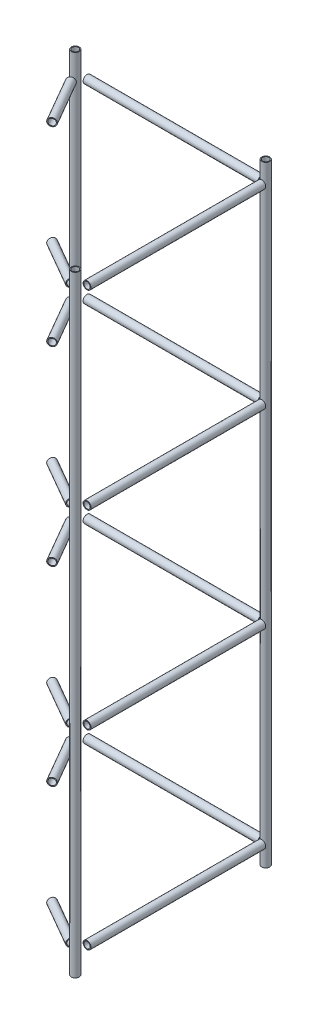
ISO-10303-21;
HEADER;
FILE_DESCRIPTION(('STEP AP214'),'2;1');
FILE_NAME('part.step','',(''),(''),'','','');
FILE_SCHEMA(('AUTOMOTIVE_DESIGN { 1 0 10303 214 1 1 1 1 }'));
ENDSEC;
DATA;
#1=APPLICATION_CONTEXT('core data for automotive mechanical design processes');
#2=APPLICATION_PROTOCOL_DEFINITION('international standard','automotive_design',2000,#1);
#3=PRODUCT_CONTEXT('',#1,'mechanical');
#4=PRODUCT('Part','Part','',(#3));
#5=PRODUCT_RELATED_PRODUCT_CATEGORY('part','',(#4));
#6=PRODUCT_DEFINITION_FORMATION('','',#4);
#7=PRODUCT_DEFINITION_CONTEXT('part definition',#1,'design');
#8=PRODUCT_DEFINITION('design','',#6,#7);
#9=PRODUCT_DEFINITION_SHAPE('','',#8);
#10=(LENGTH_UNIT() NAMED_UNIT(*) SI_UNIT(.MILLI.,.METRE.));
#11=(NAMED_UNIT(*) PLANE_ANGLE_UNIT() SI_UNIT($,.RADIAN.));
#12=(NAMED_UNIT(*) SI_UNIT($,.STERADIAN.) SOLID_ANGLE_UNIT());
#13=UNCERTAINTY_MEASURE_WITH_UNIT(LENGTH_MEASURE(1.E-05),#10,'distance_accuracy_value','');
#14=(GEOMETRIC_REPRESENTATION_CONTEXT(3) GLOBAL_UNCERTAINTY_ASSIGNED_CONTEXT((#13)) GLOBAL_UNIT_ASSIGNED_CONTEXT((#10,
#11,#12)) REPRESENTATION_CONTEXT('',''));
#15=CARTESIAN_POINT('',(0.,0.,0.));
#16=DIRECTION('',(0.,0.,1.));
#17=DIRECTION('',(1.,0.,0.));
#18=AXIS2_PLACEMENT_3D('',#15,#16,#17);
#19=CARTESIAN_POINT('',(-87.8122046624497,641.350000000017,254.1016));
#20=DIRECTION('',(0.866025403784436,-1.66429216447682E-13,0.500000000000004));
#21=DIRECTION('',(0.500000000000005,0.,-0.866025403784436));
#22=AXIS2_PLACEMENT_3D('',#19,#20,#21);
#23=CYLINDRICAL_SURFACE('',#22,5.08);
#24=CARTESIAN_POINT('',(-87.8122046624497,641.350000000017,254.1016));
#25=DIRECTION('',(-0.866025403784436,1.66429216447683E-13,-0.500000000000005));
#26=DIRECTION('',(-2.88263858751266E-13,-1.,1.66429216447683E-13));
#27=AXIS2_PLACEMENT_3D('',#24,#25,#26);
#28=CIRCLE('',#27,5.08);
#29=CARTESIAN_POINT('',(-87.8122046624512,636.270000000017,254.1016));
#30=VERTEX_POINT('',#29);
#31=EDGE_CURVE('E57',#30,#30,#28,.T.);
#32=ORIENTED_EDGE('',*,*,#31,.T.);
#33=EDGE_LOOP('',(#32));
#34=FACE_BOUND('',#33,.T.);
#35=CARTESIAN_POINT('',(-16.3132067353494,641.350000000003,295.3815657));
#36=DIRECTION('',(0.866025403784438,0.,0.5));
#37=DIRECTION('',(0.5,0.,-0.866025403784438));
#38=AXIS2_PLACEMENT_3D('',#35,#36,#37);
#39=CIRCLE('',#38,5.08);
#40=CARTESIAN_POINT('',(-13.7732067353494,641.350000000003,290.982156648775));
#41=VERTEX_POINT('',#40);
#42=EDGE_CURVE('E62',#41,#41,#39,.T.);
#43=ORIENTED_EDGE('',*,*,#42,.T.);
#44=EDGE_LOOP('',(#43));
#45=FACE_BOUND('',#44,.T.);
#46=ADVANCED_FACE('F46',(#34,#45),#23,.F.);
#47=CARTESIAN_POINT('',(-87.8122046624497,641.350000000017,254.1016));
#48=DIRECTION('',(0.866025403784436,-1.66429216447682E-13,0.500000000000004));
#49=DIRECTION('',(0.500000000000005,0.,-0.866025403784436));
#50=AXIS2_PLACEMENT_3D('',#47,#48,#49);
#51=CYLINDRICAL_SURFACE('',#50,6.35);
#52=CARTESIAN_POINT('',(-87.8122046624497,641.350000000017,254.1016));
#53=DIRECTION('',(-0.866025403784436,1.66429216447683E-13,-0.500000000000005));
#54=DIRECTION('',(-2.88263858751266E-13,-1.,1.66429216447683E-13));
#55=AXIS2_PLACEMENT_3D('',#52,#53,#54);
#56=CIRCLE('',#55,6.35);
#57=CARTESIAN_POINT('',(-87.8122046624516,635.000000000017,254.101600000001));
#58=VERTEX_POINT('',#57);
#59=EDGE_CURVE('E53',#58,#58,#56,.T.);
#60=ORIENTED_EDGE('',*,*,#59,.F.);
#61=EDGE_LOOP('',(#60));
#62=FACE_BOUND('',#61,.T.);
#63=CARTESIAN_POINT('',(-16.3132067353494,641.350000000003,295.3815657));
#64=DIRECTION('',(0.866025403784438,0.,0.5));
#65=DIRECTION('',(0.5,0.,-0.866025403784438));
#66=AXIS2_PLACEMENT_3D('',#63,#64,#65);
#67=CIRCLE('',#66,6.35);
#68=CARTESIAN_POINT('',(-13.1382067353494,641.350000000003,289.882304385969));
#69=VERTEX_POINT('',#68);
#70=EDGE_CURVE('E12',#69,#69,#67,.T.);
#71=ORIENTED_EDGE('',*,*,#70,.F.);
#72=EDGE_LOOP('',(#71));
#73=FACE_BOUND('',#72,.T.);
#74=ADVANCED_FACE('F48',(#62,#73),#51,.T.);
#75=CARTESIAN_POINT('',(-87.8122046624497,641.350000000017,254.1016));
#76=DIRECTION('',(-0.866025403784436,1.66429216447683E-13,-0.500000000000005));
#77=DIRECTION('',(-2.88263858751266E-13,-1.,1.66429216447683E-13));
#78=AXIS2_PLACEMENT_3D('',#75,#76,#77);
#79=PLANE('',#78);
#80=ORIENTED_EDGE('',*,*,#31,.F.);
#81=EDGE_LOOP('',(#80));
#82=FACE_BOUND('',#81,.T.);
#83=ORIENTED_EDGE('',*,*,#59,.T.);
#84=EDGE_LOOP('',(#83));
#85=FACE_BOUND('',#84,.T.);
#86=ADVANCED_FACE('F70',(#82,#85),#79,.T.);
#87=CARTESIAN_POINT('',(-10.8754711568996,2567.44755264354,285.9631314));
#88=DIRECTION('',(0.866025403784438,0.,0.5));
#89=DIRECTION('',(0.5,0.,-0.866025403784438));
#90=AXIS2_PLACEMENT_3D('',#87,#88,#89);
#91=PLANE('',#90);
#92=ORIENTED_EDGE('',*,*,#42,.F.);
#93=EDGE_LOOP('',(#92));
#94=FACE_BOUND('',#93,.T.);
#95=ORIENTED_EDGE('',*,*,#70,.T.);
#96=EDGE_LOOP('',(#95));
#97=FACE_BOUND('',#96,.T.);
#98=ADVANCED_FACE('F68',(#94,#97),#91,.T.);
#99=CLOSED_SHELL('',(#46,#74,#86,#98));
#100=MANIFOLD_SOLID_BREP('B2',#99);
#101=CARTESIAN_POINT('',(0.,641.35,304.8));
#102=DIRECTION('',(0.,0.,-1.));
#103=DIRECTION('',(-1.,0.,0.));
#104=AXIS2_PLACEMENT_3D('',#101,#102,#103);
#105=CYLINDRICAL_SURFACE('',#104,5.08);
#106=CARTESIAN_POINT('',(0.,641.35,6.35000000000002));
#107=DIRECTION('',(0.,0.,-1.));
#108=DIRECTION('',(-1.,0.,0.));
#109=AXIS2_PLACEMENT_3D('',#106,#107,#108);
#110=CIRCLE('',#109,5.08);
#111=CARTESIAN_POINT('',(-5.08,641.35,6.35000000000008));
#112=VERTEX_POINT('',#111);
#113=EDGE_CURVE('E132',#112,#112,#110,.T.);
#114=CARTESIAN_POINT('',(0.,641.35,285.9631314));
#115=DIRECTION('',(0.,0.,1.));
#116=DIRECTION('',(1.,0.,0.));
#117=AXIS2_PLACEMENT_3D('',#114,#115,#116);
#118=CIRCLE('',#117,5.08);
#119=CARTESIAN_POINT('',(-5.08,641.35,285.9631314));
#120=VERTEX_POINT('',#119);
#121=EDGE_CURVE('E136',#120,#120,#118,.T.);
#122=CARTESIAN_POINT('',(-5.08,641.35,6.35000000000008));
#123=CARTESIAN_POINT('',(-5.08,641.35,9.26263678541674));
#124=CARTESIAN_POINT('',(-5.08,641.35,12.1752735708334));
#125=CARTESIAN_POINT('',(-5.08,641.35,18.0005471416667));
#126=CARTESIAN_POINT('',(-5.08,641.35,20.9131839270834));
#127=CARTESIAN_POINT('',(-5.08,641.35,26.7384574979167));
#128=CARTESIAN_POINT('',(-5.08,641.35,29.6510942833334));
#129=CARTESIAN_POINT('',(-5.08,641.35,35.4763678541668));
#130=CARTESIAN_POINT('',(-5.08,641.35,38.3890046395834));
#131=CARTESIAN_POINT('',(-5.08,641.35,44.2142782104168));
#132=CARTESIAN_POINT('',(-5.08,641.35,47.1269149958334));
#133=CARTESIAN_POINT('',(-5.08,641.35,52.9521885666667));
#134=CARTESIAN_POINT('',(-5.08,641.35,55.8648253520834));
#135=CARTESIAN_POINT('',(-5.08,641.35,61.6900989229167));
#136=CARTESIAN_POINT('',(-5.08,641.35,64.6027357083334));
#137=CARTESIAN_POINT('',(-5.08,641.35,70.4280092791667));
#138=CARTESIAN_POINT('',(-5.08,641.35,73.3406460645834));
#139=CARTESIAN_POINT('',(-5.08,641.35,79.1659196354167));
#140=CARTESIAN_POINT('',(-5.08,641.35,82.0785564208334));
#141=CARTESIAN_POINT('',(-5.08,641.35,87.9038299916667));
#142=CARTESIAN_POINT('',(-5.08,641.35,90.8164667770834));
#143=CARTESIAN_POINT('',(-5.08,641.35,96.6417403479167));
#144=CARTESIAN_POINT('',(-5.08,641.35,99.5543771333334));
#145=CARTESIAN_POINT('',(-5.08,641.35,105.379650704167));
#146=CARTESIAN_POINT('',(-5.08,641.35,108.292287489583));
#147=CARTESIAN_POINT('',(-5.08,641.35,114.117561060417));
#148=CARTESIAN_POINT('',(-5.08,641.35,117.030197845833));
#149=CARTESIAN_POINT('',(-5.08,641.35,122.855471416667));
#150=CARTESIAN_POINT('',(-5.08,641.35,125.768108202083));
#151=CARTESIAN_POINT('',(-5.08,641.35,131.593381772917));
#152=CARTESIAN_POINT('',(-5.08,641.35,134.506018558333));
#153=CARTESIAN_POINT('',(-5.08,641.35,140.331292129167));
#154=CARTESIAN_POINT('',(-5.08,641.35,143.243928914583));
#155=CARTESIAN_POINT('',(-5.08,641.35,149.069202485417));
#156=CARTESIAN_POINT('',(-5.08,641.35,151.981839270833));
#157=CARTESIAN_POINT('',(-5.08,641.35,157.807112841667));
#158=CARTESIAN_POINT('',(-5.08,641.35,160.719749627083));
#159=CARTESIAN_POINT('',(-5.08,641.35,166.545023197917));
#160=CARTESIAN_POINT('',(-5.08,641.35,169.457659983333));
#161=CARTESIAN_POINT('',(-5.08,641.35,175.282933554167));
#162=CARTESIAN_POINT('',(-5.08,641.35,178.195570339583));
#163=CARTESIAN_POINT('',(-5.08,641.35,184.020843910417));
#164=CARTESIAN_POINT('',(-5.08,641.35,186.933480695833));
#165=CARTESIAN_POINT('',(-5.08,641.35,192.758754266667));
#166=CARTESIAN_POINT('',(-5.08,641.35,195.671391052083));
#167=CARTESIAN_POINT('',(-5.08,641.35,201.496664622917));
#168=CARTESIAN_POINT('',(-5.08,641.35,204.409301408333));
#169=CARTESIAN_POINT('',(-5.08,641.35,210.234574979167));
#170=CARTESIAN_POINT('',(-5.08,641.35,213.147211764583));
#171=CARTESIAN_POINT('',(-5.08,641.35,218.972485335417));
#172=CARTESIAN_POINT('',(-5.08,641.35,221.885122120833));
#173=CARTESIAN_POINT('',(-5.08,641.35,227.710395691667));
#174=CARTESIAN_POINT('',(-5.08,641.35,230.623032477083));
#175=CARTESIAN_POINT('',(-5.08,641.35,236.448306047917));
#176=CARTESIAN_POINT('',(-5.08,641.35,239.360942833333));
#177=CARTESIAN_POINT('',(-5.08,641.35,245.186216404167));
#178=CARTESIAN_POINT('',(-5.08,641.35,248.098853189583));
#179=CARTESIAN_POINT('',(-5.08,641.35,253.924126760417));
#180=CARTESIAN_POINT('',(-5.08,641.35,256.836763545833));
#181=CARTESIAN_POINT('',(-5.08,641.35,262.662037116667));
#182=CARTESIAN_POINT('',(-5.08,641.35,265.574673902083));
#183=CARTESIAN_POINT('',(-5.08,641.35,271.399947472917));
#184=CARTESIAN_POINT('',(-5.08,641.35,274.312584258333));
#185=CARTESIAN_POINT('',(-5.08,641.35,280.137857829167));
#186=CARTESIAN_POINT('',(-5.08,641.35,283.050494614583));
#187=CARTESIAN_POINT('',(-5.08,641.35,285.9631314));
#188=B_SPLINE_CURVE_WITH_KNOTS('',3,(#122,#123,#124,#125,#126,#127,#128,#129,#130,#131,#132,
#133,#134,#135,#136,#137,#138,#139,#140,#141,#142,#143,#144,#145,#146,#147,#148,#149,#150,#151,
#152,#153,#154,#155,#156,#157,#158,#159,#160,#161,#162,#163,#164,#165,#166,#167,#168,#169,#170,
#171,#172,#173,#174,#175,#176,#177,#178,#179,#180,#181,#182,#183,#184,#185,#186,#187),
.UNSPECIFIED.,.F.,.F.,(4,2,2,2,2,2,2,2,2,2,2,2,2,2,2,2,2,2,2,2,2,2,2,2,2,2,2,2,2,2,2,2,4),(0.,
8.73791035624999,17.4758207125,26.21373106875,34.951641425,43.68955178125,52.4274621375,
61.16537249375,69.90328285,78.64119320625,87.3791035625,96.11701391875,104.854924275,
113.59283463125,122.3307449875,131.06865534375,139.8065657,148.54447605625,157.2823864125,
166.02029676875,174.758207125,183.49611748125,192.2340278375,200.97193819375,209.70984855,
218.44775890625,227.1856692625,235.92357961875,244.661489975,253.39940033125,262.1373106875,
270.87522104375,279.6131314),.UNSPECIFIED.);
#189=EDGE_CURVE('BSEAM121',#112,#120,#188,.T.);
#190=ORIENTED_EDGE('',*,*,#113,.T.);
#191=ORIENTED_EDGE('',*,*,#121,.T.);
#192=ORIENTED_EDGE('',*,*,#189,.T.);
#193=ORIENTED_EDGE('',*,*,#189,.F.);
#194=EDGE_LOOP('',(#190,#192,#191,#193));
#195=FACE_BOUND('',#194,.T.);
#196=ADVANCED_FACE('F121',(#195),#105,.F.);
#197=CARTESIAN_POINT('',(0.,641.35,304.8));
#198=DIRECTION('',(0.,0.,-1.));
#199=DIRECTION('',(-1.,0.,0.));
#200=AXIS2_PLACEMENT_3D('',#197,#198,#199);
#201=CYLINDRICAL_SURFACE('',#200,6.35);
#202=CARTESIAN_POINT('',(0.,641.35,6.35000000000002));
#203=DIRECTION('',(0.,0.,-1.));
#204=DIRECTION('',(-1.,0.,0.));
#205=AXIS2_PLACEMENT_3D('',#202,#203,#204);
#206=CIRCLE('',#205,6.35);
#207=CARTESIAN_POINT('',(-6.35,641.35,6.35000000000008));
#208=VERTEX_POINT('',#207);
#209=EDGE_CURVE('E128',#208,#208,#206,.T.);
#210=CARTESIAN_POINT('',(0.,641.35,285.9631314));
#211=DIRECTION('',(0.,0.,1.));
#212=DIRECTION('',(1.,0.,0.));
#213=AXIS2_PLACEMENT_3D('',#210,#211,#212);
#214=CIRCLE('',#213,6.35);
#215=CARTESIAN_POINT('',(-6.35,641.35,285.9631314));
#216=VERTEX_POINT('',#215);
#217=EDGE_CURVE('E45',#216,#216,#214,.T.);
#218=CARTESIAN_POINT('',(-6.35,641.35,6.35000000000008));
#219=CARTESIAN_POINT('',(-6.35,641.35,9.26263678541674));
#220=CARTESIAN_POINT('',(-6.35,641.35,12.1752735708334));
#221=CARTESIAN_POINT('',(-6.35,641.35,18.0005471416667));
#222=CARTESIAN_POINT('',(-6.35,641.35,20.9131839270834));
#223=CARTESIAN_POINT('',(-6.35,641.35,26.7384574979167));
#224=CARTESIAN_POINT('',(-6.35,641.35,29.6510942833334));
#225=CARTESIAN_POINT('',(-6.35,641.35,35.4763678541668));
#226=CARTESIAN_POINT('',(-6.35,641.35,38.3890046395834));
#227=CARTESIAN_POINT('',(-6.35,641.35,44.2142782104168));
#228=CARTESIAN_POINT('',(-6.35,641.35,47.1269149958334));
#229=CARTESIAN_POINT('',(-6.35,641.35,52.9521885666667));
#230=CARTESIAN_POINT('',(-6.35,641.35,55.8648253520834));
#231=CARTESIAN_POINT('',(-6.35,641.35,61.6900989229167));
#232=CARTESIAN_POINT('',(-6.35,641.35,64.6027357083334));
#233=CARTESIAN_POINT('',(-6.35,641.35,70.4280092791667));
#234=CARTESIAN_POINT('',(-6.35,641.35,73.3406460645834));
#235=CARTESIAN_POINT('',(-6.35,641.35,79.1659196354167));
#236=CARTESIAN_POINT('',(-6.35,641.35,82.0785564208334));
#237=CARTESIAN_POINT('',(-6.35,641.35,87.9038299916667));
#238=CARTESIAN_POINT('',(-6.35,641.35,90.8164667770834));
#239=CARTESIAN_POINT('',(-6.35,641.35,96.6417403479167));
#240=CARTESIAN_POINT('',(-6.35,641.35,99.5543771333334));
#241=CARTESIAN_POINT('',(-6.35,641.35,105.379650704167));
#242=CARTESIAN_POINT('',(-6.35,641.35,108.292287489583));
#243=CARTESIAN_POINT('',(-6.35,641.35,114.117561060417));
#244=CARTESIAN_POINT('',(-6.35,641.35,117.030197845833));
#245=CARTESIAN_POINT('',(-6.35,641.35,122.855471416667));
#246=CARTESIAN_POINT('',(-6.35,641.35,125.768108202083));
#247=CARTESIAN_POINT('',(-6.35,641.35,131.593381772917));
#248=CARTESIAN_POINT('',(-6.35,641.35,134.506018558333));
#249=CARTESIAN_POINT('',(-6.35,641.35,140.331292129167));
#250=CARTESIAN_POINT('',(-6.35,641.35,143.243928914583));
#251=CARTESIAN_POINT('',(-6.35,641.35,149.069202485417));
#252=CARTESIAN_POINT('',(-6.35,641.35,151.981839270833));
#253=CARTESIAN_POINT('',(-6.35,641.35,157.807112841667));
#254=CARTESIAN_POINT('',(-6.35,641.35,160.719749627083));
#255=CARTESIAN_POINT('',(-6.35,641.35,166.545023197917));
#256=CARTESIAN_POINT('',(-6.35,641.35,169.457659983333));
#257=CARTESIAN_POINT('',(-6.35,641.35,175.282933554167));
#258=CARTESIAN_POINT('',(-6.35,641.35,178.195570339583));
#259=CARTESIAN_POINT('',(-6.35,641.35,184.020843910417));
#260=CARTESIAN_POINT('',(-6.35,641.35,186.933480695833));
#261=CARTESIAN_POINT('',(-6.35,641.35,192.758754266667));
#262=CARTESIAN_POINT('',(-6.35,641.35,195.671391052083));
#263=CARTESIAN_POINT('',(-6.35,641.35,201.496664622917));
#264=CARTESIAN_POINT('',(-6.35,641.35,204.409301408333));
#265=CARTESIAN_POINT('',(-6.35,641.35,210.234574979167));
#266=CARTESIAN_POINT('',(-6.35,641.35,213.147211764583));
#267=CARTESIAN_POINT('',(-6.35,641.35,218.972485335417));
#268=CARTESIAN_POINT('',(-6.35,641.35,221.885122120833));
#269=CARTESIAN_POINT('',(-6.35,641.35,227.710395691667));
#270=CARTESIAN_POINT('',(-6.35,641.35,230.623032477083));
#271=CARTESIAN_POINT('',(-6.35,641.35,236.448306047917));
#272=CARTESIAN_POINT('',(-6.35,641.35,239.360942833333));
#273=CARTESIAN_POINT('',(-6.35,641.35,245.186216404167));
#274=CARTESIAN_POINT('',(-6.35,641.35,248.098853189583));
#275=CARTESIAN_POINT('',(-6.35,641.35,253.924126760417));
#276=CARTESIAN_POINT('',(-6.35,641.35,256.836763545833));
#277=CARTESIAN_POINT('',(-6.35,641.35,262.662037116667));
#278=CARTESIAN_POINT('',(-6.35,641.35,265.574673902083));
#279=CARTESIAN_POINT('',(-6.35,641.35,271.399947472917));
#280=CARTESIAN_POINT('',(-6.35,641.35,274.312584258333));
#281=CARTESIAN_POINT('',(-6.35,641.35,280.137857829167));
#282=CARTESIAN_POINT('',(-6.35,641.35,283.050494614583));
#283=CARTESIAN_POINT('',(-6.35,641.35,285.9631314));
#284=B_SPLINE_CURVE_WITH_KNOTS('',3,(#218,#219,#220,#221,#222,#223,#224,#225,#226,#227,#228,
#229,#230,#231,#232,#233,#234,#235,#236,#237,#238,#239,#240,#241,#242,#243,#244,#245,#246,#247,
#248,#249,#250,#251,#252,#253,#254,#255,#256,#257,#258,#259,#260,#261,#262,#263,#264,#265,#266,
#267,#268,#269,#270,#271,#272,#273,#274,#275,#276,#277,#278,#279,#280,#281,#282,#283),
.UNSPECIFIED.,.F.,.F.,(4,2,2,2,2,2,2,2,2,2,2,2,2,2,2,2,2,2,2,2,2,2,2,2,2,2,2,2,2,2,2,2,4),(0.,
8.73791035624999,17.4758207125,26.21373106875,34.951641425,43.68955178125,52.4274621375,
61.16537249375,69.90328285,78.64119320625,87.3791035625,96.11701391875,104.854924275,
113.59283463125,122.3307449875,131.06865534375,139.8065657,148.54447605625,157.2823864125,
166.02029676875,174.758207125,183.49611748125,192.2340278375,200.97193819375,209.70984855,
218.44775890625,227.1856692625,235.92357961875,244.661489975,253.39940033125,262.1373106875,
270.87522104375,279.6131314),.UNSPECIFIED.);
#285=EDGE_CURVE('BSEAM123',#208,#216,#284,.T.);
#286=ORIENTED_EDGE('',*,*,#209,.F.);
#287=ORIENTED_EDGE('',*,*,#217,.F.);
#288=ORIENTED_EDGE('',*,*,#285,.T.);
#289=ORIENTED_EDGE('',*,*,#285,.F.);
#290=EDGE_LOOP('',(#286,#288,#287,#289));
#291=FACE_BOUND('',#290,.T.);
#292=ADVANCED_FACE('F123',(#291),#201,.T.);
#293=CARTESIAN_POINT('',(-6.35,2567.44755264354,6.35));
#294=DIRECTION('',(0.,0.,-1.));
#295=DIRECTION('',(-1.,0.,0.));
#296=AXIS2_PLACEMENT_3D('',#293,#294,#295);
#297=PLANE('',#296);
#298=ORIENTED_EDGE('',*,*,#113,.F.);
#299=EDGE_LOOP('',(#298));
#300=FACE_BOUND('',#299,.T.);
#301=ORIENTED_EDGE('',*,*,#209,.T.);
#302=EDGE_LOOP('',(#301));
#303=FACE_BOUND('',#302,.T.);
#304=ADVANCED_FACE('F145',(#300,#303),#297,.T.);
#305=CARTESIAN_POINT('',(-10.8754711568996,2567.44755264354,285.9631314));
#306=DIRECTION('',(0.,0.,1.));
#307=DIRECTION('',(1.,0.,0.));
#308=AXIS2_PLACEMENT_3D('',#305,#306,#307);
#309=PLANE('',#308);
#310=ORIENTED_EDGE('',*,*,#121,.F.);
#311=EDGE_LOOP('',(#310));
#312=FACE_BOUND('',#311,.T.);
#313=ORIENTED_EDGE('',*,*,#217,.T.);
#314=EDGE_LOOP('',(#313));
#315=FACE_BOUND('',#314,.T.);
#316=ADVANCED_FACE('F143',(#312,#315),#309,.T.);
#317=CLOSED_SHELL('',(#196,#292,#304,#316));
#318=MANIFOLD_SOLID_BREP('B7',#317);
#319=CARTESIAN_POINT('',(-6.35,2567.44755264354,-44.45));
#320=DIRECTION('',(1.,0.,0.));
#321=DIRECTION('',(0.,0.,-1.));
#322=AXIS2_PLACEMENT_3D('',#319,#320,#321);
#323=PLANE('',#322);
#324=CARTESIAN_POINT('',(-6.35000000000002,641.35,0.));
#325=DIRECTION('',(1.,0.,0.));
#326=DIRECTION('',(0.,0.,-1.));
#327=AXIS2_PLACEMENT_3D('',#324,#325,#326);
#328=CIRCLE('',#327,6.35);
#329=CARTESIAN_POINT('',(-6.35000000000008,641.35,-6.35));
#330=VERTEX_POINT('',#329);
#331=EDGE_CURVE('E209',#330,#330,#328,.T.);
#332=ORIENTED_EDGE('',*,*,#331,.T.);
#333=EDGE_LOOP('',(#332));
#334=FACE_BOUND('',#333,.T.);
#335=CARTESIAN_POINT('',(-6.35000000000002,641.35,0.));
#336=DIRECTION('',(1.,0.,0.));
#337=DIRECTION('',(0.,0.,-1.));
#338=AXIS2_PLACEMENT_3D('',#335,#336,#337);
#339=CIRCLE('',#338,5.08);
#340=CARTESIAN_POINT('',(-6.35000000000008,641.35,-5.08));
#341=VERTEX_POINT('',#340);
#342=EDGE_CURVE('E205',#341,#341,#339,.T.);
#343=ORIENTED_EDGE('',*,*,#342,.F.);
#344=EDGE_LOOP('',(#343));
#345=FACE_BOUND('',#344,.T.);
#346=ADVANCED_FACE('F194',(#334,#345),#323,.T.);
#347=CARTESIAN_POINT('',(-304.8,641.35,0.));
#348=DIRECTION('',(1.,0.,0.));
#349=DIRECTION('',(0.,0.,-1.));
#350=AXIS2_PLACEMENT_3D('',#347,#348,#349);
#351=CYLINDRICAL_SURFACE('',#350,5.08);
#352=CARTESIAN_POINT('',(-285.9631314,641.35,0.));
#353=DIRECTION('',(-1.,0.,0.));
#354=DIRECTION('',(0.,0.,1.));
#355=AXIS2_PLACEMENT_3D('',#352,#353,#354);
#356=CIRCLE('',#355,5.08);
#357=CARTESIAN_POINT('',(-285.9631314,641.35,-5.08));
#358=VERTEX_POINT('',#357);
#359=EDGE_CURVE('E201',#358,#358,#356,.T.);
#360=CARTESIAN_POINT('',(-285.9631314,641.35,-5.08));
#361=CARTESIAN_POINT('',(-283.050494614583,641.35,-5.08));
#362=CARTESIAN_POINT('',(-280.137857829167,641.35,-5.08));
#363=CARTESIAN_POINT('',(-274.312584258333,641.35,-5.08));
#364=CARTESIAN_POINT('',(-271.399947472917,641.35,-5.08));
#365=CARTESIAN_POINT('',(-265.574673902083,641.35,-5.08));
#366=CARTESIAN_POINT('',(-262.662037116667,641.35,-5.08));
#367=CARTESIAN_POINT('',(-256.836763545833,641.35,-5.08));
#368=CARTESIAN_POINT('',(-253.924126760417,641.35,-5.08));
#369=CARTESIAN_POINT('',(-248.098853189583,641.35,-5.08));
#370=CARTESIAN_POINT('',(-245.186216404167,641.35,-5.08));
#371=CARTESIAN_POINT('',(-239.360942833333,641.35,-5.08));
#372=CARTESIAN_POINT('',(-236.448306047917,641.35,-5.08));
#373=CARTESIAN_POINT('',(-230.623032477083,641.35,-5.08));
#374=CARTESIAN_POINT('',(-227.710395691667,641.35,-5.08));
#375=CARTESIAN_POINT('',(-221.885122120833,641.35,-5.08));
#376=CARTESIAN_POINT('',(-218.972485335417,641.35,-5.08));
#377=CARTESIAN_POINT('',(-213.147211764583,641.35,-5.08));
#378=CARTESIAN_POINT('',(-210.234574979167,641.35,-5.08));
#379=CARTESIAN_POINT('',(-204.409301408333,641.35,-5.08));
#380=CARTESIAN_POINT('',(-201.496664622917,641.35,-5.08));
#381=CARTESIAN_POINT('',(-195.671391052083,641.35,-5.08));
#382=CARTESIAN_POINT('',(-192.758754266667,641.35,-5.08));
#383=CARTESIAN_POINT('',(-186.933480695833,641.35,-5.08));
#384=CARTESIAN_POINT('',(-184.020843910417,641.35,-5.08));
#385=CARTESIAN_POINT('',(-178.195570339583,641.35,-5.08));
#386=CARTESIAN_POINT('',(-175.282933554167,641.35,-5.08));
#387=CARTESIAN_POINT('',(-169.457659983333,641.35,-5.08));
#388=CARTESIAN_POINT('',(-166.545023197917,641.35,-5.08));
#389=CARTESIAN_POINT('',(-160.719749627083,641.35,-5.08));
#390=CARTESIAN_POINT('',(-157.807112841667,641.35,-5.08));
#391=CARTESIAN_POINT('',(-151.981839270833,641.35,-5.08));
#392=CARTESIAN_POINT('',(-149.069202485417,641.35,-5.08));
#393=CARTESIAN_POINT('',(-143.243928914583,641.35,-5.08));
#394=CARTESIAN_POINT('',(-140.331292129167,641.35,-5.08));
#395=CARTESIAN_POINT('',(-134.506018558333,641.35,-5.08));
#396=CARTESIAN_POINT('',(-131.593381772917,641.35,-5.08));
#397=CARTESIAN_POINT('',(-125.768108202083,641.35,-5.08));
#398=CARTESIAN_POINT('',(-122.855471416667,641.35,-5.08));
#399=CARTESIAN_POINT('',(-117.030197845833,641.35,-5.08));
#400=CARTESIAN_POINT('',(-114.117561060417,641.35,-5.08));
#401=CARTESIAN_POINT('',(-108.292287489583,641.35,-5.08));
#402=CARTESIAN_POINT('',(-105.379650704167,641.35,-5.08));
#403=CARTESIAN_POINT('',(-99.5543771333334,641.35,-5.08));
#404=CARTESIAN_POINT('',(-96.6417403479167,641.35,-5.08));
#405=CARTESIAN_POINT('',(-90.8164667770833,641.35,-5.08));
#406=CARTESIAN_POINT('',(-87.9038299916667,641.35,-5.08));
#407=CARTESIAN_POINT('',(-82.0785564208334,641.35,-5.08));
#408=CARTESIAN_POINT('',(-79.1659196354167,641.35,-5.08));
#409=CARTESIAN_POINT('',(-73.3406460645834,641.35,-5.08));
#410=CARTESIAN_POINT('',(-70.4280092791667,641.35,-5.08));
#411=CARTESIAN_POINT('',(-64.6027357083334,641.35,-5.08));
#412=CARTESIAN_POINT('',(-61.6900989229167,641.35,-5.08));
#413=CARTESIAN_POINT('',(-55.8648253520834,641.35,-5.08));
#414=CARTESIAN_POINT('',(-52.9521885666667,641.35,-5.08));
#415=CARTESIAN_POINT('',(-47.1269149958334,641.35,-5.08));
#416=CARTESIAN_POINT('',(-44.2142782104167,641.35,-5.08));
#417=CARTESIAN_POINT('',(-38.3890046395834,641.35,-5.08));
#418=CARTESIAN_POINT('',(-35.4763678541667,641.35,-5.08));
#419=CARTESIAN_POINT('',(-29.6510942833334,641.35,-5.08));
#420=CARTESIAN_POINT('',(-26.7384574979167,641.35,-5.08));
#421=CARTESIAN_POINT('',(-20.9131839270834,641.35,-5.08));
#422=CARTESIAN_POINT('',(-18.0005471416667,641.35,-5.08));
#423=CARTESIAN_POINT('',(-12.1752735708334,641.35,-5.08));
#424=CARTESIAN_POINT('',(-9.26263678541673,641.35,-5.08));
#425=CARTESIAN_POINT('',(-6.35000000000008,641.35,-5.08));
#426=B_SPLINE_CURVE_WITH_KNOTS('',3,(#360,#361,#362,#363,#364,#365,#366,#367,#368,#369,#370,
#371,#372,#373,#374,#375,#376,#377,#378,#379,#380,#381,#382,#383,#384,#385,#386,#387,#388,#389,
#390,#391,#392,#393,#394,#395,#396,#397,#398,#399,#400,#401,#402,#403,#404,#405,#406,#407,#408,
#409,#410,#411,#412,#413,#414,#415,#416,#417,#418,#419,#420,#421,#422,#423,#424,#425),
.UNSPECIFIED.,.F.,.F.,(4,2,2,2,2,2,2,2,2,2,2,2,2,2,2,2,2,2,2,2,2,2,2,2,2,2,2,2,2,2,2,2,4),(0.,
8.73791035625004,17.4758207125,26.21373106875,34.951641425,43.68955178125,52.4274621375,
61.16537249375,69.90328285,78.64119320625,87.3791035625,96.11701391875,104.854924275,
113.59283463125,122.3307449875,131.06865534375,139.8065657,148.54447605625,157.2823864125,
166.02029676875,174.758207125,183.49611748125,192.2340278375,200.97193819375,209.70984855,
218.44775890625,227.1856692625,235.92357961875,244.661489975,253.39940033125,262.1373106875,
270.87522104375,279.6131314),.UNSPECIFIED.);
#427=EDGE_CURVE('BSEAM219',#358,#341,#426,.T.);
#428=ORIENTED_EDGE('',*,*,#359,.T.);
#429=ORIENTED_EDGE('',*,*,#342,.T.);
#430=ORIENTED_EDGE('',*,*,#427,.T.);
#431=ORIENTED_EDGE('',*,*,#427,.F.);
#432=EDGE_LOOP('',(#428,#430,#429,#431));
#433=FACE_BOUND('',#432,.T.);
#434=ADVANCED_FACE('F219',(#433),#351,.F.);
#435=CARTESIAN_POINT('',(-304.8,641.35,0.));
#436=DIRECTION('',(1.,0.,0.));
#437=DIRECTION('',(0.,0.,-1.));
#438=AXIS2_PLACEMENT_3D('',#435,#436,#437);
#439=CYLINDRICAL_SURFACE('',#438,6.35);
#440=CARTESIAN_POINT('',(-285.9631314,641.35,0.));
#441=DIRECTION('',(-1.,0.,0.));
#442=DIRECTION('',(0.,0.,1.));
#443=AXIS2_PLACEMENT_3D('',#440,#441,#442);
#444=CIRCLE('',#443,6.35);
#445=CARTESIAN_POINT('',(-285.9631314,641.35,-6.35));
#446=VERTEX_POINT('',#445);
#447=EDGE_CURVE('E120',#446,#446,#444,.T.);
#448=CARTESIAN_POINT('',(-285.9631314,641.35,-6.35));
#449=CARTESIAN_POINT('',(-283.050494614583,641.35,-6.35));
#450=CARTESIAN_POINT('',(-280.137857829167,641.35,-6.35));
#451=CARTESIAN_POINT('',(-274.312584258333,641.35,-6.35));
#452=CARTESIAN_POINT('',(-271.399947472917,641.35,-6.35));
#453=CARTESIAN_POINT('',(-265.574673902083,641.35,-6.35));
#454=CARTESIAN_POINT('',(-262.662037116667,641.35,-6.35));
#455=CARTESIAN_POINT('',(-256.836763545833,641.35,-6.35));
#456=CARTESIAN_POINT('',(-253.924126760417,641.35,-6.35));
#457=CARTESIAN_POINT('',(-248.098853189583,641.35,-6.35));
#458=CARTESIAN_POINT('',(-245.186216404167,641.35,-6.35));
#459=CARTESIAN_POINT('',(-239.360942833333,641.35,-6.35));
#460=CARTESIAN_POINT('',(-236.448306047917,641.35,-6.35));
#461=CARTESIAN_POINT('',(-230.623032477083,641.35,-6.35));
#462=CARTESIAN_POINT('',(-227.710395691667,641.35,-6.35));
#463=CARTESIAN_POINT('',(-221.885122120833,641.35,-6.35));
#464=CARTESIAN_POINT('',(-218.972485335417,641.35,-6.35));
#465=CARTESIAN_POINT('',(-213.147211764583,641.35,-6.35));
#466=CARTESIAN_POINT('',(-210.234574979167,641.35,-6.35));
#467=CARTESIAN_POINT('',(-204.409301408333,641.35,-6.35));
#468=CARTESIAN_POINT('',(-201.496664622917,641.35,-6.35));
#469=CARTESIAN_POINT('',(-195.671391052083,641.35,-6.35));
#470=CARTESIAN_POINT('',(-192.758754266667,641.35,-6.35));
#471=CARTESIAN_POINT('',(-186.933480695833,641.35,-6.35));
#472=CARTESIAN_POINT('',(-184.020843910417,641.35,-6.35));
#473=CARTESIAN_POINT('',(-178.195570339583,641.35,-6.35));
#474=CARTESIAN_POINT('',(-175.282933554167,641.35,-6.35));
#475=CARTESIAN_POINT('',(-169.457659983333,641.35,-6.35));
#476=CARTESIAN_POINT('',(-166.545023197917,641.35,-6.35));
#477=CARTESIAN_POINT('',(-160.719749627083,641.35,-6.35));
#478=CARTESIAN_POINT('',(-157.807112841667,641.35,-6.35));
#479=CARTESIAN_POINT('',(-151.981839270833,641.35,-6.35));
#480=CARTESIAN_POINT('',(-149.069202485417,641.35,-6.35));
#481=CARTESIAN_POINT('',(-143.243928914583,641.35,-6.35));
#482=CARTESIAN_POINT('',(-140.331292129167,641.35,-6.35));
#483=CARTESIAN_POINT('',(-134.506018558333,641.35,-6.35));
#484=CARTESIAN_POINT('',(-131.593381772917,641.35,-6.35));
#485=CARTESIAN_POINT('',(-125.768108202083,641.35,-6.35));
#486=CARTESIAN_POINT('',(-122.855471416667,641.35,-6.35));
#487=CARTESIAN_POINT('',(-117.030197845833,641.35,-6.35));
#488=CARTESIAN_POINT('',(-114.117561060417,641.35,-6.35));
#489=CARTESIAN_POINT('',(-108.292287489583,641.35,-6.35));
#490=CARTESIAN_POINT('',(-105.379650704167,641.35,-6.35));
#491=CARTESIAN_POINT('',(-99.5543771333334,641.35,-6.35));
#492=CARTESIAN_POINT('',(-96.6417403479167,641.35,-6.35));
#493=CARTESIAN_POINT('',(-90.8164667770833,641.35,-6.35));
#494=CARTESIAN_POINT('',(-87.9038299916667,641.35,-6.35));
#495=CARTESIAN_POINT('',(-82.0785564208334,641.35,-6.35));
#496=CARTESIAN_POINT('',(-79.1659196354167,641.35,-6.35));
#497=CARTESIAN_POINT('',(-73.3406460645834,641.35,-6.35));
#498=CARTESIAN_POINT('',(-70.4280092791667,641.35,-6.35));
#499=CARTESIAN_POINT('',(-64.6027357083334,641.35,-6.35));
#500=CARTESIAN_POINT('',(-61.6900989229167,641.35,-6.35));
#501=CARTESIAN_POINT('',(-55.8648253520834,641.35,-6.35));
#502=CARTESIAN_POINT('',(-52.9521885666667,641.35,-6.35));
#503=CARTESIAN_POINT('',(-47.1269149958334,641.35,-6.35));
#504=CARTESIAN_POINT('',(-44.2142782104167,641.35,-6.35));
#505=CARTESIAN_POINT('',(-38.3890046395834,641.35,-6.35));
#506=CARTESIAN_POINT('',(-35.4763678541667,641.35,-6.35));
#507=CARTESIAN_POINT('',(-29.6510942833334,641.35,-6.35));
#508=CARTESIAN_POINT('',(-26.7384574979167,641.35,-6.35));
#509=CARTESIAN_POINT('',(-20.9131839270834,641.35,-6.35));
#510=CARTESIAN_POINT('',(-18.0005471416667,641.35,-6.35));
#511=CARTESIAN_POINT('',(-12.1752735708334,641.35,-6.35));
#512=CARTESIAN_POINT('',(-9.26263678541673,641.35,-6.35));
#513=CARTESIAN_POINT('',(-6.35000000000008,641.35,-6.35));
#514=B_SPLINE_CURVE_WITH_KNOTS('',3,(#448,#449,#450,#451,#452,#453,#454,#455,#456,#457,#458,
#459,#460,#461,#462,#463,#464,#465,#466,#467,#468,#469,#470,#471,#472,#473,#474,#475,#476,#477,
#478,#479,#480,#481,#482,#483,#484,#485,#486,#487,#488,#489,#490,#491,#492,#493,#494,#495,#496,
#497,#498,#499,#500,#501,#502,#503,#504,#505,#506,#507,#508,#509,#510,#511,#512,#513),
.UNSPECIFIED.,.F.,.F.,(4,2,2,2,2,2,2,2,2,2,2,2,2,2,2,2,2,2,2,2,2,2,2,2,2,2,2,2,2,2,2,2,4),(0.,
8.73791035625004,17.4758207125,26.21373106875,34.951641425,43.68955178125,52.4274621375,
61.16537249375,69.90328285,78.64119320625,87.3791035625,96.11701391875,104.854924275,
113.59283463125,122.3307449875,131.06865534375,139.8065657,148.54447605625,157.2823864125,
166.02029676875,174.758207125,183.49611748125,192.2340278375,200.97193819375,209.70984855,
218.44775890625,227.1856692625,235.92357961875,244.661489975,253.39940033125,262.1373106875,
270.87522104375,279.6131314),.UNSPECIFIED.);
#515=EDGE_CURVE('BSEAM196',#446,#330,#514,.T.);
#516=ORIENTED_EDGE('',*,*,#447,.F.);
#517=ORIENTED_EDGE('',*,*,#331,.F.);
#518=ORIENTED_EDGE('',*,*,#515,.T.);
#519=ORIENTED_EDGE('',*,*,#515,.F.);
#520=EDGE_LOOP('',(#516,#518,#517,#519));
#521=FACE_BOUND('',#520,.T.);
#522=ADVANCED_FACE('F196',(#521),#439,.T.);
#523=CARTESIAN_POINT('',(-285.9631314,2567.44755264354,10.8754711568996));
#524=DIRECTION('',(-1.,0.,0.));
#525=DIRECTION('',(0.,0.,1.));
#526=AXIS2_PLACEMENT_3D('',#523,#524,#525);
#527=PLANE('',#526);
#528=ORIENTED_EDGE('',*,*,#359,.F.);
#529=EDGE_LOOP('',(#528));
#530=FACE_BOUND('',#529,.T.);
#531=ORIENTED_EDGE('',*,*,#447,.T.);
#532=EDGE_LOOP('',(#531));
#533=FACE_BOUND('',#532,.T.);
#534=ADVANCED_FACE('F218',(#530,#533),#527,.T.);
#535=CLOSED_SHELL('',(#346,#434,#522,#534));
#536=MANIFOLD_SOLID_BREP('B40',#535);
#537=CARTESIAN_POINT('',(-6.35,2567.44755264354,-44.45));
#538=DIRECTION('',(1.,0.,0.));
#539=DIRECTION('',(0.,0.,-1.));
#540=AXIS2_PLACEMENT_3D('',#537,#538,#539);
#541=PLANE('',#540);
#542=CARTESIAN_POINT('',(-6.35000000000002,336.55,0.));
#543=DIRECTION('',(1.,0.,0.));
#544=DIRECTION('',(0.,0.,-1.));
#545=AXIS2_PLACEMENT_3D('',#542,#543,#544);
#546=CIRCLE('',#545,6.35);
#547=CARTESIAN_POINT('',(-6.35000000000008,336.55,-6.35));
#548=VERTEX_POINT('',#547);
#549=EDGE_CURVE('E282',#548,#548,#546,.T.);
#550=ORIENTED_EDGE('',*,*,#549,.T.);
#551=EDGE_LOOP('',(#550));
#552=FACE_BOUND('',#551,.T.);
#553=CARTESIAN_POINT('',(-6.35000000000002,336.55,0.));
#554=DIRECTION('',(1.,0.,0.));
#555=DIRECTION('',(0.,0.,-1.));
#556=AXIS2_PLACEMENT_3D('',#553,#554,#555);
#557=CIRCLE('',#556,5.08);
#558=CARTESIAN_POINT('',(-6.35000000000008,336.55,-5.08));
#559=VERTEX_POINT('',#558);
#560=EDGE_CURVE('E278',#559,#559,#557,.T.);
#561=ORIENTED_EDGE('',*,*,#560,.F.);
#562=EDGE_LOOP('',(#561));
#563=FACE_BOUND('',#562,.T.);
#564=ADVANCED_FACE('F267',(#552,#563),#541,.T.);
#565=CARTESIAN_POINT('',(-304.8,336.55,0.));
#566=DIRECTION('',(1.,0.,0.));
#567=DIRECTION('',(0.,0.,-1.));
#568=AXIS2_PLACEMENT_3D('',#565,#566,#567);
#569=CYLINDRICAL_SURFACE('',#568,5.08);
#570=CARTESIAN_POINT('',(-285.9631314,336.55,0.));
#571=DIRECTION('',(-1.,0.,0.));
#572=DIRECTION('',(0.,0.,1.));
#573=AXIS2_PLACEMENT_3D('',#570,#571,#572);
#574=CIRCLE('',#573,5.08);
#575=CARTESIAN_POINT('',(-285.9631314,336.55,-5.08));
#576=VERTEX_POINT('',#575);
#577=EDGE_CURVE('E274',#576,#576,#574,.T.);
#578=CARTESIAN_POINT('',(-285.9631314,336.55,-5.08));
#579=CARTESIAN_POINT('',(-283.050494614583,336.55,-5.08));
#580=CARTESIAN_POINT('',(-280.137857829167,336.55,-5.08));
#581=CARTESIAN_POINT('',(-274.312584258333,336.55,-5.08));
#582=CARTESIAN_POINT('',(-271.399947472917,336.55,-5.08));
#583=CARTESIAN_POINT('',(-265.574673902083,336.55,-5.08));
#584=CARTESIAN_POINT('',(-262.662037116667,336.55,-5.08));
#585=CARTESIAN_POINT('',(-256.836763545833,336.55,-5.08));
#586=CARTESIAN_POINT('',(-253.924126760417,336.55,-5.08));
#587=CARTESIAN_POINT('',(-248.098853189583,336.55,-5.08));
#588=CARTESIAN_POINT('',(-245.186216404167,336.55,-5.08));
#589=CARTESIAN_POINT('',(-239.360942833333,336.55,-5.08));
#590=CARTESIAN_POINT('',(-236.448306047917,336.55,-5.08));
#591=CARTESIAN_POINT('',(-230.623032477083,336.55,-5.08));
#592=CARTESIAN_POINT('',(-227.710395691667,336.55,-5.08));
#593=CARTESIAN_POINT('',(-221.885122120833,336.55,-5.08));
#594=CARTESIAN_POINT('',(-218.972485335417,336.55,-5.08));
#595=CARTESIAN_POINT('',(-213.147211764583,336.55,-5.08));
#596=CARTESIAN_POINT('',(-210.234574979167,336.55,-5.08));
#597=CARTESIAN_POINT('',(-204.409301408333,336.55,-5.08));
#598=CARTESIAN_POINT('',(-201.496664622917,336.55,-5.08));
#599=CARTESIAN_POINT('',(-195.671391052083,336.55,-5.08));
#600=CARTESIAN_POINT('',(-192.758754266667,336.55,-5.08));
#601=CARTESIAN_POINT('',(-186.933480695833,336.55,-5.08));
#602=CARTESIAN_POINT('',(-184.020843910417,336.55,-5.08));
#603=CARTESIAN_POINT('',(-178.195570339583,336.55,-5.08));
#604=CARTESIAN_POINT('',(-175.282933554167,336.55,-5.08));
#605=CARTESIAN_POINT('',(-169.457659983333,336.55,-5.08));
#606=CARTESIAN_POINT('',(-166.545023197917,336.55,-5.08));
#607=CARTESIAN_POINT('',(-160.719749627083,336.55,-5.08));
#608=CARTESIAN_POINT('',(-157.807112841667,336.55,-5.08));
#609=CARTESIAN_POINT('',(-151.981839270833,336.55,-5.08));
#610=CARTESIAN_POINT('',(-149.069202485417,336.55,-5.08));
#611=CARTESIAN_POINT('',(-143.243928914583,336.55,-5.08));
#612=CARTESIAN_POINT('',(-140.331292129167,336.55,-5.08));
#613=CARTESIAN_POINT('',(-134.506018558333,336.55,-5.08));
#614=CARTESIAN_POINT('',(-131.593381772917,336.55,-5.08));
#615=CARTESIAN_POINT('',(-125.768108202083,336.55,-5.08));
#616=CARTESIAN_POINT('',(-122.855471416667,336.55,-5.08));
#617=CARTESIAN_POINT('',(-117.030197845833,336.55,-5.08));
#618=CARTESIAN_POINT('',(-114.117561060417,336.55,-5.08));
#619=CARTESIAN_POINT('',(-108.292287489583,336.55,-5.08));
#620=CARTESIAN_POINT('',(-105.379650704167,336.55,-5.08));
#621=CARTESIAN_POINT('',(-99.5543771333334,336.55,-5.08));
#622=CARTESIAN_POINT('',(-96.6417403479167,336.55,-5.08));
#623=CARTESIAN_POINT('',(-90.8164667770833,336.55,-5.08));
#624=CARTESIAN_POINT('',(-87.9038299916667,336.55,-5.08));
#625=CARTESIAN_POINT('',(-82.0785564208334,336.55,-5.08));
#626=CARTESIAN_POINT('',(-79.1659196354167,336.55,-5.08));
#627=CARTESIAN_POINT('',(-73.3406460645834,336.55,-5.08));
#628=CARTESIAN_POINT('',(-70.4280092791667,336.55,-5.08));
#629=CARTESIAN_POINT('',(-64.6027357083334,336.55,-5.08));
#630=CARTESIAN_POINT('',(-61.6900989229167,336.55,-5.08));
#631=CARTESIAN_POINT('',(-55.8648253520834,336.55,-5.08));
#632=CARTESIAN_POINT('',(-52.9521885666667,336.55,-5.08));
#633=CARTESIAN_POINT('',(-47.1269149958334,336.55,-5.08));
#634=CARTESIAN_POINT('',(-44.2142782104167,336.55,-5.08));
#635=CARTESIAN_POINT('',(-38.3890046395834,336.55,-5.08));
#636=CARTESIAN_POINT('',(-35.4763678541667,336.55,-5.08));
#637=CARTESIAN_POINT('',(-29.6510942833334,336.55,-5.08));
#638=CARTESIAN_POINT('',(-26.7384574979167,336.55,-5.08));
#639=CARTESIAN_POINT('',(-20.9131839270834,336.55,-5.08));
#640=CARTESIAN_POINT('',(-18.0005471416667,336.55,-5.08));
#641=CARTESIAN_POINT('',(-12.1752735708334,336.55,-5.08));
#642=CARTESIAN_POINT('',(-9.26263678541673,336.55,-5.08));
#643=CARTESIAN_POINT('',(-6.35000000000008,336.55,-5.08));
#644=B_SPLINE_CURVE_WITH_KNOTS('',3,(#578,#579,#580,#581,#582,#583,#584,#585,#586,#587,#588,
#589,#590,#591,#592,#593,#594,#595,#596,#597,#598,#599,#600,#601,#602,#603,#604,#605,#606,#607,
#608,#609,#610,#611,#612,#613,#614,#615,#616,#617,#618,#619,#620,#621,#622,#623,#624,#625,#626,
#627,#628,#629,#630,#631,#632,#633,#634,#635,#636,#637,#638,#639,#640,#641,#642,#643),
.UNSPECIFIED.,.F.,.F.,(4,2,2,2,2,2,2,2,2,2,2,2,2,2,2,2,2,2,2,2,2,2,2,2,2,2,2,2,2,2,2,2,4),(0.,
8.73791035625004,17.4758207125,26.21373106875,34.951641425,43.68955178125,52.4274621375,
61.16537249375,69.90328285,78.64119320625,87.3791035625,96.11701391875,104.854924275,
113.59283463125,122.3307449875,131.06865534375,139.8065657,148.54447605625,157.2823864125,
166.02029676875,174.758207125,183.49611748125,192.2340278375,200.97193819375,209.70984855,
218.44775890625,227.1856692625,235.92357961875,244.661489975,253.39940033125,262.1373106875,
270.87522104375,279.6131314),.UNSPECIFIED.);
#645=EDGE_CURVE('BSEAM292',#576,#559,#644,.T.);
#646=ORIENTED_EDGE('',*,*,#577,.T.);
#647=ORIENTED_EDGE('',*,*,#560,.T.);
#648=ORIENTED_EDGE('',*,*,#645,.T.);
#649=ORIENTED_EDGE('',*,*,#645,.F.);
#650=EDGE_LOOP('',(#646,#648,#647,#649));
#651=FACE_BOUND('',#650,.T.);
#652=ADVANCED_FACE('F292',(#651),#569,.F.);
#653=CARTESIAN_POINT('',(-304.8,336.55,0.));
#654=DIRECTION('',(1.,0.,0.));
#655=DIRECTION('',(0.,0.,-1.));
#656=AXIS2_PLACEMENT_3D('',#653,#654,#655);
#657=CYLINDRICAL_SURFACE('',#656,6.35);
#658=CARTESIAN_POINT('',(-285.9631314,336.55,0.));
#659=DIRECTION('',(-1.,0.,0.));
#660=DIRECTION('',(0.,0.,1.));
#661=AXIS2_PLACEMENT_3D('',#658,#659,#660);
#662=CIRCLE('',#661,6.35);
#663=CARTESIAN_POINT('',(-285.9631314,336.55,-6.35));
#664=VERTEX_POINT('',#663);
#665=EDGE_CURVE('E193',#664,#664,#662,.T.);
#666=CARTESIAN_POINT('',(-285.9631314,336.55,-6.35));
#667=CARTESIAN_POINT('',(-283.050494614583,336.55,-6.35));
#668=CARTESIAN_POINT('',(-280.137857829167,336.55,-6.35));
#669=CARTESIAN_POINT('',(-274.312584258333,336.55,-6.35));
#670=CARTESIAN_POINT('',(-271.399947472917,336.55,-6.35));
#671=CARTESIAN_POINT('',(-265.574673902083,336.55,-6.35));
#672=CARTESIAN_POINT('',(-262.662037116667,336.55,-6.35));
#673=CARTESIAN_POINT('',(-256.836763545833,336.55,-6.35));
#674=CARTESIAN_POINT('',(-253.924126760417,336.55,-6.35));
#675=CARTESIAN_POINT('',(-248.098853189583,336.55,-6.35));
#676=CARTESIAN_POINT('',(-245.186216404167,336.55,-6.35));
#677=CARTESIAN_POINT('',(-239.360942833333,336.55,-6.35));
#678=CARTESIAN_POINT('',(-236.448306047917,336.55,-6.35));
#679=CARTESIAN_POINT('',(-230.623032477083,336.55,-6.35));
#680=CARTESIAN_POINT('',(-227.710395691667,336.55,-6.35));
#681=CARTESIAN_POINT('',(-221.885122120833,336.55,-6.35));
#682=CARTESIAN_POINT('',(-218.972485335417,336.55,-6.35));
#683=CARTESIAN_POINT('',(-213.147211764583,336.55,-6.35));
#684=CARTESIAN_POINT('',(-210.234574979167,336.55,-6.35));
#685=CARTESIAN_POINT('',(-204.409301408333,336.55,-6.35));
#686=CARTESIAN_POINT('',(-201.496664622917,336.55,-6.35));
#687=CARTESIAN_POINT('',(-195.671391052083,336.55,-6.35));
#688=CARTESIAN_POINT('',(-192.758754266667,336.55,-6.35));
#689=CARTESIAN_POINT('',(-186.933480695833,336.55,-6.35));
#690=CARTESIAN_POINT('',(-184.020843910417,336.55,-6.35));
#691=CARTESIAN_POINT('',(-178.195570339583,336.55,-6.35));
#692=CARTESIAN_POINT('',(-175.282933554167,336.55,-6.35));
#693=CARTESIAN_POINT('',(-169.457659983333,336.55,-6.35));
#694=CARTESIAN_POINT('',(-166.545023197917,336.55,-6.35));
#695=CARTESIAN_POINT('',(-160.719749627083,336.55,-6.35));
#696=CARTESIAN_POINT('',(-157.807112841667,336.55,-6.35));
#697=CARTESIAN_POINT('',(-151.981839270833,336.55,-6.35));
#698=CARTESIAN_POINT('',(-149.069202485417,336.55,-6.35));
#699=CARTESIAN_POINT('',(-143.243928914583,336.55,-6.35));
#700=CARTESIAN_POINT('',(-140.331292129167,336.55,-6.35));
#701=CARTESIAN_POINT('',(-134.506018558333,336.55,-6.35));
#702=CARTESIAN_POINT('',(-131.593381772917,336.55,-6.35));
#703=CARTESIAN_POINT('',(-125.768108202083,336.55,-6.35));
#704=CARTESIAN_POINT('',(-122.855471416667,336.55,-6.35));
#705=CARTESIAN_POINT('',(-117.030197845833,336.55,-6.35));
#706=CARTESIAN_POINT('',(-114.117561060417,336.55,-6.35));
#707=CARTESIAN_POINT('',(-108.292287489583,336.55,-6.35));
#708=CARTESIAN_POINT('',(-105.379650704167,336.55,-6.35));
#709=CARTESIAN_POINT('',(-99.5543771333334,336.55,-6.35));
#710=CARTESIAN_POINT('',(-96.6417403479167,336.55,-6.35));
#711=CARTESIAN_POINT('',(-90.8164667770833,336.55,-6.35));
#712=CARTESIAN_POINT('',(-87.9038299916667,336.55,-6.35));
#713=CARTESIAN_POINT('',(-82.0785564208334,336.55,-6.35));
#714=CARTESIAN_POINT('',(-79.1659196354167,336.55,-6.35));
#715=CARTESIAN_POINT('',(-73.3406460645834,336.55,-6.35));
#716=CARTESIAN_POINT('',(-70.4280092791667,336.55,-6.35));
#717=CARTESIAN_POINT('',(-64.6027357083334,336.55,-6.35));
#718=CARTESIAN_POINT('',(-61.6900989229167,336.55,-6.35));
#719=CARTESIAN_POINT('',(-55.8648253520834,336.55,-6.35));
#720=CARTESIAN_POINT('',(-52.9521885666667,336.55,-6.35));
#721=CARTESIAN_POINT('',(-47.1269149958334,336.55,-6.35));
#722=CARTESIAN_POINT('',(-44.2142782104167,336.55,-6.35));
#723=CARTESIAN_POINT('',(-38.3890046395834,336.55,-6.35));
#724=CARTESIAN_POINT('',(-35.4763678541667,336.55,-6.35));
#725=CARTESIAN_POINT('',(-29.6510942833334,336.55,-6.35));
#726=CARTESIAN_POINT('',(-26.7384574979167,336.55,-6.35));
#727=CARTESIAN_POINT('',(-20.9131839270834,336.55,-6.35));
#728=CARTESIAN_POINT('',(-18.0005471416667,336.55,-6.35));
#729=CARTESIAN_POINT('',(-12.1752735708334,336.55,-6.35));
#730=CARTESIAN_POINT('',(-9.26263678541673,336.55,-6.35));
#731=CARTESIAN_POINT('',(-6.35000000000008,336.55,-6.35));
#732=B_SPLINE_CURVE_WITH_KNOTS('',3,(#666,#667,#668,#669,#670,#671,#672,#673,#674,#675,#676,
#677,#678,#679,#680,#681,#682,#683,#684,#685,#686,#687,#688,#689,#690,#691,#692,#693,#694,#695,
#696,#697,#698,#699,#700,#701,#702,#703,#704,#705,#706,#707,#708,#709,#710,#711,#712,#713,#714,
#715,#716,#717,#718,#719,#720,#721,#722,#723,#724,#725,#726,#727,#728,#729,#730,#731),
.UNSPECIFIED.,.F.,.F.,(4,2,2,2,2,2,2,2,2,2,2,2,2,2,2,2,2,2,2,2,2,2,2,2,2,2,2,2,2,2,2,2,4),(0.,
8.73791035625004,17.4758207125,26.21373106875,34.951641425,43.68955178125,52.4274621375,
61.16537249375,69.90328285,78.64119320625,87.3791035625,96.11701391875,104.854924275,
113.59283463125,122.3307449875,131.06865534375,139.8065657,148.54447605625,157.2823864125,
166.02029676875,174.758207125,183.49611748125,192.2340278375,200.97193819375,209.70984855,
218.44775890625,227.1856692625,235.92357961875,244.661489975,253.39940033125,262.1373106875,
270.87522104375,279.6131314),.UNSPECIFIED.);
#733=EDGE_CURVE('BSEAM269',#664,#548,#732,.T.);
#734=ORIENTED_EDGE('',*,*,#665,.F.);
#735=ORIENTED_EDGE('',*,*,#549,.F.);
#736=ORIENTED_EDGE('',*,*,#733,.T.);
#737=ORIENTED_EDGE('',*,*,#733,.F.);
#738=EDGE_LOOP('',(#734,#736,#735,#737));
#739=FACE_BOUND('',#738,.T.);
#740=ADVANCED_FACE('F269',(#739),#657,.T.);
#741=CARTESIAN_POINT('',(-285.9631314,2567.44755264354,10.8754711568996));
#742=DIRECTION('',(-1.,0.,0.));
#743=DIRECTION('',(0.,0.,1.));
#744=AXIS2_PLACEMENT_3D('',#741,#742,#743);
#745=PLANE('',#744);
#746=ORIENTED_EDGE('',*,*,#577,.F.);
#747=EDGE_LOOP('',(#746));
#748=FACE_BOUND('',#747,.T.);
#749=ORIENTED_EDGE('',*,*,#665,.T.);
#750=EDGE_LOOP('',(#749));
#751=FACE_BOUND('',#750,.T.);
#752=ADVANCED_FACE('F291',(#748,#751),#745,.T.);
#753=CLOSED_SHELL('',(#564,#652,#740,#752));
#754=MANIFOLD_SOLID_BREP('B115',#753);
#755=CARTESIAN_POINT('',(0.,336.55,304.8));
#756=DIRECTION('',(0.,0.,-1.));
#757=DIRECTION('',(-1.,0.,0.));
#758=AXIS2_PLACEMENT_3D('',#755,#756,#757);
#759=CYLINDRICAL_SURFACE('',#758,5.08);
#760=CARTESIAN_POINT('',(0.,336.55,6.35000000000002));
#761=DIRECTION('',(0.,0.,-1.));
#762=DIRECTION('',(-1.,0.,0.));
#763=AXIS2_PLACEMENT_3D('',#760,#761,#762);
#764=CIRCLE('',#763,5.08);
#765=CARTESIAN_POINT('',(-5.08,336.55,6.35000000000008));
#766=VERTEX_POINT('',#765);
#767=EDGE_CURVE('E347',#766,#766,#764,.T.);
#768=CARTESIAN_POINT('',(0.,336.55,285.9631314));
#769=DIRECTION('',(0.,0.,1.));
#770=DIRECTION('',(1.,0.,0.));
#771=AXIS2_PLACEMENT_3D('',#768,#769,#770);
#772=CIRCLE('',#771,5.08);
#773=CARTESIAN_POINT('',(-5.08,336.55,285.9631314));
#774=VERTEX_POINT('',#773);
#775=EDGE_CURVE('E355',#774,#774,#772,.T.);
#776=CARTESIAN_POINT('',(-5.08,336.55,6.35000000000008));
#777=CARTESIAN_POINT('',(-5.08,336.55,9.26263678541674));
#778=CARTESIAN_POINT('',(-5.08,336.55,12.1752735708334));
#779=CARTESIAN_POINT('',(-5.08,336.55,18.0005471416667));
#780=CARTESIAN_POINT('',(-5.08,336.55,20.9131839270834));
#781=CARTESIAN_POINT('',(-5.08,336.55,26.7384574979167));
#782=CARTESIAN_POINT('',(-5.08,336.55,29.6510942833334));
#783=CARTESIAN_POINT('',(-5.08,336.55,35.4763678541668));
#784=CARTESIAN_POINT('',(-5.08,336.55,38.3890046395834));
#785=CARTESIAN_POINT('',(-5.08,336.55,44.2142782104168));
#786=CARTESIAN_POINT('',(-5.08,336.55,47.1269149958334));
#787=CARTESIAN_POINT('',(-5.08,336.55,52.9521885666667));
#788=CARTESIAN_POINT('',(-5.08,336.55,55.8648253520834));
#789=CARTESIAN_POINT('',(-5.08,336.55,61.6900989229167));
#790=CARTESIAN_POINT('',(-5.08,336.55,64.6027357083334));
#791=CARTESIAN_POINT('',(-5.08,336.55,70.4280092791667));
#792=CARTESIAN_POINT('',(-5.08,336.55,73.3406460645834));
#793=CARTESIAN_POINT('',(-5.08,336.55,79.1659196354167));
#794=CARTESIAN_POINT('',(-5.08,336.55,82.0785564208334));
#795=CARTESIAN_POINT('',(-5.08,336.55,87.9038299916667));
#796=CARTESIAN_POINT('',(-5.08,336.55,90.8164667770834));
#797=CARTESIAN_POINT('',(-5.08,336.55,96.6417403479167));
#798=CARTESIAN_POINT('',(-5.08,336.55,99.5543771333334));
#799=CARTESIAN_POINT('',(-5.08,336.55,105.379650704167));
#800=CARTESIAN_POINT('',(-5.08,336.55,108.292287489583));
#801=CARTESIAN_POINT('',(-5.08,336.55,114.117561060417));
#802=CARTESIAN_POINT('',(-5.08,336.55,117.030197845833));
#803=CARTESIAN_POINT('',(-5.08,336.55,122.855471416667));
#804=CARTESIAN_POINT('',(-5.08,336.55,125.768108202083));
#805=CARTESIAN_POINT('',(-5.08,336.55,131.593381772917));
#806=CARTESIAN_POINT('',(-5.08,336.55,134.506018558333));
#807=CARTESIAN_POINT('',(-5.08,336.55,140.331292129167));
#808=CARTESIAN_POINT('',(-5.08,336.55,143.243928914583));
#809=CARTESIAN_POINT('',(-5.08,336.55,149.069202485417));
#810=CARTESIAN_POINT('',(-5.08,336.55,151.981839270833));
#811=CARTESIAN_POINT('',(-5.08,336.55,157.807112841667));
#812=CARTESIAN_POINT('',(-5.08,336.55,160.719749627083));
#813=CARTESIAN_POINT('',(-5.08,336.55,166.545023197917));
#814=CARTESIAN_POINT('',(-5.08,336.55,169.457659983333));
#815=CARTESIAN_POINT('',(-5.08,336.55,175.282933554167));
#816=CARTESIAN_POINT('',(-5.08,336.55,178.195570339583));
#817=CARTESIAN_POINT('',(-5.08,336.55,184.020843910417));
#818=CARTESIAN_POINT('',(-5.08,336.55,186.933480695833));
#819=CARTESIAN_POINT('',(-5.08,336.55,192.758754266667));
#820=CARTESIAN_POINT('',(-5.08,336.55,195.671391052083));
#821=CARTESIAN_POINT('',(-5.08,336.55,201.496664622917));
#822=CARTESIAN_POINT('',(-5.08,336.55,204.409301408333));
#823=CARTESIAN_POINT('',(-5.08,336.55,210.234574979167));
#824=CARTESIAN_POINT('',(-5.08,336.55,213.147211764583));
#825=CARTESIAN_POINT('',(-5.08,336.55,218.972485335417));
#826=CARTESIAN_POINT('',(-5.08,336.55,221.885122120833));
#827=CARTESIAN_POINT('',(-5.08,336.55,227.710395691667));
#828=CARTESIAN_POINT('',(-5.08,336.55,230.623032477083));
#829=CARTESIAN_POINT('',(-5.08,336.55,236.448306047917));
#830=CARTESIAN_POINT('',(-5.08,336.55,239.360942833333));
#831=CARTESIAN_POINT('',(-5.08,336.55,245.186216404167));
#832=CARTESIAN_POINT('',(-5.08,336.55,248.098853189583));
#833=CARTESIAN_POINT('',(-5.08,336.55,253.924126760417));
#834=CARTESIAN_POINT('',(-5.08,336.55,256.836763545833));
#835=CARTESIAN_POINT('',(-5.08,336.55,262.662037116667));
#836=CARTESIAN_POINT('',(-5.08,336.55,265.574673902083));
#837=CARTESIAN_POINT('',(-5.08,336.55,271.399947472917));
#838=CARTESIAN_POINT('',(-5.08,336.55,274.312584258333));
#839=CARTESIAN_POINT('',(-5.08,336.55,280.137857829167));
#840=CARTESIAN_POINT('',(-5.08,336.55,283.050494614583));
#841=CARTESIAN_POINT('',(-5.08,336.55,285.9631314));
#842=B_SPLINE_CURVE_WITH_KNOTS('',3,(#776,#777,#778,#779,#780,#781,#782,#783,#784,#785,#786,
#787,#788,#789,#790,#791,#792,#793,#794,#795,#796,#797,#798,#799,#800,#801,#802,#803,#804,#805,
#806,#807,#808,#809,#810,#811,#812,#813,#814,#815,#816,#817,#818,#819,#820,#821,#822,#823,#824,
#825,#826,#827,#828,#829,#830,#831,#832,#833,#834,#835,#836,#837,#838,#839,#840,#841),
.UNSPECIFIED.,.F.,.F.,(4,2,2,2,2,2,2,2,2,2,2,2,2,2,2,2,2,2,2,2,2,2,2,2,2,2,2,2,2,2,2,2,4),(0.,
8.73791035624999,17.4758207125,26.21373106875,34.951641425,43.68955178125,52.4274621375,
61.16537249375,69.90328285,78.64119320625,87.3791035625,96.11701391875,104.854924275,
113.59283463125,122.3307449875,131.06865534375,139.8065657,148.54447605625,157.2823864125,
166.02029676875,174.758207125,183.49611748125,192.2340278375,200.97193819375,209.70984855,
218.44775890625,227.1856692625,235.92357961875,244.661489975,253.39940033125,262.1373106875,
270.87522104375,279.6131314),.UNSPECIFIED.);
#843=EDGE_CURVE('BSEAM340',#766,#774,#842,.T.);
#844=ORIENTED_EDGE('',*,*,#767,.T.);
#845=ORIENTED_EDGE('',*,*,#775,.T.);
#846=ORIENTED_EDGE('',*,*,#843,.T.);
#847=ORIENTED_EDGE('',*,*,#843,.F.);
#848=EDGE_LOOP('',(#844,#846,#845,#847));
#849=FACE_BOUND('',#848,.T.);
#850=ADVANCED_FACE('F340',(#849),#759,.F.);
#851=CARTESIAN_POINT('',(0.,336.55,304.8));
#852=DIRECTION('',(0.,0.,-1.));
#853=DIRECTION('',(-1.,0.,0.));
#854=AXIS2_PLACEMENT_3D('',#851,#852,#853);
#855=CYLINDRICAL_SURFACE('',#854,6.35);
#856=CARTESIAN_POINT('',(0.,336.55,6.35000000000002));
#857=DIRECTION('',(0.,0.,-1.));
#858=DIRECTION('',(-1.,0.,0.));
#859=AXIS2_PLACEMENT_3D('',#856,#857,#858);
#860=CIRCLE('',#859,6.35);
#861=CARTESIAN_POINT('',(-6.35,336.55,6.35000000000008));
#862=VERTEX_POINT('',#861);
#863=EDGE_CURVE('E351',#862,#862,#860,.T.);
#864=CARTESIAN_POINT('',(0.,336.55,285.9631314));
#865=DIRECTION('',(0.,0.,1.));
#866=DIRECTION('',(1.,0.,0.));
#867=AXIS2_PLACEMENT_3D('',#864,#865,#866);
#868=CIRCLE('',#867,6.35);
#869=CARTESIAN_POINT('',(-6.35,336.55,285.9631314));
#870=VERTEX_POINT('',#869);
#871=EDGE_CURVE('E266',#870,#870,#868,.T.);
#872=CARTESIAN_POINT('',(-6.35,336.55,6.35000000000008));
#873=CARTESIAN_POINT('',(-6.35,336.55,9.26263678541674));
#874=CARTESIAN_POINT('',(-6.35,336.55,12.1752735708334));
#875=CARTESIAN_POINT('',(-6.35,336.55,18.0005471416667));
#876=CARTESIAN_POINT('',(-6.35,336.55,20.9131839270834));
#877=CARTESIAN_POINT('',(-6.35,336.55,26.7384574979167));
#878=CARTESIAN_POINT('',(-6.35,336.55,29.6510942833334));
#879=CARTESIAN_POINT('',(-6.35,336.55,35.4763678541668));
#880=CARTESIAN_POINT('',(-6.35,336.55,38.3890046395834));
#881=CARTESIAN_POINT('',(-6.35,336.55,44.2142782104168));
#882=CARTESIAN_POINT('',(-6.35,336.55,47.1269149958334));
#883=CARTESIAN_POINT('',(-6.35,336.55,52.9521885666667));
#884=CARTESIAN_POINT('',(-6.35,336.55,55.8648253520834));
#885=CARTESIAN_POINT('',(-6.35,336.55,61.6900989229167));
#886=CARTESIAN_POINT('',(-6.35,336.55,64.6027357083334));
#887=CARTESIAN_POINT('',(-6.35,336.55,70.4280092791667));
#888=CARTESIAN_POINT('',(-6.35,336.55,73.3406460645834));
#889=CARTESIAN_POINT('',(-6.35,336.55,79.1659196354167));
#890=CARTESIAN_POINT('',(-6.35,336.55,82.0785564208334));
#891=CARTESIAN_POINT('',(-6.35,336.55,87.9038299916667));
#892=CARTESIAN_POINT('',(-6.35,336.55,90.8164667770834));
#893=CARTESIAN_POINT('',(-6.35,336.55,96.6417403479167));
#894=CARTESIAN_POINT('',(-6.35,336.55,99.5543771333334));
#895=CARTESIAN_POINT('',(-6.35,336.55,105.379650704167));
#896=CARTESIAN_POINT('',(-6.35,336.55,108.292287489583));
#897=CARTESIAN_POINT('',(-6.35,336.55,114.117561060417));
#898=CARTESIAN_POINT('',(-6.35,336.55,117.030197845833));
#899=CARTESIAN_POINT('',(-6.35,336.55,122.855471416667));
#900=CARTESIAN_POINT('',(-6.35,336.55,125.768108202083));
#901=CARTESIAN_POINT('',(-6.35,336.55,131.593381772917));
#902=CARTESIAN_POINT('',(-6.35,336.55,134.506018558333));
#903=CARTESIAN_POINT('',(-6.35,336.55,140.331292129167));
#904=CARTESIAN_POINT('',(-6.35,336.55,143.243928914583));
#905=CARTESIAN_POINT('',(-6.35,336.55,149.069202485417));
#906=CARTESIAN_POINT('',(-6.35,336.55,151.981839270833));
#907=CARTESIAN_POINT('',(-6.35,336.55,157.807112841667));
#908=CARTESIAN_POINT('',(-6.35,336.55,160.719749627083));
#909=CARTESIAN_POINT('',(-6.35,336.55,166.545023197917));
#910=CARTESIAN_POINT('',(-6.35,336.55,169.457659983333));
#911=CARTESIAN_POINT('',(-6.35,336.55,175.282933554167));
#912=CARTESIAN_POINT('',(-6.35,336.55,178.195570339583));
#913=CARTESIAN_POINT('',(-6.35,336.55,184.020843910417));
#914=CARTESIAN_POINT('',(-6.35,336.55,186.933480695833));
#915=CARTESIAN_POINT('',(-6.35,336.55,192.758754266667));
#916=CARTESIAN_POINT('',(-6.35,336.55,195.671391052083));
#917=CARTESIAN_POINT('',(-6.35,336.55,201.496664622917));
#918=CARTESIAN_POINT('',(-6.35,336.55,204.409301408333));
#919=CARTESIAN_POINT('',(-6.35,336.55,210.234574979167));
#920=CARTESIAN_POINT('',(-6.35,336.55,213.147211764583));
#921=CARTESIAN_POINT('',(-6.35,336.55,218.972485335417));
#922=CARTESIAN_POINT('',(-6.35,336.55,221.885122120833));
#923=CARTESIAN_POINT('',(-6.35,336.55,227.710395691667));
#924=CARTESIAN_POINT('',(-6.35,336.55,230.623032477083));
#925=CARTESIAN_POINT('',(-6.35,336.55,236.448306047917));
#926=CARTESIAN_POINT('',(-6.35,336.55,239.360942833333));
#927=CARTESIAN_POINT('',(-6.35,336.55,245.186216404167));
#928=CARTESIAN_POINT('',(-6.35,336.55,248.098853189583));
#929=CARTESIAN_POINT('',(-6.35,336.55,253.924126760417));
#930=CARTESIAN_POINT('',(-6.35,336.55,256.836763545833));
#931=CARTESIAN_POINT('',(-6.35,336.55,262.662037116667));
#932=CARTESIAN_POINT('',(-6.35,336.55,265.574673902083));
#933=CARTESIAN_POINT('',(-6.35,336.55,271.399947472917));
#934=CARTESIAN_POINT('',(-6.35,336.55,274.312584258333));
#935=CARTESIAN_POINT('',(-6.35,336.55,280.137857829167));
#936=CARTESIAN_POINT('',(-6.35,336.55,283.050494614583));
#937=CARTESIAN_POINT('',(-6.35,336.55,285.9631314));
#938=B_SPLINE_CURVE_WITH_KNOTS('',3,(#872,#873,#874,#875,#876,#877,#878,#879,#880,#881,#882,
#883,#884,#885,#886,#887,#888,#889,#890,#891,#892,#893,#894,#895,#896,#897,#898,#899,#900,#901,
#902,#903,#904,#905,#906,#907,#908,#909,#910,#911,#912,#913,#914,#915,#916,#917,#918,#919,#920,
#921,#922,#923,#924,#925,#926,#927,#928,#929,#930,#931,#932,#933,#934,#935,#936,#937),
.UNSPECIFIED.,.F.,.F.,(4,2,2,2,2,2,2,2,2,2,2,2,2,2,2,2,2,2,2,2,2,2,2,2,2,2,2,2,2,2,2,2,4),(0.,
8.73791035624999,17.4758207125,26.21373106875,34.951641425,43.68955178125,52.4274621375,
61.16537249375,69.90328285,78.64119320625,87.3791035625,96.11701391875,104.854924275,
113.59283463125,122.3307449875,131.06865534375,139.8065657,148.54447605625,157.2823864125,
166.02029676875,174.758207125,183.49611748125,192.2340278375,200.97193819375,209.70984855,
218.44775890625,227.1856692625,235.92357961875,244.661489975,253.39940033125,262.1373106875,
270.87522104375,279.6131314),.UNSPECIFIED.);
#939=EDGE_CURVE('BSEAM342',#862,#870,#938,.T.);
#940=ORIENTED_EDGE('',*,*,#863,.F.);
#941=ORIENTED_EDGE('',*,*,#871,.F.);
#942=ORIENTED_EDGE('',*,*,#939,.T.);
#943=ORIENTED_EDGE('',*,*,#939,.F.);
#944=EDGE_LOOP('',(#940,#942,#941,#943));
#945=FACE_BOUND('',#944,.T.);
#946=ADVANCED_FACE('F342',(#945),#855,.T.);
#947=CARTESIAN_POINT('',(-6.35,2567.44755264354,6.35));
#948=DIRECTION('',(0.,0.,-1.));
#949=DIRECTION('',(-1.,0.,0.));
#950=AXIS2_PLACEMENT_3D('',#947,#948,#949);
#951=PLANE('',#950);
#952=ORIENTED_EDGE('',*,*,#767,.F.);
#953=EDGE_LOOP('',(#952));
#954=FACE_BOUND('',#953,.T.);
#955=ORIENTED_EDGE('',*,*,#863,.T.);
#956=EDGE_LOOP('',(#955));
#957=FACE_BOUND('',#956,.T.);
#958=ADVANCED_FACE('F364',(#954,#957),#951,.T.);
#959=CARTESIAN_POINT('',(-10.8754711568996,2567.44755264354,285.9631314));
#960=DIRECTION('',(0.,0.,1.));
#961=DIRECTION('',(1.,0.,0.));
#962=AXIS2_PLACEMENT_3D('',#959,#960,#961);
#963=PLANE('',#962);
#964=ORIENTED_EDGE('',*,*,#775,.F.);
#965=EDGE_LOOP('',(#964));
#966=FACE_BOUND('',#965,.T.);
#967=ORIENTED_EDGE('',*,*,#871,.T.);
#968=EDGE_LOOP('',(#967));
#969=FACE_BOUND('',#968,.T.);
#970=ADVANCED_FACE('F362',(#966,#969),#963,.T.);
#971=CLOSED_SHELL('',(#850,#946,#958,#970));
#972=MANIFOLD_SOLID_BREP('B188',#971);
#973=CARTESIAN_POINT('',(-87.8122046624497,336.550000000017,254.1016));
#974=DIRECTION('',(0.866025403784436,-1.66976680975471E-13,0.500000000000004));
#975=DIRECTION('',(0.500000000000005,0.,-0.866025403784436));
#976=AXIS2_PLACEMENT_3D('',#973,#974,#975);
#977=CYLINDRICAL_SURFACE('',#976,5.08);
#978=CARTESIAN_POINT('',(-87.8122046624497,336.550000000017,254.1016));
#979=DIRECTION('',(-0.866025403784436,1.66429216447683E-13,-0.500000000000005));
#980=DIRECTION('',(-2.88263858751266E-13,-1.,1.66429216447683E-13));
#981=AXIS2_PLACEMENT_3D('',#978,#979,#980);
#982=CIRCLE('',#981,5.08);
#983=CARTESIAN_POINT('',(-87.8122046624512,331.470000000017,254.1016));
#984=VERTEX_POINT('',#983);
#985=EDGE_CURVE('E424',#984,#984,#982,.T.);
#986=ORIENTED_EDGE('',*,*,#985,.T.);
#987=EDGE_LOOP('',(#986));
#988=FACE_BOUND('',#987,.T.);
#989=CARTESIAN_POINT('',(-16.3132067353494,336.550000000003,295.3815657));
#990=DIRECTION('',(0.866025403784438,0.,0.5));
#991=DIRECTION('',(0.5,0.,-0.866025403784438));
#992=AXIS2_PLACEMENT_3D('',#989,#990,#991);
#993=CIRCLE('',#992,5.08);
#994=CARTESIAN_POINT('',(-13.7732067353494,336.550000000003,290.982156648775));
#995=VERTEX_POINT('',#994);
#996=EDGE_CURVE('E429',#995,#995,#993,.T.);
#997=ORIENTED_EDGE('',*,*,#996,.T.);
#998=EDGE_LOOP('',(#997));
#999=FACE_BOUND('',#998,.T.);
#1000=ADVANCED_FACE('F413',(#988,#999),#977,.F.);
#1001=CARTESIAN_POINT('',(-87.8122046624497,336.550000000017,254.1016));
#1002=DIRECTION('',(0.866025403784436,-1.66976680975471E-13,0.500000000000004));
#1003=DIRECTION('',(0.500000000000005,0.,-0.866025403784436));
#1004=AXIS2_PLACEMENT_3D('',#1001,#1002,#1003);
#1005=CYLINDRICAL_SURFACE('',#1004,6.35);
#1006=CARTESIAN_POINT('',(-87.8122046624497,336.550000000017,254.1016));
#1007=DIRECTION('',(-0.866025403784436,1.66429216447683E-13,-0.500000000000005));
#1008=DIRECTION('',(-2.88263858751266E-13,-1.,1.66429216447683E-13));
#1009=AXIS2_PLACEMENT_3D('',#1006,#1007,#1008);
#1010=CIRCLE('',#1009,6.35);
#1011=CARTESIAN_POINT('',(-87.8122046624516,330.200000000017,254.101600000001));
#1012=VERTEX_POINT('',#1011);
#1013=EDGE_CURVE('E420',#1012,#1012,#1010,.T.);
#1014=ORIENTED_EDGE('',*,*,#1013,.F.);
#1015=EDGE_LOOP('',(#1014));
#1016=FACE_BOUND('',#1015,.T.);
#1017=CARTESIAN_POINT('',(-16.3132067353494,336.550000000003,295.3815657));
#1018=DIRECTION('',(0.866025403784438,0.,0.5));
#1019=DIRECTION('',(0.5,0.,-0.866025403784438));
#1020=AXIS2_PLACEMENT_3D('',#1017,#1018,#1019);
#1021=CIRCLE('',#1020,6.35);
#1022=CARTESIAN_POINT('',(-13.1382067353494,336.550000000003,289.882304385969));
#1023=VERTEX_POINT('',#1022);
#1024=EDGE_CURVE('E339',#1023,#1023,#1021,.T.);
#1025=ORIENTED_EDGE('',*,*,#1024,.F.);
#1026=EDGE_LOOP('',(#1025));
#1027=FACE_BOUND('',#1026,.T.);
#1028=ADVANCED_FACE('F415',(#1016,#1027),#1005,.T.);
#1029=CARTESIAN_POINT('',(-87.8122046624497,336.550000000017,254.1016));
#1030=DIRECTION('',(-0.866025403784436,1.66429216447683E-13,-0.500000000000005));
#1031=DIRECTION('',(-2.88263858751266E-13,-1.,1.66429216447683E-13));
#1032=AXIS2_PLACEMENT_3D('',#1029,#1030,#1031);
#1033=PLANE('',#1032);
#1034=ORIENTED_EDGE('',*,*,#985,.F.);
#1035=EDGE_LOOP('',(#1034));
#1036=FACE_BOUND('',#1035,.T.);
#1037=ORIENTED_EDGE('',*,*,#1013,.T.);
#1038=EDGE_LOOP('',(#1037));
#1039=FACE_BOUND('',#1038,.T.);
#1040=ADVANCED_FACE('F437',(#1036,#1039),#1033,.T.);
#1041=CARTESIAN_POINT('',(-10.8754711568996,2567.44755264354,285.9631314));
#1042=DIRECTION('',(0.866025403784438,0.,0.5));
#1043=DIRECTION('',(0.5,0.,-0.866025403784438));
#1044=AXIS2_PLACEMENT_3D('',#1041,#1042,#1043);
#1045=PLANE('',#1044);
#1046=ORIENTED_EDGE('',*,*,#996,.F.);
#1047=EDGE_LOOP('',(#1046));
#1048=FACE_BOUND('',#1047,.T.);
#1049=ORIENTED_EDGE('',*,*,#1024,.T.);
#1050=EDGE_LOOP('',(#1049));
#1051=FACE_BOUND('',#1050,.T.);
#1052=ADVANCED_FACE('F435',(#1048,#1051),#1045,.T.);
#1053=CLOSED_SHELL('',(#1000,#1028,#1040,#1052));
#1054=MANIFOLD_SOLID_BREP('B261',#1053);
#1055=CARTESIAN_POINT('',(-6.35,2567.44755264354,-44.45));
#1056=DIRECTION('',(1.,0.,0.));
#1057=DIRECTION('',(0.,0.,-1.));
#1058=AXIS2_PLACEMENT_3D('',#1055,#1056,#1057);
#1059=PLANE('',#1058);
#1060=CARTESIAN_POINT('',(-6.35000000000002,31.75,0.));
#1061=DIRECTION('',(1.,0.,0.));
#1062=DIRECTION('',(0.,0.,-1.));
#1063=AXIS2_PLACEMENT_3D('',#1060,#1061,#1062);
#1064=CIRCLE('',#1063,6.35);
#1065=CARTESIAN_POINT('',(-6.35000000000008,31.75,-6.35));
#1066=VERTEX_POINT('',#1065);
#1067=EDGE_CURVE('E503',#1066,#1066,#1064,.T.);
#1068=ORIENTED_EDGE('',*,*,#1067,.T.);
#1069=EDGE_LOOP('',(#1068));
#1070=FACE_BOUND('',#1069,.T.);
#1071=CARTESIAN_POINT('',(-6.35000000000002,31.75,0.));
#1072=DIRECTION('',(1.,0.,0.));
#1073=DIRECTION('',(0.,0.,-1.));
#1074=AXIS2_PLACEMENT_3D('',#1071,#1072,#1073);
#1075=CIRCLE('',#1074,5.08);
#1076=CARTESIAN_POINT('',(-6.35000000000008,31.75,-5.08));
#1077=VERTEX_POINT('',#1076);
#1078=EDGE_CURVE('E499',#1077,#1077,#1075,.T.);
#1079=ORIENTED_EDGE('',*,*,#1078,.F.);
#1080=EDGE_LOOP('',(#1079));
#1081=FACE_BOUND('',#1080,.T.);
#1082=ADVANCED_FACE('F488',(#1070,#1081),#1059,.T.);
#1083=CARTESIAN_POINT('',(-304.8,31.75,0.));
#1084=DIRECTION('',(1.,0.,0.));
#1085=DIRECTION('',(0.,0.,-1.));
#1086=AXIS2_PLACEMENT_3D('',#1083,#1084,#1085);
#1087=CYLINDRICAL_SURFACE('',#1086,5.08);
#1088=CARTESIAN_POINT('',(-285.9631314,31.75,0.));
#1089=DIRECTION('',(-1.,0.,0.));
#1090=DIRECTION('',(0.,0.,1.));
#1091=AXIS2_PLACEMENT_3D('',#1088,#1089,#1090);
#1092=CIRCLE('',#1091,5.08);
#1093=CARTESIAN_POINT('',(-285.9631314,31.75,-5.08));
#1094=VERTEX_POINT('',#1093);
#1095=EDGE_CURVE('E495',#1094,#1094,#1092,.T.);
#1096=CARTESIAN_POINT('',(-285.9631314,31.75,-5.08));
#1097=CARTESIAN_POINT('',(-283.050494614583,31.75,-5.08));
#1098=CARTESIAN_POINT('',(-280.137857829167,31.75,-5.08));
#1099=CARTESIAN_POINT('',(-274.312584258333,31.75,-5.08));
#1100=CARTESIAN_POINT('',(-271.399947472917,31.75,-5.08));
#1101=CARTESIAN_POINT('',(-265.574673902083,31.75,-5.08));
#1102=CARTESIAN_POINT('',(-262.662037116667,31.75,-5.08));
#1103=CARTESIAN_POINT('',(-256.836763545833,31.75,-5.08));
#1104=CARTESIAN_POINT('',(-253.924126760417,31.75,-5.08));
#1105=CARTESIAN_POINT('',(-248.098853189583,31.75,-5.08));
#1106=CARTESIAN_POINT('',(-245.186216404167,31.75,-5.08));
#1107=CARTESIAN_POINT('',(-239.360942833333,31.75,-5.08));
#1108=CARTESIAN_POINT('',(-236.448306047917,31.75,-5.08));
#1109=CARTESIAN_POINT('',(-230.623032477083,31.75,-5.08));
#1110=CARTESIAN_POINT('',(-227.710395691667,31.75,-5.08));
#1111=CARTESIAN_POINT('',(-221.885122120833,31.75,-5.08));
#1112=CARTESIAN_POINT('',(-218.972485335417,31.75,-5.08));
#1113=CARTESIAN_POINT('',(-213.147211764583,31.75,-5.08));
#1114=CARTESIAN_POINT('',(-210.234574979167,31.75,-5.08));
#1115=CARTESIAN_POINT('',(-204.409301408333,31.75,-5.08));
#1116=CARTESIAN_POINT('',(-201.496664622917,31.75,-5.08));
#1117=CARTESIAN_POINT('',(-195.671391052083,31.75,-5.08));
#1118=CARTESIAN_POINT('',(-192.758754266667,31.75,-5.08));
#1119=CARTESIAN_POINT('',(-186.933480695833,31.75,-5.08));
#1120=CARTESIAN_POINT('',(-184.020843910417,31.75,-5.08));
#1121=CARTESIAN_POINT('',(-178.195570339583,31.75,-5.08));
#1122=CARTESIAN_POINT('',(-175.282933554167,31.75,-5.08));
#1123=CARTESIAN_POINT('',(-169.457659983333,31.75,-5.08));
#1124=CARTESIAN_POINT('',(-166.545023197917,31.75,-5.08));
#1125=CARTESIAN_POINT('',(-160.719749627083,31.75,-5.08));
#1126=CARTESIAN_POINT('',(-157.807112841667,31.75,-5.08));
#1127=CARTESIAN_POINT('',(-151.981839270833,31.75,-5.08));
#1128=CARTESIAN_POINT('',(-149.069202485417,31.75,-5.08));
#1129=CARTESIAN_POINT('',(-143.243928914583,31.75,-5.08));
#1130=CARTESIAN_POINT('',(-140.331292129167,31.75,-5.08));
#1131=CARTESIAN_POINT('',(-134.506018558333,31.75,-5.08));
#1132=CARTESIAN_POINT('',(-131.593381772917,31.75,-5.08));
#1133=CARTESIAN_POINT('',(-125.768108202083,31.75,-5.08));
#1134=CARTESIAN_POINT('',(-122.855471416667,31.75,-5.08));
#1135=CARTESIAN_POINT('',(-117.030197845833,31.75,-5.08));
#1136=CARTESIAN_POINT('',(-114.117561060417,31.75,-5.08));
#1137=CARTESIAN_POINT('',(-108.292287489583,31.75,-5.08));
#1138=CARTESIAN_POINT('',(-105.379650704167,31.75,-5.08));
#1139=CARTESIAN_POINT('',(-99.5543771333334,31.75,-5.08));
#1140=CARTESIAN_POINT('',(-96.6417403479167,31.75,-5.08));
#1141=CARTESIAN_POINT('',(-90.8164667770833,31.75,-5.08));
#1142=CARTESIAN_POINT('',(-87.9038299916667,31.75,-5.08));
#1143=CARTESIAN_POINT('',(-82.0785564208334,31.75,-5.08));
#1144=CARTESIAN_POINT('',(-79.1659196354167,31.75,-5.08));
#1145=CARTESIAN_POINT('',(-73.3406460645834,31.75,-5.08));
#1146=CARTESIAN_POINT('',(-70.4280092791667,31.75,-5.08));
#1147=CARTESIAN_POINT('',(-64.6027357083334,31.75,-5.08));
#1148=CARTESIAN_POINT('',(-61.6900989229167,31.75,-5.08));
#1149=CARTESIAN_POINT('',(-55.8648253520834,31.75,-5.08));
#1150=CARTESIAN_POINT('',(-52.9521885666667,31.75,-5.08));
#1151=CARTESIAN_POINT('',(-47.1269149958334,31.75,-5.08));
#1152=CARTESIAN_POINT('',(-44.2142782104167,31.75,-5.08));
#1153=CARTESIAN_POINT('',(-38.3890046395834,31.75,-5.08));
#1154=CARTESIAN_POINT('',(-35.4763678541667,31.75,-5.08));
#1155=CARTESIAN_POINT('',(-29.6510942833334,31.75,-5.08));
#1156=CARTESIAN_POINT('',(-26.7384574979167,31.75,-5.08));
#1157=CARTESIAN_POINT('',(-20.9131839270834,31.75,-5.08));
#1158=CARTESIAN_POINT('',(-18.0005471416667,31.75,-5.08));
#1159=CARTESIAN_POINT('',(-12.1752735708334,31.75,-5.08));
#1160=CARTESIAN_POINT('',(-9.26263678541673,31.75,-5.08));
#1161=CARTESIAN_POINT('',(-6.35000000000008,31.75,-5.08));
#1162=B_SPLINE_CURVE_WITH_KNOTS('',3,(#1096,#1097,#1098,#1099,#1100,#1101,#1102,#1103,#1104,
#1105,#1106,#1107,#1108,#1109,#1110,#1111,#1112,#1113,#1114,#1115,#1116,#1117,#1118,#1119,#1120,
#1121,#1122,#1123,#1124,#1125,#1126,#1127,#1128,#1129,#1130,#1131,#1132,#1133,#1134,#1135,#1136,
#1137,#1138,#1139,#1140,#1141,#1142,#1143,#1144,#1145,#1146,#1147,#1148,#1149,#1150,#1151,#1152,
#1153,#1154,#1155,#1156,#1157,#1158,#1159,#1160,#1161),.UNSPECIFIED.,.F.,.F.,(4,2,2,2,2,2,2,2,2,
2,2,2,2,2,2,2,2,2,2,2,2,2,2,2,2,2,2,2,2,2,2,2,4),(0.,8.73791035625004,17.4758207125,
26.21373106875,34.951641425,43.68955178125,52.4274621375,61.16537249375,69.90328285,
78.64119320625,87.3791035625,96.11701391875,104.854924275,113.59283463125,122.3307449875,
131.06865534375,139.8065657,148.54447605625,157.2823864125,166.02029676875,174.758207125,
183.49611748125,192.2340278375,200.97193819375,209.70984855,218.44775890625,227.1856692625,
235.92357961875,244.661489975,253.39940033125,262.1373106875,270.87522104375,279.6131314),.UNSPECIFIED.);
#1163=EDGE_CURVE('BSEAM513',#1094,#1077,#1162,.T.);
#1164=ORIENTED_EDGE('',*,*,#1095,.T.);
#1165=ORIENTED_EDGE('',*,*,#1078,.T.);
#1166=ORIENTED_EDGE('',*,*,#1163,.T.);
#1167=ORIENTED_EDGE('',*,*,#1163,.F.);
#1168=EDGE_LOOP('',(#1164,#1166,#1165,#1167));
#1169=FACE_BOUND('',#1168,.T.);
#1170=ADVANCED_FACE('F513',(#1169),#1087,.F.);
#1171=CARTESIAN_POINT('',(-304.8,31.75,0.));
#1172=DIRECTION('',(1.,0.,0.));
#1173=DIRECTION('',(0.,0.,-1.));
#1174=AXIS2_PLACEMENT_3D('',#1171,#1172,#1173);
#1175=CYLINDRICAL_SURFACE('',#1174,6.35);
#1176=CARTESIAN_POINT('',(-285.9631314,31.75,0.));
#1177=DIRECTION('',(-1.,0.,0.));
#1178=DIRECTION('',(0.,0.,1.));
#1179=AXIS2_PLACEMENT_3D('',#1176,#1177,#1178);
#1180=CIRCLE('',#1179,6.35);
#1181=CARTESIAN_POINT('',(-285.9631314,31.75,-6.35));
#1182=VERTEX_POINT('',#1181);
#1183=EDGE_CURVE('E412',#1182,#1182,#1180,.T.);
#1184=CARTESIAN_POINT('',(-285.9631314,31.75,-6.35));
#1185=CARTESIAN_POINT('',(-283.050494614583,31.75,-6.35));
#1186=CARTESIAN_POINT('',(-280.137857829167,31.75,-6.35));
#1187=CARTESIAN_POINT('',(-274.312584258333,31.75,-6.35));
#1188=CARTESIAN_POINT('',(-271.399947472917,31.75,-6.35));
#1189=CARTESIAN_POINT('',(-265.574673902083,31.75,-6.35));
#1190=CARTESIAN_POINT('',(-262.662037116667,31.75,-6.35));
#1191=CARTESIAN_POINT('',(-256.836763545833,31.75,-6.35));
#1192=CARTESIAN_POINT('',(-253.924126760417,31.75,-6.35));
#1193=CARTESIAN_POINT('',(-248.098853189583,31.75,-6.35));
#1194=CARTESIAN_POINT('',(-245.186216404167,31.75,-6.35));
#1195=CARTESIAN_POINT('',(-239.360942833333,31.75,-6.35));
#1196=CARTESIAN_POINT('',(-236.448306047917,31.75,-6.35));
#1197=CARTESIAN_POINT('',(-230.623032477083,31.75,-6.35));
#1198=CARTESIAN_POINT('',(-227.710395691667,31.75,-6.35));
#1199=CARTESIAN_POINT('',(-221.885122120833,31.75,-6.35));
#1200=CARTESIAN_POINT('',(-218.972485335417,31.75,-6.35));
#1201=CARTESIAN_POINT('',(-213.147211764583,31.75,-6.35));
#1202=CARTESIAN_POINT('',(-210.234574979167,31.75,-6.35));
#1203=CARTESIAN_POINT('',(-204.409301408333,31.75,-6.35));
#1204=CARTESIAN_POINT('',(-201.496664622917,31.75,-6.35));
#1205=CARTESIAN_POINT('',(-195.671391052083,31.75,-6.35));
#1206=CARTESIAN_POINT('',(-192.758754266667,31.75,-6.35));
#1207=CARTESIAN_POINT('',(-186.933480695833,31.75,-6.35));
#1208=CARTESIAN_POINT('',(-184.020843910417,31.75,-6.35));
#1209=CARTESIAN_POINT('',(-178.195570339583,31.75,-6.35));
#1210=CARTESIAN_POINT('',(-175.282933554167,31.75,-6.35));
#1211=CARTESIAN_POINT('',(-169.457659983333,31.75,-6.35));
#1212=CARTESIAN_POINT('',(-166.545023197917,31.75,-6.35));
#1213=CARTESIAN_POINT('',(-160.719749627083,31.75,-6.35));
#1214=CARTESIAN_POINT('',(-157.807112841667,31.75,-6.35));
#1215=CARTESIAN_POINT('',(-151.981839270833,31.75,-6.35));
#1216=CARTESIAN_POINT('',(-149.069202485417,31.75,-6.35));
#1217=CARTESIAN_POINT('',(-143.243928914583,31.75,-6.35));
#1218=CARTESIAN_POINT('',(-140.331292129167,31.75,-6.35));
#1219=CARTESIAN_POINT('',(-134.506018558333,31.75,-6.35));
#1220=CARTESIAN_POINT('',(-131.593381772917,31.75,-6.35));
#1221=CARTESIAN_POINT('',(-125.768108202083,31.75,-6.35));
#1222=CARTESIAN_POINT('',(-122.855471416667,31.75,-6.35));
#1223=CARTESIAN_POINT('',(-117.030197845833,31.75,-6.35));
#1224=CARTESIAN_POINT('',(-114.117561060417,31.75,-6.35));
#1225=CARTESIAN_POINT('',(-108.292287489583,31.75,-6.35));
#1226=CARTESIAN_POINT('',(-105.379650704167,31.75,-6.35));
#1227=CARTESIAN_POINT('',(-99.5543771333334,31.75,-6.35));
#1228=CARTESIAN_POINT('',(-96.6417403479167,31.75,-6.35));
#1229=CARTESIAN_POINT('',(-90.8164667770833,31.75,-6.35));
#1230=CARTESIAN_POINT('',(-87.9038299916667,31.75,-6.35));
#1231=CARTESIAN_POINT('',(-82.0785564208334,31.75,-6.35));
#1232=CARTESIAN_POINT('',(-79.1659196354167,31.75,-6.35));
#1233=CARTESIAN_POINT('',(-73.3406460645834,31.75,-6.35));
#1234=CARTESIAN_POINT('',(-70.4280092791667,31.75,-6.35));
#1235=CARTESIAN_POINT('',(-64.6027357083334,31.75,-6.35));
#1236=CARTESIAN_POINT('',(-61.6900989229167,31.75,-6.35));
#1237=CARTESIAN_POINT('',(-55.8648253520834,31.75,-6.35));
#1238=CARTESIAN_POINT('',(-52.9521885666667,31.75,-6.35));
#1239=CARTESIAN_POINT('',(-47.1269149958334,31.75,-6.35));
#1240=CARTESIAN_POINT('',(-44.2142782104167,31.75,-6.35));
#1241=CARTESIAN_POINT('',(-38.3890046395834,31.75,-6.35));
#1242=CARTESIAN_POINT('',(-35.4763678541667,31.75,-6.35));
#1243=CARTESIAN_POINT('',(-29.6510942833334,31.75,-6.35));
#1244=CARTESIAN_POINT('',(-26.7384574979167,31.75,-6.35));
#1245=CARTESIAN_POINT('',(-20.9131839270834,31.75,-6.35));
#1246=CARTESIAN_POINT('',(-18.0005471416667,31.75,-6.35));
#1247=CARTESIAN_POINT('',(-12.1752735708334,31.75,-6.35));
#1248=CARTESIAN_POINT('',(-9.26263678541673,31.75,-6.35));
#1249=CARTESIAN_POINT('',(-6.35000000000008,31.75,-6.35));
#1250=B_SPLINE_CURVE_WITH_KNOTS('',3,(#1184,#1185,#1186,#1187,#1188,#1189,#1190,#1191,#1192,
#1193,#1194,#1195,#1196,#1197,#1198,#1199,#1200,#1201,#1202,#1203,#1204,#1205,#1206,#1207,#1208,
#1209,#1210,#1211,#1212,#1213,#1214,#1215,#1216,#1217,#1218,#1219,#1220,#1221,#1222,#1223,#1224,
#1225,#1226,#1227,#1228,#1229,#1230,#1231,#1232,#1233,#1234,#1235,#1236,#1237,#1238,#1239,#1240,
#1241,#1242,#1243,#1244,#1245,#1246,#1247,#1248,#1249),.UNSPECIFIED.,.F.,.F.,(4,2,2,2,2,2,2,2,2,
2,2,2,2,2,2,2,2,2,2,2,2,2,2,2,2,2,2,2,2,2,2,2,4),(0.,8.73791035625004,17.4758207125,
26.21373106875,34.951641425,43.68955178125,52.4274621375,61.16537249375,69.90328285,
78.64119320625,87.3791035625,96.11701391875,104.854924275,113.59283463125,122.3307449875,
131.06865534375,139.8065657,148.54447605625,157.2823864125,166.02029676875,174.758207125,
183.49611748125,192.2340278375,200.97193819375,209.70984855,218.44775890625,227.1856692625,
235.92357961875,244.661489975,253.39940033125,262.1373106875,270.87522104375,279.6131314),.UNSPECIFIED.);
#1251=EDGE_CURVE('BSEAM490',#1182,#1066,#1250,.T.);
#1252=ORIENTED_EDGE('',*,*,#1183,.F.);
#1253=ORIENTED_EDGE('',*,*,#1067,.F.);
#1254=ORIENTED_EDGE('',*,*,#1251,.T.);
#1255=ORIENTED_EDGE('',*,*,#1251,.F.);
#1256=EDGE_LOOP('',(#1252,#1254,#1253,#1255));
#1257=FACE_BOUND('',#1256,.T.);
#1258=ADVANCED_FACE('F490',(#1257),#1175,.T.);
#1259=CARTESIAN_POINT('',(-285.9631314,2567.44755264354,10.8754711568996));
#1260=DIRECTION('',(-1.,0.,0.));
#1261=DIRECTION('',(0.,0.,1.));
#1262=AXIS2_PLACEMENT_3D('',#1259,#1260,#1261);
#1263=PLANE('',#1262);
#1264=ORIENTED_EDGE('',*,*,#1095,.F.);
#1265=EDGE_LOOP('',(#1264));
#1266=FACE_BOUND('',#1265,.T.);
#1267=ORIENTED_EDGE('',*,*,#1183,.T.);
#1268=EDGE_LOOP('',(#1267));
#1269=FACE_BOUND('',#1268,.T.);
#1270=ADVANCED_FACE('F512',(#1266,#1269),#1263,.T.);
#1271=CLOSED_SHELL('',(#1082,#1170,#1258,#1270));
#1272=MANIFOLD_SOLID_BREP('B334',#1271);
#1273=CARTESIAN_POINT('',(0.,31.7499999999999,304.8));
#1274=DIRECTION('',(0.,0.,-1.));
#1275=DIRECTION('',(-1.,0.,0.));
#1276=AXIS2_PLACEMENT_3D('',#1273,#1274,#1275);
#1277=CYLINDRICAL_SURFACE('',#1276,5.08);
#1278=CARTESIAN_POINT('',(0.,31.7499999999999,6.35000000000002));
#1279=DIRECTION('',(0.,0.,-1.));
#1280=DIRECTION('',(-1.,0.,0.));
#1281=AXIS2_PLACEMENT_3D('',#1278,#1279,#1280);
#1282=CIRCLE('',#1281,5.08);
#1283=CARTESIAN_POINT('',(-5.08,31.7499999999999,6.35000000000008));
#1284=VERTEX_POINT('',#1283);
#1285=EDGE_CURVE('E568',#1284,#1284,#1282,.T.);
#1286=CARTESIAN_POINT('',(0.,31.7499999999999,285.9631314));
#1287=DIRECTION('',(0.,0.,1.));
#1288=DIRECTION('',(1.,0.,0.));
#1289=AXIS2_PLACEMENT_3D('',#1286,#1287,#1288);
#1290=CIRCLE('',#1289,5.08);
#1291=CARTESIAN_POINT('',(-5.08,31.7499999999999,285.9631314));
#1292=VERTEX_POINT('',#1291);
#1293=EDGE_CURVE('E576',#1292,#1292,#1290,.T.);
#1294=CARTESIAN_POINT('',(-5.08,31.7499999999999,6.35000000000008));
#1295=CARTESIAN_POINT('',(-5.08,31.7499999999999,9.26263678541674));
#1296=CARTESIAN_POINT('',(-5.08,31.7499999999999,12.1752735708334));
#1297=CARTESIAN_POINT('',(-5.08,31.7499999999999,18.0005471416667));
#1298=CARTESIAN_POINT('',(-5.08,31.7499999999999,20.9131839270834));
#1299=CARTESIAN_POINT('',(-5.08,31.7499999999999,26.7384574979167));
#1300=CARTESIAN_POINT('',(-5.08,31.7499999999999,29.6510942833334));
#1301=CARTESIAN_POINT('',(-5.08,31.7499999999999,35.4763678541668));
#1302=CARTESIAN_POINT('',(-5.08,31.7499999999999,38.3890046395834));
#1303=CARTESIAN_POINT('',(-5.08,31.7499999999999,44.2142782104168));
#1304=CARTESIAN_POINT('',(-5.08,31.7499999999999,47.1269149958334));
#1305=CARTESIAN_POINT('',(-5.08,31.7499999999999,52.9521885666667));
#1306=CARTESIAN_POINT('',(-5.08,31.7499999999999,55.8648253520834));
#1307=CARTESIAN_POINT('',(-5.08,31.7499999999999,61.6900989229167));
#1308=CARTESIAN_POINT('',(-5.08,31.7499999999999,64.6027357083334));
#1309=CARTESIAN_POINT('',(-5.08,31.7499999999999,70.4280092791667));
#1310=CARTESIAN_POINT('',(-5.08,31.7499999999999,73.3406460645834));
#1311=CARTESIAN_POINT('',(-5.08,31.7499999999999,79.1659196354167));
#1312=CARTESIAN_POINT('',(-5.08,31.7499999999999,82.0785564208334));
#1313=CARTESIAN_POINT('',(-5.08,31.7499999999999,87.9038299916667));
#1314=CARTESIAN_POINT('',(-5.08,31.7499999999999,90.8164667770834));
#1315=CARTESIAN_POINT('',(-5.08,31.7499999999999,96.6417403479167));
#1316=CARTESIAN_POINT('',(-5.08,31.7499999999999,99.5543771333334));
#1317=CARTESIAN_POINT('',(-5.08,31.7499999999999,105.379650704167));
#1318=CARTESIAN_POINT('',(-5.08,31.7499999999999,108.292287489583));
#1319=CARTESIAN_POINT('',(-5.08,31.7499999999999,114.117561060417));
#1320=CARTESIAN_POINT('',(-5.08,31.7499999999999,117.030197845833));
#1321=CARTESIAN_POINT('',(-5.08,31.7499999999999,122.855471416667));
#1322=CARTESIAN_POINT('',(-5.08,31.7499999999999,125.768108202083));
#1323=CARTESIAN_POINT('',(-5.08,31.7499999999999,131.593381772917));
#1324=CARTESIAN_POINT('',(-5.08,31.7499999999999,134.506018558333));
#1325=CARTESIAN_POINT('',(-5.08,31.7499999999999,140.331292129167));
#1326=CARTESIAN_POINT('',(-5.08,31.7499999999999,143.243928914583));
#1327=CARTESIAN_POINT('',(-5.08,31.7499999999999,149.069202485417));
#1328=CARTESIAN_POINT('',(-5.08,31.7499999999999,151.981839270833));
#1329=CARTESIAN_POINT('',(-5.08,31.7499999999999,157.807112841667));
#1330=CARTESIAN_POINT('',(-5.08,31.7499999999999,160.719749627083));
#1331=CARTESIAN_POINT('',(-5.08,31.7499999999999,166.545023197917));
#1332=CARTESIAN_POINT('',(-5.08,31.7499999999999,169.457659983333));
#1333=CARTESIAN_POINT('',(-5.08,31.7499999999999,175.282933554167));
#1334=CARTESIAN_POINT('',(-5.08,31.7499999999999,178.195570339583));
#1335=CARTESIAN_POINT('',(-5.08,31.7499999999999,184.020843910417));
#1336=CARTESIAN_POINT('',(-5.08,31.7499999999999,186.933480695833));
#1337=CARTESIAN_POINT('',(-5.08,31.7499999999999,192.758754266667));
#1338=CARTESIAN_POINT('',(-5.08,31.7499999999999,195.671391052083));
#1339=CARTESIAN_POINT('',(-5.08,31.7499999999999,201.496664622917));
#1340=CARTESIAN_POINT('',(-5.08,31.7499999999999,204.409301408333));
#1341=CARTESIAN_POINT('',(-5.08,31.7499999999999,210.234574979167));
#1342=CARTESIAN_POINT('',(-5.08,31.7499999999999,213.147211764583));
#1343=CARTESIAN_POINT('',(-5.08,31.7499999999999,218.972485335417));
#1344=CARTESIAN_POINT('',(-5.08,31.7499999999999,221.885122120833));
#1345=CARTESIAN_POINT('',(-5.08,31.7499999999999,227.710395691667));
#1346=CARTESIAN_POINT('',(-5.08,31.7499999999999,230.623032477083));
#1347=CARTESIAN_POINT('',(-5.08,31.7499999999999,236.448306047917));
#1348=CARTESIAN_POINT('',(-5.08,31.7499999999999,239.360942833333));
#1349=CARTESIAN_POINT('',(-5.08,31.7499999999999,245.186216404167));
#1350=CARTESIAN_POINT('',(-5.08,31.7499999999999,248.098853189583));
#1351=CARTESIAN_POINT('',(-5.08,31.7499999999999,253.924126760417));
#1352=CARTESIAN_POINT('',(-5.08,31.7499999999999,256.836763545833));
#1353=CARTESIAN_POINT('',(-5.08,31.7499999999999,262.662037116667));
#1354=CARTESIAN_POINT('',(-5.08,31.7499999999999,265.574673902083));
#1355=CARTESIAN_POINT('',(-5.08,31.7499999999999,271.399947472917));
#1356=CARTESIAN_POINT('',(-5.08,31.7499999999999,274.312584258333));
#1357=CARTESIAN_POINT('',(-5.08,31.7499999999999,280.137857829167));
#1358=CARTESIAN_POINT('',(-5.08,31.7499999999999,283.050494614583));
#1359=CARTESIAN_POINT('',(-5.08,31.7499999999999,285.9631314));
#1360=B_SPLINE_CURVE_WITH_KNOTS('',3,(#1294,#1295,#1296,#1297,#1298,#1299,#1300,#1301,#1302,
#1303,#1304,#1305,#1306,#1307,#1308,#1309,#1310,#1311,#1312,#1313,#1314,#1315,#1316,#1317,#1318,
#1319,#1320,#1321,#1322,#1323,#1324,#1325,#1326,#1327,#1328,#1329,#1330,#1331,#1332,#1333,#1334,
#1335,#1336,#1337,#1338,#1339,#1340,#1341,#1342,#1343,#1344,#1345,#1346,#1347,#1348,#1349,#1350,
#1351,#1352,#1353,#1354,#1355,#1356,#1357,#1358,#1359),.UNSPECIFIED.,.F.,.F.,(4,2,2,2,2,2,2,2,2,
2,2,2,2,2,2,2,2,2,2,2,2,2,2,2,2,2,2,2,2,2,2,2,4),(0.,8.73791035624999,17.4758207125,
26.21373106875,34.951641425,43.68955178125,52.4274621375,61.16537249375,69.90328285,
78.64119320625,87.3791035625,96.11701391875,104.854924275,113.59283463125,122.3307449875,
131.06865534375,139.8065657,148.54447605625,157.2823864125,166.02029676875,174.758207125,
183.49611748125,192.2340278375,200.97193819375,209.70984855,218.44775890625,227.1856692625,
235.92357961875,244.661489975,253.39940033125,262.1373106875,270.87522104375,279.6131314),.UNSPECIFIED.);
#1361=EDGE_CURVE('BSEAM561',#1284,#1292,#1360,.T.);
#1362=ORIENTED_EDGE('',*,*,#1285,.T.);
#1363=ORIENTED_EDGE('',*,*,#1293,.T.);
#1364=ORIENTED_EDGE('',*,*,#1361,.T.);
#1365=ORIENTED_EDGE('',*,*,#1361,.F.);
#1366=EDGE_LOOP('',(#1362,#1364,#1363,#1365));
#1367=FACE_BOUND('',#1366,.T.);
#1368=ADVANCED_FACE('F561',(#1367),#1277,.F.);
#1369=CARTESIAN_POINT('',(0.,31.7499999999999,304.8));
#1370=DIRECTION('',(0.,0.,-1.));
#1371=DIRECTION('',(-1.,0.,0.));
#1372=AXIS2_PLACEMENT_3D('',#1369,#1370,#1371);
#1373=CYLINDRICAL_SURFACE('',#1372,6.35);
#1374=CARTESIAN_POINT('',(0.,31.7499999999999,6.35000000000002));
#1375=DIRECTION('',(0.,0.,-1.));
#1376=DIRECTION('',(-1.,0.,0.));
#1377=AXIS2_PLACEMENT_3D('',#1374,#1375,#1376);
#1378=CIRCLE('',#1377,6.35);
#1379=CARTESIAN_POINT('',(-6.35,31.7499999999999,6.35000000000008));
#1380=VERTEX_POINT('',#1379);
#1381=EDGE_CURVE('E572',#1380,#1380,#1378,.T.);
#1382=CARTESIAN_POINT('',(0.,31.7499999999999,285.9631314));
#1383=DIRECTION('',(0.,0.,1.));
#1384=DIRECTION('',(1.,0.,0.));
#1385=AXIS2_PLACEMENT_3D('',#1382,#1383,#1384);
#1386=CIRCLE('',#1385,6.35);
#1387=CARTESIAN_POINT('',(-6.35,31.7499999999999,285.9631314));
#1388=VERTEX_POINT('',#1387);
#1389=EDGE_CURVE('E487',#1388,#1388,#1386,.T.);
#1390=CARTESIAN_POINT('',(-6.35,31.7499999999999,6.35000000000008));
#1391=CARTESIAN_POINT('',(-6.35,31.7499999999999,9.26263678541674));
#1392=CARTESIAN_POINT('',(-6.35,31.7499999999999,12.1752735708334));
#1393=CARTESIAN_POINT('',(-6.35,31.7499999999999,18.0005471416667));
#1394=CARTESIAN_POINT('',(-6.35,31.7499999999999,20.9131839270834));
#1395=CARTESIAN_POINT('',(-6.35,31.7499999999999,26.7384574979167));
#1396=CARTESIAN_POINT('',(-6.35,31.7499999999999,29.6510942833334));
#1397=CARTESIAN_POINT('',(-6.35,31.7499999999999,35.4763678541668));
#1398=CARTESIAN_POINT('',(-6.35,31.7499999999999,38.3890046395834));
#1399=CARTESIAN_POINT('',(-6.35,31.7499999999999,44.2142782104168));
#1400=CARTESIAN_POINT('',(-6.35,31.7499999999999,47.1269149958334));
#1401=CARTESIAN_POINT('',(-6.35,31.7499999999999,52.9521885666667));
#1402=CARTESIAN_POINT('',(-6.35,31.7499999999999,55.8648253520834));
#1403=CARTESIAN_POINT('',(-6.35,31.7499999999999,61.6900989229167));
#1404=CARTESIAN_POINT('',(-6.35,31.7499999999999,64.6027357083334));
#1405=CARTESIAN_POINT('',(-6.35,31.7499999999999,70.4280092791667));
#1406=CARTESIAN_POINT('',(-6.35,31.7499999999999,73.3406460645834));
#1407=CARTESIAN_POINT('',(-6.35,31.7499999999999,79.1659196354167));
#1408=CARTESIAN_POINT('',(-6.35,31.7499999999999,82.0785564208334));
#1409=CARTESIAN_POINT('',(-6.35,31.7499999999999,87.9038299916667));
#1410=CARTESIAN_POINT('',(-6.35,31.7499999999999,90.8164667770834));
#1411=CARTESIAN_POINT('',(-6.35,31.7499999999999,96.6417403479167));
#1412=CARTESIAN_POINT('',(-6.35,31.7499999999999,99.5543771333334));
#1413=CARTESIAN_POINT('',(-6.35,31.7499999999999,105.379650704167));
#1414=CARTESIAN_POINT('',(-6.35,31.7499999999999,108.292287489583));
#1415=CARTESIAN_POINT('',(-6.35,31.7499999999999,114.117561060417));
#1416=CARTESIAN_POINT('',(-6.35,31.7499999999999,117.030197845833));
#1417=CARTESIAN_POINT('',(-6.35,31.7499999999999,122.855471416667));
#1418=CARTESIAN_POINT('',(-6.35,31.7499999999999,125.768108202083));
#1419=CARTESIAN_POINT('',(-6.35,31.7499999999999,131.593381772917));
#1420=CARTESIAN_POINT('',(-6.35,31.7499999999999,134.506018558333));
#1421=CARTESIAN_POINT('',(-6.35,31.7499999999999,140.331292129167));
#1422=CARTESIAN_POINT('',(-6.35,31.7499999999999,143.243928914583));
#1423=CARTESIAN_POINT('',(-6.35,31.7499999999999,149.069202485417));
#1424=CARTESIAN_POINT('',(-6.35,31.7499999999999,151.981839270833));
#1425=CARTESIAN_POINT('',(-6.35,31.7499999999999,157.807112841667));
#1426=CARTESIAN_POINT('',(-6.35,31.7499999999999,160.719749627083));
#1427=CARTESIAN_POINT('',(-6.35,31.7499999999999,166.545023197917));
#1428=CARTESIAN_POINT('',(-6.35,31.7499999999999,169.457659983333));
#1429=CARTESIAN_POINT('',(-6.35,31.7499999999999,175.282933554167));
#1430=CARTESIAN_POINT('',(-6.35,31.7499999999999,178.195570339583));
#1431=CARTESIAN_POINT('',(-6.35,31.7499999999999,184.020843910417));
#1432=CARTESIAN_POINT('',(-6.35,31.7499999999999,186.933480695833));
#1433=CARTESIAN_POINT('',(-6.35,31.7499999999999,192.758754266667));
#1434=CARTESIAN_POINT('',(-6.35,31.7499999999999,195.671391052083));
#1435=CARTESIAN_POINT('',(-6.35,31.7499999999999,201.496664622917));
#1436=CARTESIAN_POINT('',(-6.35,31.7499999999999,204.409301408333));
#1437=CARTESIAN_POINT('',(-6.35,31.7499999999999,210.234574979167));
#1438=CARTESIAN_POINT('',(-6.35,31.7499999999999,213.147211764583));
#1439=CARTESIAN_POINT('',(-6.35,31.7499999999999,218.972485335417));
#1440=CARTESIAN_POINT('',(-6.35,31.7499999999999,221.885122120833));
#1441=CARTESIAN_POINT('',(-6.35,31.7499999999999,227.710395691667));
#1442=CARTESIAN_POINT('',(-6.35,31.7499999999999,230.623032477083));
#1443=CARTESIAN_POINT('',(-6.35,31.7499999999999,236.448306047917));
#1444=CARTESIAN_POINT('',(-6.35,31.7499999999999,239.360942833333));
#1445=CARTESIAN_POINT('',(-6.35,31.7499999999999,245.186216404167));
#1446=CARTESIAN_POINT('',(-6.35,31.7499999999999,248.098853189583));
#1447=CARTESIAN_POINT('',(-6.35,31.7499999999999,253.924126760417));
#1448=CARTESIAN_POINT('',(-6.35,31.7499999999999,256.836763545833));
#1449=CARTESIAN_POINT('',(-6.35,31.7499999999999,262.662037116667));
#1450=CARTESIAN_POINT('',(-6.35,31.7499999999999,265.574673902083));
#1451=CARTESIAN_POINT('',(-6.35,31.7499999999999,271.399947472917));
#1452=CARTESIAN_POINT('',(-6.35,31.7499999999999,274.312584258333));
#1453=CARTESIAN_POINT('',(-6.35,31.7499999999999,280.137857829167));
#1454=CARTESIAN_POINT('',(-6.35,31.7499999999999,283.050494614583));
#1455=CARTESIAN_POINT('',(-6.35,31.7499999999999,285.9631314));
#1456=B_SPLINE_CURVE_WITH_KNOTS('',3,(#1390,#1391,#1392,#1393,#1394,#1395,#1396,#1397,#1398,
#1399,#1400,#1401,#1402,#1403,#1404,#1405,#1406,#1407,#1408,#1409,#1410,#1411,#1412,#1413,#1414,
#1415,#1416,#1417,#1418,#1419,#1420,#1421,#1422,#1423,#1424,#1425,#1426,#1427,#1428,#1429,#1430,
#1431,#1432,#1433,#1434,#1435,#1436,#1437,#1438,#1439,#1440,#1441,#1442,#1443,#1444,#1445,#1446,
#1447,#1448,#1449,#1450,#1451,#1452,#1453,#1454,#1455),.UNSPECIFIED.,.F.,.F.,(4,2,2,2,2,2,2,2,2,
2,2,2,2,2,2,2,2,2,2,2,2,2,2,2,2,2,2,2,2,2,2,2,4),(0.,8.73791035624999,17.4758207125,
26.21373106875,34.951641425,43.68955178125,52.4274621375,61.16537249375,69.90328285,
78.64119320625,87.3791035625,96.11701391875,104.854924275,113.59283463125,122.3307449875,
131.06865534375,139.8065657,148.54447605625,157.2823864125,166.02029676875,174.758207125,
183.49611748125,192.2340278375,200.97193819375,209.70984855,218.44775890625,227.1856692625,
235.92357961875,244.661489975,253.39940033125,262.1373106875,270.87522104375,279.6131314),.UNSPECIFIED.);
#1457=EDGE_CURVE('BSEAM563',#1380,#1388,#1456,.T.);
#1458=ORIENTED_EDGE('',*,*,#1381,.F.);
#1459=ORIENTED_EDGE('',*,*,#1389,.F.);
#1460=ORIENTED_EDGE('',*,*,#1457,.T.);
#1461=ORIENTED_EDGE('',*,*,#1457,.F.);
#1462=EDGE_LOOP('',(#1458,#1460,#1459,#1461));
#1463=FACE_BOUND('',#1462,.T.);
#1464=ADVANCED_FACE('F563',(#1463),#1373,.T.);
#1465=CARTESIAN_POINT('',(-6.35,2567.44755264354,6.35));
#1466=DIRECTION('',(0.,0.,-1.));
#1467=DIRECTION('',(-1.,0.,0.));
#1468=AXIS2_PLACEMENT_3D('',#1465,#1466,#1467);
#1469=PLANE('',#1468);
#1470=ORIENTED_EDGE('',*,*,#1285,.F.);
#1471=EDGE_LOOP('',(#1470));
#1472=FACE_BOUND('',#1471,.T.);
#1473=ORIENTED_EDGE('',*,*,#1381,.T.);
#1474=EDGE_LOOP('',(#1473));
#1475=FACE_BOUND('',#1474,.T.);
#1476=ADVANCED_FACE('F585',(#1472,#1475),#1469,.T.);
#1477=CARTESIAN_POINT('',(-10.8754711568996,2567.44755264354,285.9631314));
#1478=DIRECTION('',(0.,0.,1.));
#1479=DIRECTION('',(1.,0.,0.));
#1480=AXIS2_PLACEMENT_3D('',#1477,#1478,#1479);
#1481=PLANE('',#1480);
#1482=ORIENTED_EDGE('',*,*,#1293,.F.);
#1483=EDGE_LOOP('',(#1482));
#1484=FACE_BOUND('',#1483,.T.);
#1485=ORIENTED_EDGE('',*,*,#1389,.T.);
#1486=EDGE_LOOP('',(#1485));
#1487=FACE_BOUND('',#1486,.T.);
#1488=ADVANCED_FACE('F583',(#1484,#1487),#1481,.T.);
#1489=CLOSED_SHELL('',(#1368,#1464,#1476,#1488));
#1490=MANIFOLD_SOLID_BREP('B407',#1489);
#1491=CARTESIAN_POINT('',(-87.8122046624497,31.7500000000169,254.1016));
#1492=DIRECTION('',(0.866025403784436,-1.66839814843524E-13,0.500000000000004));
#1493=DIRECTION('',(0.500000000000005,0.,-0.866025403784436));
#1494=AXIS2_PLACEMENT_3D('',#1491,#1492,#1493);
#1495=CYLINDRICAL_SURFACE('',#1494,5.08);
#1496=CARTESIAN_POINT('',(-87.8122046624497,31.7500000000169,254.1016));
#1497=DIRECTION('',(-0.866025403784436,1.66429216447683E-13,-0.500000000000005));
#1498=DIRECTION('',(-2.88263858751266E-13,-1.,1.66429216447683E-13));
#1499=AXIS2_PLACEMENT_3D('',#1496,#1497,#1498);
#1500=CIRCLE('',#1499,5.08);
#1501=CARTESIAN_POINT('',(-87.8122046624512,26.6700000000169,254.1016));
#1502=VERTEX_POINT('',#1501);
#1503=EDGE_CURVE('E645',#1502,#1502,#1500,.T.);
#1504=ORIENTED_EDGE('',*,*,#1503,.T.);
#1505=EDGE_LOOP('',(#1504));
#1506=FACE_BOUND('',#1505,.T.);
#1507=CARTESIAN_POINT('',(-16.3132067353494,31.7500000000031,295.3815657));
#1508=DIRECTION('',(0.866025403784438,0.,0.5));
#1509=DIRECTION('',(0.5,0.,-0.866025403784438));
#1510=AXIS2_PLACEMENT_3D('',#1507,#1508,#1509);
#1511=CIRCLE('',#1510,5.08);
#1512=CARTESIAN_POINT('',(-13.7732067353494,31.7500000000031,290.982156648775));
#1513=VERTEX_POINT('',#1512);
#1514=EDGE_CURVE('E650',#1513,#1513,#1511,.T.);
#1515=ORIENTED_EDGE('',*,*,#1514,.T.);
#1516=EDGE_LOOP('',(#1515));
#1517=FACE_BOUND('',#1516,.T.);
#1518=ADVANCED_FACE('F634',(#1506,#1517),#1495,.F.);
#1519=CARTESIAN_POINT('',(-87.8122046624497,31.7500000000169,254.1016));
#1520=DIRECTION('',(0.866025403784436,-1.66839814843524E-13,0.500000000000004));
#1521=DIRECTION('',(0.500000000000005,0.,-0.866025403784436));
#1522=AXIS2_PLACEMENT_3D('',#1519,#1520,#1521);
#1523=CYLINDRICAL_SURFACE('',#1522,6.35);
#1524=CARTESIAN_POINT('',(-87.8122046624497,31.7500000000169,254.1016));
#1525=DIRECTION('',(-0.866025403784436,1.66429216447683E-13,-0.500000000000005));
#1526=DIRECTION('',(-2.88263858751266E-13,-1.,1.66429216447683E-13));
#1527=AXIS2_PLACEMENT_3D('',#1524,#1525,#1526);
#1528=CIRCLE('',#1527,6.35);
#1529=CARTESIAN_POINT('',(-87.8122046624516,25.4000000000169,254.101600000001));
#1530=VERTEX_POINT('',#1529);
#1531=EDGE_CURVE('E641',#1530,#1530,#1528,.T.);
#1532=ORIENTED_EDGE('',*,*,#1531,.F.);
#1533=EDGE_LOOP('',(#1532));
#1534=FACE_BOUND('',#1533,.T.);
#1535=CARTESIAN_POINT('',(-16.3132067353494,31.7500000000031,295.3815657));
#1536=DIRECTION('',(0.866025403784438,0.,0.5));
#1537=DIRECTION('',(0.5,0.,-0.866025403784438));
#1538=AXIS2_PLACEMENT_3D('',#1535,#1536,#1537);
#1539=CIRCLE('',#1538,6.35);
#1540=CARTESIAN_POINT('',(-13.1382067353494,31.7500000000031,289.882304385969));
#1541=VERTEX_POINT('',#1540);
#1542=EDGE_CURVE('E560',#1541,#1541,#1539,.T.);
#1543=ORIENTED_EDGE('',*,*,#1542,.F.);
#1544=EDGE_LOOP('',(#1543));
#1545=FACE_BOUND('',#1544,.T.);
#1546=ADVANCED_FACE('F636',(#1534,#1545),#1523,.T.);
#1547=CARTESIAN_POINT('',(-87.8122046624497,31.7500000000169,254.1016));
#1548=DIRECTION('',(-0.866025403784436,1.66429216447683E-13,-0.500000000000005));
#1549=DIRECTION('',(-2.88263858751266E-13,-1.,1.66429216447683E-13));
#1550=AXIS2_PLACEMENT_3D('',#1547,#1548,#1549);
#1551=PLANE('',#1550);
#1552=ORIENTED_EDGE('',*,*,#1503,.F.);
#1553=EDGE_LOOP('',(#1552));
#1554=FACE_BOUND('',#1553,.T.);
#1555=ORIENTED_EDGE('',*,*,#1531,.T.);
#1556=EDGE_LOOP('',(#1555));
#1557=FACE_BOUND('',#1556,.T.);
#1558=ADVANCED_FACE('F658',(#1554,#1557),#1551,.T.);
#1559=CARTESIAN_POINT('',(-10.8754711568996,2567.44755264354,285.9631314));
#1560=DIRECTION('',(0.866025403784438,0.,0.5));
#1561=DIRECTION('',(0.5,0.,-0.866025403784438));
#1562=AXIS2_PLACEMENT_3D('',#1559,#1560,#1561);
#1563=PLANE('',#1562);
#1564=ORIENTED_EDGE('',*,*,#1514,.F.);
#1565=EDGE_LOOP('',(#1564));
#1566=FACE_BOUND('',#1565,.T.);
#1567=ORIENTED_EDGE('',*,*,#1542,.T.);
#1568=EDGE_LOOP('',(#1567));
#1569=FACE_BOUND('',#1568,.T.);
#1570=ADVANCED_FACE('F656',(#1566,#1569),#1563,.T.);
#1571=CLOSED_SHELL('',(#1518,#1546,#1558,#1570));
#1572=MANIFOLD_SOLID_BREP('B482',#1571);
#1573=CARTESIAN_POINT('',(-6.35,2567.44755264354,-44.45));
#1574=DIRECTION('',(1.,0.,0.));
#1575=DIRECTION('',(0.,0.,-1.));
#1576=AXIS2_PLACEMENT_3D('',#1573,#1574,#1575);
#1577=PLANE('',#1576);
#1578=CARTESIAN_POINT('',(-6.35000000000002,946.15,0.));
#1579=DIRECTION('',(1.,0.,0.));
#1580=DIRECTION('',(0.,0.,-1.));
#1581=AXIS2_PLACEMENT_3D('',#1578,#1579,#1580);
#1582=CIRCLE('',#1581,6.35);
#1583=CARTESIAN_POINT('',(-6.35000000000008,946.15,-6.35));
#1584=VERTEX_POINT('',#1583);
#1585=EDGE_CURVE('E724',#1584,#1584,#1582,.T.);
#1586=ORIENTED_EDGE('',*,*,#1585,.T.);
#1587=EDGE_LOOP('',(#1586));
#1588=FACE_BOUND('',#1587,.T.);
#1589=CARTESIAN_POINT('',(-6.35000000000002,946.15,0.));
#1590=DIRECTION('',(1.,0.,0.));
#1591=DIRECTION('',(0.,0.,-1.));
#1592=AXIS2_PLACEMENT_3D('',#1589,#1590,#1591);
#1593=CIRCLE('',#1592,5.08);
#1594=CARTESIAN_POINT('',(-6.35000000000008,946.15,-5.08));
#1595=VERTEX_POINT('',#1594);
#1596=EDGE_CURVE('E720',#1595,#1595,#1593,.T.);
#1597=ORIENTED_EDGE('',*,*,#1596,.F.);
#1598=EDGE_LOOP('',(#1597));
#1599=FACE_BOUND('',#1598,.T.);
#1600=ADVANCED_FACE('F709',(#1588,#1599),#1577,.T.);
#1601=CARTESIAN_POINT('',(-304.8,946.15,0.));
#1602=DIRECTION('',(1.,0.,0.));
#1603=DIRECTION('',(0.,0.,-1.));
#1604=AXIS2_PLACEMENT_3D('',#1601,#1602,#1603);
#1605=CYLINDRICAL_SURFACE('',#1604,5.08);
#1606=CARTESIAN_POINT('',(-285.9631314,946.15,0.));
#1607=DIRECTION('',(-1.,0.,0.));
#1608=DIRECTION('',(0.,0.,1.));
#1609=AXIS2_PLACEMENT_3D('',#1606,#1607,#1608);
#1610=CIRCLE('',#1609,5.08);
#1611=CARTESIAN_POINT('',(-285.9631314,946.15,-5.08));
#1612=VERTEX_POINT('',#1611);
#1613=EDGE_CURVE('E716',#1612,#1612,#1610,.T.);
#1614=CARTESIAN_POINT('',(-285.9631314,946.15,-5.08));
#1615=CARTESIAN_POINT('',(-283.050494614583,946.15,-5.08));
#1616=CARTESIAN_POINT('',(-280.137857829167,946.15,-5.08));
#1617=CARTESIAN_POINT('',(-274.312584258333,946.15,-5.08));
#1618=CARTESIAN_POINT('',(-271.399947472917,946.15,-5.08));
#1619=CARTESIAN_POINT('',(-265.574673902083,946.15,-5.08));
#1620=CARTESIAN_POINT('',(-262.662037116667,946.15,-5.08));
#1621=CARTESIAN_POINT('',(-256.836763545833,946.15,-5.08));
#1622=CARTESIAN_POINT('',(-253.924126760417,946.15,-5.08));
#1623=CARTESIAN_POINT('',(-248.098853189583,946.15,-5.08));
#1624=CARTESIAN_POINT('',(-245.186216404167,946.15,-5.08));
#1625=CARTESIAN_POINT('',(-239.360942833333,946.15,-5.08));
#1626=CARTESIAN_POINT('',(-236.448306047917,946.15,-5.08));
#1627=CARTESIAN_POINT('',(-230.623032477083,946.15,-5.08));
#1628=CARTESIAN_POINT('',(-227.710395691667,946.15,-5.08));
#1629=CARTESIAN_POINT('',(-221.885122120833,946.15,-5.08));
#1630=CARTESIAN_POINT('',(-218.972485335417,946.15,-5.08));
#1631=CARTESIAN_POINT('',(-213.147211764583,946.15,-5.08));
#1632=CARTESIAN_POINT('',(-210.234574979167,946.15,-5.08));
#1633=CARTESIAN_POINT('',(-204.409301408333,946.15,-5.08));
#1634=CARTESIAN_POINT('',(-201.496664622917,946.15,-5.08));
#1635=CARTESIAN_POINT('',(-195.671391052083,946.15,-5.08));
#1636=CARTESIAN_POINT('',(-192.758754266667,946.15,-5.08));
#1637=CARTESIAN_POINT('',(-186.933480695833,946.15,-5.08));
#1638=CARTESIAN_POINT('',(-184.020843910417,946.15,-5.08));
#1639=CARTESIAN_POINT('',(-178.195570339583,946.15,-5.08));
#1640=CARTESIAN_POINT('',(-175.282933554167,946.15,-5.08));
#1641=CARTESIAN_POINT('',(-169.457659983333,946.15,-5.08));
#1642=CARTESIAN_POINT('',(-166.545023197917,946.15,-5.08));
#1643=CARTESIAN_POINT('',(-160.719749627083,946.15,-5.08));
#1644=CARTESIAN_POINT('',(-157.807112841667,946.15,-5.08));
#1645=CARTESIAN_POINT('',(-151.981839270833,946.15,-5.08));
#1646=CARTESIAN_POINT('',(-149.069202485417,946.15,-5.08));
#1647=CARTESIAN_POINT('',(-143.243928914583,946.15,-5.08));
#1648=CARTESIAN_POINT('',(-140.331292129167,946.15,-5.08));
#1649=CARTESIAN_POINT('',(-134.506018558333,946.15,-5.08));
#1650=CARTESIAN_POINT('',(-131.593381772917,946.15,-5.08));
#1651=CARTESIAN_POINT('',(-125.768108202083,946.15,-5.08));
#1652=CARTESIAN_POINT('',(-122.855471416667,946.15,-5.08));
#1653=CARTESIAN_POINT('',(-117.030197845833,946.15,-5.08));
#1654=CARTESIAN_POINT('',(-114.117561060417,946.15,-5.08));
#1655=CARTESIAN_POINT('',(-108.292287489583,946.15,-5.08));
#1656=CARTESIAN_POINT('',(-105.379650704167,946.15,-5.08));
#1657=CARTESIAN_POINT('',(-99.5543771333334,946.15,-5.08));
#1658=CARTESIAN_POINT('',(-96.6417403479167,946.15,-5.08));
#1659=CARTESIAN_POINT('',(-90.8164667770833,946.15,-5.08));
#1660=CARTESIAN_POINT('',(-87.9038299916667,946.15,-5.08));
#1661=CARTESIAN_POINT('',(-82.0785564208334,946.15,-5.08));
#1662=CARTESIAN_POINT('',(-79.1659196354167,946.15,-5.08));
#1663=CARTESIAN_POINT('',(-73.3406460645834,946.15,-5.08));
#1664=CARTESIAN_POINT('',(-70.4280092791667,946.15,-5.08));
#1665=CARTESIAN_POINT('',(-64.6027357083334,946.15,-5.08));
#1666=CARTESIAN_POINT('',(-61.6900989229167,946.15,-5.08));
#1667=CARTESIAN_POINT('',(-55.8648253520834,946.15,-5.08));
#1668=CARTESIAN_POINT('',(-52.9521885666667,946.15,-5.08));
#1669=CARTESIAN_POINT('',(-47.1269149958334,946.15,-5.08));
#1670=CARTESIAN_POINT('',(-44.2142782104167,946.15,-5.08));
#1671=CARTESIAN_POINT('',(-38.3890046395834,946.15,-5.08));
#1672=CARTESIAN_POINT('',(-35.4763678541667,946.15,-5.08));
#1673=CARTESIAN_POINT('',(-29.6510942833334,946.15,-5.08));
#1674=CARTESIAN_POINT('',(-26.7384574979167,946.15,-5.08));
#1675=CARTESIAN_POINT('',(-20.9131839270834,946.15,-5.08));
#1676=CARTESIAN_POINT('',(-18.0005471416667,946.15,-5.08));
#1677=CARTESIAN_POINT('',(-12.1752735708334,946.15,-5.08));
#1678=CARTESIAN_POINT('',(-9.26263678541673,946.15,-5.08));
#1679=CARTESIAN_POINT('',(-6.35000000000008,946.15,-5.08));
#1680=B_SPLINE_CURVE_WITH_KNOTS('',3,(#1614,#1615,#1616,#1617,#1618,#1619,#1620,#1621,#1622,
#1623,#1624,#1625,#1626,#1627,#1628,#1629,#1630,#1631,#1632,#1633,#1634,#1635,#1636,#1637,#1638,
#1639,#1640,#1641,#1642,#1643,#1644,#1645,#1646,#1647,#1648,#1649,#1650,#1651,#1652,#1653,#1654,
#1655,#1656,#1657,#1658,#1659,#1660,#1661,#1662,#1663,#1664,#1665,#1666,#1667,#1668,#1669,#1670,
#1671,#1672,#1673,#1674,#1675,#1676,#1677,#1678,#1679),.UNSPECIFIED.,.F.,.F.,(4,2,2,2,2,2,2,2,2,
2,2,2,2,2,2,2,2,2,2,2,2,2,2,2,2,2,2,2,2,2,2,2,4),(0.,8.73791035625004,17.4758207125,
26.21373106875,34.951641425,43.68955178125,52.4274621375,61.16537249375,69.90328285,
78.64119320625,87.3791035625,96.11701391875,104.854924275,113.59283463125,122.3307449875,
131.06865534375,139.8065657,148.54447605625,157.2823864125,166.02029676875,174.758207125,
183.49611748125,192.2340278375,200.97193819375,209.70984855,218.44775890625,227.1856692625,
235.92357961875,244.661489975,253.39940033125,262.1373106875,270.87522104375,279.6131314),.UNSPECIFIED.);
#1681=EDGE_CURVE('BSEAM734',#1612,#1595,#1680,.T.);
#1682=ORIENTED_EDGE('',*,*,#1613,.T.);
#1683=ORIENTED_EDGE('',*,*,#1596,.T.);
#1684=ORIENTED_EDGE('',*,*,#1681,.T.);
#1685=ORIENTED_EDGE('',*,*,#1681,.F.);
#1686=EDGE_LOOP('',(#1682,#1684,#1683,#1685));
#1687=FACE_BOUND('',#1686,.T.);
#1688=ADVANCED_FACE('F734',(#1687),#1605,.F.);
#1689=CARTESIAN_POINT('',(-304.8,946.15,0.));
#1690=DIRECTION('',(1.,0.,0.));
#1691=DIRECTION('',(0.,0.,-1.));
#1692=AXIS2_PLACEMENT_3D('',#1689,#1690,#1691);
#1693=CYLINDRICAL_SURFACE('',#1692,6.35);
#1694=CARTESIAN_POINT('',(-285.9631314,946.15,0.));
#1695=DIRECTION('',(-1.,0.,0.));
#1696=DIRECTION('',(0.,0.,1.));
#1697=AXIS2_PLACEMENT_3D('',#1694,#1695,#1696);
#1698=CIRCLE('',#1697,6.35);
#1699=CARTESIAN_POINT('',(-285.9631314,946.15,-6.35));
#1700=VERTEX_POINT('',#1699);
#1701=EDGE_CURVE('E633',#1700,#1700,#1698,.T.);
#1702=CARTESIAN_POINT('',(-285.9631314,946.15,-6.35));
#1703=CARTESIAN_POINT('',(-283.050494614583,946.15,-6.35));
#1704=CARTESIAN_POINT('',(-280.137857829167,946.15,-6.35));
#1705=CARTESIAN_POINT('',(-274.312584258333,946.15,-6.35));
#1706=CARTESIAN_POINT('',(-271.399947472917,946.15,-6.35));
#1707=CARTESIAN_POINT('',(-265.574673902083,946.15,-6.35));
#1708=CARTESIAN_POINT('',(-262.662037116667,946.15,-6.35));
#1709=CARTESIAN_POINT('',(-256.836763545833,946.15,-6.35));
#1710=CARTESIAN_POINT('',(-253.924126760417,946.15,-6.35));
#1711=CARTESIAN_POINT('',(-248.098853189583,946.15,-6.35));
#1712=CARTESIAN_POINT('',(-245.186216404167,946.15,-6.35));
#1713=CARTESIAN_POINT('',(-239.360942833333,946.15,-6.35));
#1714=CARTESIAN_POINT('',(-236.448306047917,946.15,-6.35));
#1715=CARTESIAN_POINT('',(-230.623032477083,946.15,-6.35));
#1716=CARTESIAN_POINT('',(-227.710395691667,946.15,-6.35));
#1717=CARTESIAN_POINT('',(-221.885122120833,946.15,-6.35));
#1718=CARTESIAN_POINT('',(-218.972485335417,946.15,-6.35));
#1719=CARTESIAN_POINT('',(-213.147211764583,946.15,-6.35));
#1720=CARTESIAN_POINT('',(-210.234574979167,946.15,-6.35));
#1721=CARTESIAN_POINT('',(-204.409301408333,946.15,-6.35));
#1722=CARTESIAN_POINT('',(-201.496664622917,946.15,-6.35));
#1723=CARTESIAN_POINT('',(-195.671391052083,946.15,-6.35));
#1724=CARTESIAN_POINT('',(-192.758754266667,946.15,-6.35));
#1725=CARTESIAN_POINT('',(-186.933480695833,946.15,-6.35));
#1726=CARTESIAN_POINT('',(-184.020843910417,946.15,-6.35));
#1727=CARTESIAN_POINT('',(-178.195570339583,946.15,-6.35));
#1728=CARTESIAN_POINT('',(-175.282933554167,946.15,-6.35));
#1729=CARTESIAN_POINT('',(-169.457659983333,946.15,-6.35));
#1730=CARTESIAN_POINT('',(-166.545023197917,946.15,-6.35));
#1731=CARTESIAN_POINT('',(-160.719749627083,946.15,-6.35));
#1732=CARTESIAN_POINT('',(-157.807112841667,946.15,-6.35));
#1733=CARTESIAN_POINT('',(-151.981839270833,946.15,-6.35));
#1734=CARTESIAN_POINT('',(-149.069202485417,946.15,-6.35));
#1735=CARTESIAN_POINT('',(-143.243928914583,946.15,-6.35));
#1736=CARTESIAN_POINT('',(-140.331292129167,946.15,-6.35));
#1737=CARTESIAN_POINT('',(-134.506018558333,946.15,-6.35));
#1738=CARTESIAN_POINT('',(-131.593381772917,946.15,-6.35));
#1739=CARTESIAN_POINT('',(-125.768108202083,946.15,-6.35));
#1740=CARTESIAN_POINT('',(-122.855471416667,946.15,-6.35));
#1741=CARTESIAN_POINT('',(-117.030197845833,946.15,-6.35));
#1742=CARTESIAN_POINT('',(-114.117561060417,946.15,-6.35));
#1743=CARTESIAN_POINT('',(-108.292287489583,946.15,-6.35));
#1744=CARTESIAN_POINT('',(-105.379650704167,946.15,-6.35));
#1745=CARTESIAN_POINT('',(-99.5543771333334,946.15,-6.35));
#1746=CARTESIAN_POINT('',(-96.6417403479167,946.15,-6.35));
#1747=CARTESIAN_POINT('',(-90.8164667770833,946.15,-6.35));
#1748=CARTESIAN_POINT('',(-87.9038299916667,946.15,-6.35));
#1749=CARTESIAN_POINT('',(-82.0785564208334,946.15,-6.35));
#1750=CARTESIAN_POINT('',(-79.1659196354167,946.15,-6.35));
#1751=CARTESIAN_POINT('',(-73.3406460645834,946.15,-6.35));
#1752=CARTESIAN_POINT('',(-70.4280092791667,946.15,-6.35));
#1753=CARTESIAN_POINT('',(-64.6027357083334,946.15,-6.35));
#1754=CARTESIAN_POINT('',(-61.6900989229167,946.15,-6.35));
#1755=CARTESIAN_POINT('',(-55.8648253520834,946.15,-6.35));
#1756=CARTESIAN_POINT('',(-52.9521885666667,946.15,-6.35));
#1757=CARTESIAN_POINT('',(-47.1269149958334,946.15,-6.35));
#1758=CARTESIAN_POINT('',(-44.2142782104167,946.15,-6.35));
#1759=CARTESIAN_POINT('',(-38.3890046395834,946.15,-6.35));
#1760=CARTESIAN_POINT('',(-35.4763678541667,946.15,-6.35));
#1761=CARTESIAN_POINT('',(-29.6510942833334,946.15,-6.35));
#1762=CARTESIAN_POINT('',(-26.7384574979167,946.15,-6.35));
#1763=CARTESIAN_POINT('',(-20.9131839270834,946.15,-6.35));
#1764=CARTESIAN_POINT('',(-18.0005471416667,946.15,-6.35));
#1765=CARTESIAN_POINT('',(-12.1752735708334,946.15,-6.35));
#1766=CARTESIAN_POINT('',(-9.26263678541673,946.15,-6.35));
#1767=CARTESIAN_POINT('',(-6.35000000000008,946.15,-6.35));
#1768=B_SPLINE_CURVE_WITH_KNOTS('',3,(#1702,#1703,#1704,#1705,#1706,#1707,#1708,#1709,#1710,
#1711,#1712,#1713,#1714,#1715,#1716,#1717,#1718,#1719,#1720,#1721,#1722,#1723,#1724,#1725,#1726,
#1727,#1728,#1729,#1730,#1731,#1732,#1733,#1734,#1735,#1736,#1737,#1738,#1739,#1740,#1741,#1742,
#1743,#1744,#1745,#1746,#1747,#1748,#1749,#1750,#1751,#1752,#1753,#1754,#1755,#1756,#1757,#1758,
#1759,#1760,#1761,#1762,#1763,#1764,#1765,#1766,#1767),.UNSPECIFIED.,.F.,.F.,(4,2,2,2,2,2,2,2,2,
2,2,2,2,2,2,2,2,2,2,2,2,2,2,2,2,2,2,2,2,2,2,2,4),(0.,8.73791035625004,17.4758207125,
26.21373106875,34.951641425,43.68955178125,52.4274621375,61.16537249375,69.90328285,
78.64119320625,87.3791035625,96.11701391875,104.854924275,113.59283463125,122.3307449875,
131.06865534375,139.8065657,148.54447605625,157.2823864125,166.02029676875,174.758207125,
183.49611748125,192.2340278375,200.97193819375,209.70984855,218.44775890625,227.1856692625,
235.92357961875,244.661489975,253.39940033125,262.1373106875,270.87522104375,279.6131314),.UNSPECIFIED.);
#1769=EDGE_CURVE('BSEAM711',#1700,#1584,#1768,.T.);
#1770=ORIENTED_EDGE('',*,*,#1701,.F.);
#1771=ORIENTED_EDGE('',*,*,#1585,.F.);
#1772=ORIENTED_EDGE('',*,*,#1769,.T.);
#1773=ORIENTED_EDGE('',*,*,#1769,.F.);
#1774=EDGE_LOOP('',(#1770,#1772,#1771,#1773));
#1775=FACE_BOUND('',#1774,.T.);
#1776=ADVANCED_FACE('F711',(#1775),#1693,.T.);
#1777=CARTESIAN_POINT('',(-285.9631314,2567.44755264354,10.8754711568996));
#1778=DIRECTION('',(-1.,0.,0.));
#1779=DIRECTION('',(0.,0.,1.));
#1780=AXIS2_PLACEMENT_3D('',#1777,#1778,#1779);
#1781=PLANE('',#1780);
#1782=ORIENTED_EDGE('',*,*,#1613,.F.);
#1783=EDGE_LOOP('',(#1782));
#1784=FACE_BOUND('',#1783,.T.);
#1785=ORIENTED_EDGE('',*,*,#1701,.T.);
#1786=EDGE_LOOP('',(#1785));
#1787=FACE_BOUND('',#1786,.T.);
#1788=ADVANCED_FACE('F733',(#1784,#1787),#1781,.T.);
#1789=CLOSED_SHELL('',(#1600,#1688,#1776,#1788));
#1790=MANIFOLD_SOLID_BREP('B555',#1789);
#1791=CARTESIAN_POINT('',(0.,946.15,304.8));
#1792=DIRECTION('',(0.,0.,-1.));
#1793=DIRECTION('',(-1.,0.,0.));
#1794=AXIS2_PLACEMENT_3D('',#1791,#1792,#1793);
#1795=CYLINDRICAL_SURFACE('',#1794,5.08);
#1796=CARTESIAN_POINT('',(0.,946.15,6.35000000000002));
#1797=DIRECTION('',(0.,0.,-1.));
#1798=DIRECTION('',(-1.,0.,0.));
#1799=AXIS2_PLACEMENT_3D('',#1796,#1797,#1798);
#1800=CIRCLE('',#1799,5.08);
#1801=CARTESIAN_POINT('',(-5.08,946.15,6.35000000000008));
#1802=VERTEX_POINT('',#1801);
#1803=EDGE_CURVE('E789',#1802,#1802,#1800,.T.);
#1804=CARTESIAN_POINT('',(0.,946.15,285.9631314));
#1805=DIRECTION('',(0.,0.,1.));
#1806=DIRECTION('',(1.,0.,0.));
#1807=AXIS2_PLACEMENT_3D('',#1804,#1805,#1806);
#1808=CIRCLE('',#1807,5.08);
#1809=CARTESIAN_POINT('',(-5.08,946.15,285.9631314));
#1810=VERTEX_POINT('',#1809);
#1811=EDGE_CURVE('E797',#1810,#1810,#1808,.T.);
#1812=CARTESIAN_POINT('',(-5.08,946.15,6.35000000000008));
#1813=CARTESIAN_POINT('',(-5.08,946.15,9.26263678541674));
#1814=CARTESIAN_POINT('',(-5.08,946.15,12.1752735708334));
#1815=CARTESIAN_POINT('',(-5.08,946.15,18.0005471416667));
#1816=CARTESIAN_POINT('',(-5.08,946.15,20.9131839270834));
#1817=CARTESIAN_POINT('',(-5.08,946.15,26.7384574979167));
#1818=CARTESIAN_POINT('',(-5.08,946.15,29.6510942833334));
#1819=CARTESIAN_POINT('',(-5.08,946.15,35.4763678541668));
#1820=CARTESIAN_POINT('',(-5.08,946.15,38.3890046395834));
#1821=CARTESIAN_POINT('',(-5.08,946.15,44.2142782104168));
#1822=CARTESIAN_POINT('',(-5.08,946.15,47.1269149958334));
#1823=CARTESIAN_POINT('',(-5.08,946.15,52.9521885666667));
#1824=CARTESIAN_POINT('',(-5.08,946.15,55.8648253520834));
#1825=CARTESIAN_POINT('',(-5.08,946.15,61.6900989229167));
#1826=CARTESIAN_POINT('',(-5.08,946.15,64.6027357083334));
#1827=CARTESIAN_POINT('',(-5.08,946.15,70.4280092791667));
#1828=CARTESIAN_POINT('',(-5.08,946.15,73.3406460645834));
#1829=CARTESIAN_POINT('',(-5.08,946.15,79.1659196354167));
#1830=CARTESIAN_POINT('',(-5.08,946.15,82.0785564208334));
#1831=CARTESIAN_POINT('',(-5.08,946.15,87.9038299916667));
#1832=CARTESIAN_POINT('',(-5.08,946.15,90.8164667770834));
#1833=CARTESIAN_POINT('',(-5.08,946.15,96.6417403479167));
#1834=CARTESIAN_POINT('',(-5.08,946.15,99.5543771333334));
#1835=CARTESIAN_POINT('',(-5.08,946.15,105.379650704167));
#1836=CARTESIAN_POINT('',(-5.08,946.15,108.292287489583));
#1837=CARTESIAN_POINT('',(-5.08,946.15,114.117561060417));
#1838=CARTESIAN_POINT('',(-5.08,946.15,117.030197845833));
#1839=CARTESIAN_POINT('',(-5.08,946.15,122.855471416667));
#1840=CARTESIAN_POINT('',(-5.08,946.15,125.768108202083));
#1841=CARTESIAN_POINT('',(-5.08,946.15,131.593381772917));
#1842=CARTESIAN_POINT('',(-5.08,946.15,134.506018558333));
#1843=CARTESIAN_POINT('',(-5.08,946.15,140.331292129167));
#1844=CARTESIAN_POINT('',(-5.08,946.15,143.243928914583));
#1845=CARTESIAN_POINT('',(-5.08,946.15,149.069202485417));
#1846=CARTESIAN_POINT('',(-5.08,946.15,151.981839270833));
#1847=CARTESIAN_POINT('',(-5.08,946.15,157.807112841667));
#1848=CARTESIAN_POINT('',(-5.08,946.15,160.719749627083));
#1849=CARTESIAN_POINT('',(-5.08,946.15,166.545023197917));
#1850=CARTESIAN_POINT('',(-5.08,946.15,169.457659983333));
#1851=CARTESIAN_POINT('',(-5.08,946.15,175.282933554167));
#1852=CARTESIAN_POINT('',(-5.08,946.15,178.195570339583));
#1853=CARTESIAN_POINT('',(-5.08,946.15,184.020843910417));
#1854=CARTESIAN_POINT('',(-5.08,946.15,186.933480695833));
#1855=CARTESIAN_POINT('',(-5.08,946.15,192.758754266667));
#1856=CARTESIAN_POINT('',(-5.08,946.15,195.671391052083));
#1857=CARTESIAN_POINT('',(-5.08,946.15,201.496664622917));
#1858=CARTESIAN_POINT('',(-5.08,946.15,204.409301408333));
#1859=CARTESIAN_POINT('',(-5.08,946.15,210.234574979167));
#1860=CARTESIAN_POINT('',(-5.08,946.15,213.147211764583));
#1861=CARTESIAN_POINT('',(-5.08,946.15,218.972485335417));
#1862=CARTESIAN_POINT('',(-5.08,946.15,221.885122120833));
#1863=CARTESIAN_POINT('',(-5.08,946.15,227.710395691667));
#1864=CARTESIAN_POINT('',(-5.08,946.15,230.623032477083));
#1865=CARTESIAN_POINT('',(-5.08,946.15,236.448306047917));
#1866=CARTESIAN_POINT('',(-5.08,946.15,239.360942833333));
#1867=CARTESIAN_POINT('',(-5.08,946.15,245.186216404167));
#1868=CARTESIAN_POINT('',(-5.08,946.15,248.098853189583));
#1869=CARTESIAN_POINT('',(-5.08,946.15,253.924126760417));
#1870=CARTESIAN_POINT('',(-5.08,946.15,256.836763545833));
#1871=CARTESIAN_POINT('',(-5.08,946.15,262.662037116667));
#1872=CARTESIAN_POINT('',(-5.08,946.15,265.574673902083));
#1873=CARTESIAN_POINT('',(-5.08,946.15,271.399947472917));
#1874=CARTESIAN_POINT('',(-5.08,946.15,274.312584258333));
#1875=CARTESIAN_POINT('',(-5.08,946.15,280.137857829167));
#1876=CARTESIAN_POINT('',(-5.08,946.15,283.050494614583));
#1877=CARTESIAN_POINT('',(-5.08,946.15,285.9631314));
#1878=B_SPLINE_CURVE_WITH_KNOTS('',3,(#1812,#1813,#1814,#1815,#1816,#1817,#1818,#1819,#1820,
#1821,#1822,#1823,#1824,#1825,#1826,#1827,#1828,#1829,#1830,#1831,#1832,#1833,#1834,#1835,#1836,
#1837,#1838,#1839,#1840,#1841,#1842,#1843,#1844,#1845,#1846,#1847,#1848,#1849,#1850,#1851,#1852,
#1853,#1854,#1855,#1856,#1857,#1858,#1859,#1860,#1861,#1862,#1863,#1864,#1865,#1866,#1867,#1868,
#1869,#1870,#1871,#1872,#1873,#1874,#1875,#1876,#1877),.UNSPECIFIED.,.F.,.F.,(4,2,2,2,2,2,2,2,2,
2,2,2,2,2,2,2,2,2,2,2,2,2,2,2,2,2,2,2,2,2,2,2,4),(0.,8.73791035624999,17.4758207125,
26.21373106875,34.951641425,43.68955178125,52.4274621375,61.16537249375,69.90328285,
78.64119320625,87.3791035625,96.11701391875,104.854924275,113.59283463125,122.3307449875,
131.06865534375,139.8065657,148.54447605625,157.2823864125,166.02029676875,174.758207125,
183.49611748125,192.2340278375,200.97193819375,209.70984855,218.44775890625,227.1856692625,
235.92357961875,244.661489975,253.39940033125,262.1373106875,270.87522104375,279.6131314),.UNSPECIFIED.);
#1879=EDGE_CURVE('BSEAM782',#1802,#1810,#1878,.T.);
#1880=ORIENTED_EDGE('',*,*,#1803,.T.);
#1881=ORIENTED_EDGE('',*,*,#1811,.T.);
#1882=ORIENTED_EDGE('',*,*,#1879,.T.);
#1883=ORIENTED_EDGE('',*,*,#1879,.F.);
#1884=EDGE_LOOP('',(#1880,#1882,#1881,#1883));
#1885=FACE_BOUND('',#1884,.T.);
#1886=ADVANCED_FACE('F782',(#1885),#1795,.F.);
#1887=CARTESIAN_POINT('',(0.,946.15,304.8));
#1888=DIRECTION('',(0.,0.,-1.));
#1889=DIRECTION('',(-1.,0.,0.));
#1890=AXIS2_PLACEMENT_3D('',#1887,#1888,#1889);
#1891=CYLINDRICAL_SURFACE('',#1890,6.35);
#1892=CARTESIAN_POINT('',(0.,946.15,6.35000000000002));
#1893=DIRECTION('',(0.,0.,-1.));
#1894=DIRECTION('',(-1.,0.,0.));
#1895=AXIS2_PLACEMENT_3D('',#1892,#1893,#1894);
#1896=CIRCLE('',#1895,6.35);
#1897=CARTESIAN_POINT('',(-6.35,946.15,6.35000000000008));
#1898=VERTEX_POINT('',#1897);
#1899=EDGE_CURVE('E793',#1898,#1898,#1896,.T.);
#1900=CARTESIAN_POINT('',(0.,946.15,285.9631314));
#1901=DIRECTION('',(0.,0.,1.));
#1902=DIRECTION('',(1.,0.,0.));
#1903=AXIS2_PLACEMENT_3D('',#1900,#1901,#1902);
#1904=CIRCLE('',#1903,6.35);
#1905=CARTESIAN_POINT('',(-6.35,946.15,285.9631314));
#1906=VERTEX_POINT('',#1905);
#1907=EDGE_CURVE('E708',#1906,#1906,#1904,.T.);
#1908=CARTESIAN_POINT('',(-6.35,946.15,6.35000000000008));
#1909=CARTESIAN_POINT('',(-6.35,946.15,9.26263678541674));
#1910=CARTESIAN_POINT('',(-6.35,946.15,12.1752735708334));
#1911=CARTESIAN_POINT('',(-6.35,946.15,18.0005471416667));
#1912=CARTESIAN_POINT('',(-6.35,946.15,20.9131839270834));
#1913=CARTESIAN_POINT('',(-6.35,946.15,26.7384574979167));
#1914=CARTESIAN_POINT('',(-6.35,946.15,29.6510942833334));
#1915=CARTESIAN_POINT('',(-6.35,946.15,35.4763678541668));
#1916=CARTESIAN_POINT('',(-6.35,946.15,38.3890046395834));
#1917=CARTESIAN_POINT('',(-6.35,946.15,44.2142782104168));
#1918=CARTESIAN_POINT('',(-6.35,946.15,47.1269149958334));
#1919=CARTESIAN_POINT('',(-6.35,946.15,52.9521885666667));
#1920=CARTESIAN_POINT('',(-6.35,946.15,55.8648253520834));
#1921=CARTESIAN_POINT('',(-6.35,946.15,61.6900989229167));
#1922=CARTESIAN_POINT('',(-6.35,946.15,64.6027357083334));
#1923=CARTESIAN_POINT('',(-6.35,946.15,70.4280092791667));
#1924=CARTESIAN_POINT('',(-6.35,946.15,73.3406460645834));
#1925=CARTESIAN_POINT('',(-6.35,946.15,79.1659196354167));
#1926=CARTESIAN_POINT('',(-6.35,946.15,82.0785564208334));
#1927=CARTESIAN_POINT('',(-6.35,946.15,87.9038299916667));
#1928=CARTESIAN_POINT('',(-6.35,946.15,90.8164667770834));
#1929=CARTESIAN_POINT('',(-6.35,946.15,96.6417403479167));
#1930=CARTESIAN_POINT('',(-6.35,946.15,99.5543771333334));
#1931=CARTESIAN_POINT('',(-6.35,946.15,105.379650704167));
#1932=CARTESIAN_POINT('',(-6.35,946.15,108.292287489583));
#1933=CARTESIAN_POINT('',(-6.35,946.15,114.117561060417));
#1934=CARTESIAN_POINT('',(-6.35,946.15,117.030197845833));
#1935=CARTESIAN_POINT('',(-6.35,946.15,122.855471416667));
#1936=CARTESIAN_POINT('',(-6.35,946.15,125.768108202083));
#1937=CARTESIAN_POINT('',(-6.35,946.15,131.593381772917));
#1938=CARTESIAN_POINT('',(-6.35,946.15,134.506018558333));
#1939=CARTESIAN_POINT('',(-6.35,946.15,140.331292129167));
#1940=CARTESIAN_POINT('',(-6.35,946.15,143.243928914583));
#1941=CARTESIAN_POINT('',(-6.35,946.15,149.069202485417));
#1942=CARTESIAN_POINT('',(-6.35,946.15,151.981839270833));
#1943=CARTESIAN_POINT('',(-6.35,946.15,157.807112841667));
#1944=CARTESIAN_POINT('',(-6.35,946.15,160.719749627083));
#1945=CARTESIAN_POINT('',(-6.35,946.15,166.545023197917));
#1946=CARTESIAN_POINT('',(-6.35,946.15,169.457659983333));
#1947=CARTESIAN_POINT('',(-6.35,946.15,175.282933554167));
#1948=CARTESIAN_POINT('',(-6.35,946.15,178.195570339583));
#1949=CARTESIAN_POINT('',(-6.35,946.15,184.020843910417));
#1950=CARTESIAN_POINT('',(-6.35,946.15,186.933480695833));
#1951=CARTESIAN_POINT('',(-6.35,946.15,192.758754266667));
#1952=CARTESIAN_POINT('',(-6.35,946.15,195.671391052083));
#1953=CARTESIAN_POINT('',(-6.35,946.15,201.496664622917));
#1954=CARTESIAN_POINT('',(-6.35,946.15,204.409301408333));
#1955=CARTESIAN_POINT('',(-6.35,946.15,210.234574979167));
#1956=CARTESIAN_POINT('',(-6.35,946.15,213.147211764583));
#1957=CARTESIAN_POINT('',(-6.35,946.15,218.972485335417));
#1958=CARTESIAN_POINT('',(-6.35,946.15,221.885122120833));
#1959=CARTESIAN_POINT('',(-6.35,946.15,227.710395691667));
#1960=CARTESIAN_POINT('',(-6.35,946.15,230.623032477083));
#1961=CARTESIAN_POINT('',(-6.35,946.15,236.448306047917));
#1962=CARTESIAN_POINT('',(-6.35,946.15,239.360942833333));
#1963=CARTESIAN_POINT('',(-6.35,946.15,245.186216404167));
#1964=CARTESIAN_POINT('',(-6.35,946.15,248.098853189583));
#1965=CARTESIAN_POINT('',(-6.35,946.15,253.924126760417));
#1966=CARTESIAN_POINT('',(-6.35,946.15,256.836763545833));
#1967=CARTESIAN_POINT('',(-6.35,946.15,262.662037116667));
#1968=CARTESIAN_POINT('',(-6.35,946.15,265.574673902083));
#1969=CARTESIAN_POINT('',(-6.35,946.15,271.399947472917));
#1970=CARTESIAN_POINT('',(-6.35,946.15,274.312584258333));
#1971=CARTESIAN_POINT('',(-6.35,946.15,280.137857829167));
#1972=CARTESIAN_POINT('',(-6.35,946.15,283.050494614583));
#1973=CARTESIAN_POINT('',(-6.35,946.15,285.9631314));
#1974=B_SPLINE_CURVE_WITH_KNOTS('',3,(#1908,#1909,#1910,#1911,#1912,#1913,#1914,#1915,#1916,
#1917,#1918,#1919,#1920,#1921,#1922,#1923,#1924,#1925,#1926,#1927,#1928,#1929,#1930,#1931,#1932,
#1933,#1934,#1935,#1936,#1937,#1938,#1939,#1940,#1941,#1942,#1943,#1944,#1945,#1946,#1947,#1948,
#1949,#1950,#1951,#1952,#1953,#1954,#1955,#1956,#1957,#1958,#1959,#1960,#1961,#1962,#1963,#1964,
#1965,#1966,#1967,#1968,#1969,#1970,#1971,#1972,#1973),.UNSPECIFIED.,.F.,.F.,(4,2,2,2,2,2,2,2,2,
2,2,2,2,2,2,2,2,2,2,2,2,2,2,2,2,2,2,2,2,2,2,2,4),(0.,8.73791035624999,17.4758207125,
26.21373106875,34.951641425,43.68955178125,52.4274621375,61.16537249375,69.90328285,
78.64119320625,87.3791035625,96.11701391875,104.854924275,113.59283463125,122.3307449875,
131.06865534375,139.8065657,148.54447605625,157.2823864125,166.02029676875,174.758207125,
183.49611748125,192.2340278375,200.97193819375,209.70984855,218.44775890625,227.1856692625,
235.92357961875,244.661489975,253.39940033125,262.1373106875,270.87522104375,279.6131314),.UNSPECIFIED.);
#1975=EDGE_CURVE('BSEAM784',#1898,#1906,#1974,.T.);
#1976=ORIENTED_EDGE('',*,*,#1899,.F.);
#1977=ORIENTED_EDGE('',*,*,#1907,.F.);
#1978=ORIENTED_EDGE('',*,*,#1975,.T.);
#1979=ORIENTED_EDGE('',*,*,#1975,.F.);
#1980=EDGE_LOOP('',(#1976,#1978,#1977,#1979));
#1981=FACE_BOUND('',#1980,.T.);
#1982=ADVANCED_FACE('F784',(#1981),#1891,.T.);
#1983=CARTESIAN_POINT('',(-6.35,2567.44755264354,6.35));
#1984=DIRECTION('',(0.,0.,-1.));
#1985=DIRECTION('',(-1.,0.,0.));
#1986=AXIS2_PLACEMENT_3D('',#1983,#1984,#1985);
#1987=PLANE('',#1986);
#1988=ORIENTED_EDGE('',*,*,#1803,.F.);
#1989=EDGE_LOOP('',(#1988));
#1990=FACE_BOUND('',#1989,.T.);
#1991=ORIENTED_EDGE('',*,*,#1899,.T.);
#1992=EDGE_LOOP('',(#1991));
#1993=FACE_BOUND('',#1992,.T.);
#1994=ADVANCED_FACE('F806',(#1990,#1993),#1987,.T.);
#1995=CARTESIAN_POINT('',(-10.8754711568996,2567.44755264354,285.9631314));
#1996=DIRECTION('',(0.,0.,1.));
#1997=DIRECTION('',(1.,0.,0.));
#1998=AXIS2_PLACEMENT_3D('',#1995,#1996,#1997);
#1999=PLANE('',#1998);
#2000=ORIENTED_EDGE('',*,*,#1811,.F.);
#2001=EDGE_LOOP('',(#2000));
#2002=FACE_BOUND('',#2001,.T.);
#2003=ORIENTED_EDGE('',*,*,#1907,.T.);
#2004=EDGE_LOOP('',(#2003));
#2005=FACE_BOUND('',#2004,.T.);
#2006=ADVANCED_FACE('F804',(#2002,#2005),#1999,.T.);
#2007=CLOSED_SHELL('',(#1886,#1982,#1994,#2006));
#2008=MANIFOLD_SOLID_BREP('B628',#2007);
#2009=CARTESIAN_POINT('',(-87.8122046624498,946.150000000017,254.1016));
#2010=DIRECTION('',(0.866025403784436,-1.66429216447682E-13,0.500000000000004));
#2011=DIRECTION('',(0.500000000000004,0.,-0.866025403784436));
#2012=AXIS2_PLACEMENT_3D('',#2009,#2010,#2011);
#2013=CYLINDRICAL_SURFACE('',#2012,5.08);
#2014=CARTESIAN_POINT('',(-87.8122046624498,946.150000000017,254.1016));
#2015=DIRECTION('',(-0.866025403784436,1.66429216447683E-13,-0.500000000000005));
#2016=DIRECTION('',(-2.88263858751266E-13,-1.,1.66429216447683E-13));
#2017=AXIS2_PLACEMENT_3D('',#2014,#2015,#2016);
#2018=CIRCLE('',#2017,5.08);
#2019=CARTESIAN_POINT('',(-87.8122046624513,941.070000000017,254.1016));
#2020=VERTEX_POINT('',#2019);
#2021=EDGE_CURVE('E866',#2020,#2020,#2018,.T.);
#2022=ORIENTED_EDGE('',*,*,#2021,.T.);
#2023=EDGE_LOOP('',(#2022));
#2024=FACE_BOUND('',#2023,.T.);
#2025=CARTESIAN_POINT('',(-16.3132067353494,946.150000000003,295.3815657));
#2026=DIRECTION('',(0.866025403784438,0.,0.5));
#2027=DIRECTION('',(0.5,0.,-0.866025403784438));
#2028=AXIS2_PLACEMENT_3D('',#2025,#2026,#2027);
#2029=CIRCLE('',#2028,5.08);
#2030=CARTESIAN_POINT('',(-13.7732067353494,946.150000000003,290.982156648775));
#2031=VERTEX_POINT('',#2030);
#2032=EDGE_CURVE('E871',#2031,#2031,#2029,.T.);
#2033=ORIENTED_EDGE('',*,*,#2032,.T.);
#2034=EDGE_LOOP('',(#2033));
#2035=FACE_BOUND('',#2034,.T.);
#2036=ADVANCED_FACE('F855',(#2024,#2035),#2013,.F.);
#2037=CARTESIAN_POINT('',(-87.8122046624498,946.150000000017,254.1016));
#2038=DIRECTION('',(0.866025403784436,-1.66429216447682E-13,0.500000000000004));
#2039=DIRECTION('',(0.500000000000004,0.,-0.866025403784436));
#2040=AXIS2_PLACEMENT_3D('',#2037,#2038,#2039);
#2041=CYLINDRICAL_SURFACE('',#2040,6.35);
#2042=CARTESIAN_POINT('',(-87.8122046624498,946.150000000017,254.1016));
#2043=DIRECTION('',(-0.866025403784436,1.66429216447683E-13,-0.500000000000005));
#2044=DIRECTION('',(-2.88263858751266E-13,-1.,1.66429216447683E-13));
#2045=AXIS2_PLACEMENT_3D('',#2042,#2043,#2044);
#2046=CIRCLE('',#2045,6.35);
#2047=CARTESIAN_POINT('',(-87.8122046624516,939.800000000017,254.101600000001));
#2048=VERTEX_POINT('',#2047);
#2049=EDGE_CURVE('E862',#2048,#2048,#2046,.T.);
#2050=ORIENTED_EDGE('',*,*,#2049,.F.);
#2051=EDGE_LOOP('',(#2050));
#2052=FACE_BOUND('',#2051,.T.);
#2053=CARTESIAN_POINT('',(-16.3132067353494,946.150000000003,295.3815657));
#2054=DIRECTION('',(0.866025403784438,0.,0.5));
#2055=DIRECTION('',(0.5,0.,-0.866025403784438));
#2056=AXIS2_PLACEMENT_3D('',#2053,#2054,#2055);
#2057=CIRCLE('',#2056,6.35);
#2058=CARTESIAN_POINT('',(-13.1382067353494,946.150000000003,289.882304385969));
#2059=VERTEX_POINT('',#2058);
#2060=EDGE_CURVE('E781',#2059,#2059,#2057,.T.);
#2061=ORIENTED_EDGE('',*,*,#2060,.F.);
#2062=EDGE_LOOP('',(#2061));
#2063=FACE_BOUND('',#2062,.T.);
#2064=ADVANCED_FACE('F857',(#2052,#2063),#2041,.T.);
#2065=CARTESIAN_POINT('',(-87.8122046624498,946.150000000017,254.1016));
#2066=DIRECTION('',(-0.866025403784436,1.66429216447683E-13,-0.500000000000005));
#2067=DIRECTION('',(-2.88263858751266E-13,-1.,1.66429216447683E-13));
#2068=AXIS2_PLACEMENT_3D('',#2065,#2066,#2067);
#2069=PLANE('',#2068);
#2070=ORIENTED_EDGE('',*,*,#2021,.F.);
#2071=EDGE_LOOP('',(#2070));
#2072=FACE_BOUND('',#2071,.T.);
#2073=ORIENTED_EDGE('',*,*,#2049,.T.);
#2074=EDGE_LOOP('',(#2073));
#2075=FACE_BOUND('',#2074,.T.);
#2076=ADVANCED_FACE('F879',(#2072,#2075),#2069,.T.);
#2077=CARTESIAN_POINT('',(-10.8754711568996,2567.44755264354,285.9631314));
#2078=DIRECTION('',(0.866025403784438,0.,0.5));
#2079=DIRECTION('',(0.5,0.,-0.866025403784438));
#2080=AXIS2_PLACEMENT_3D('',#2077,#2078,#2079);
#2081=PLANE('',#2080);
#2082=ORIENTED_EDGE('',*,*,#2032,.F.);
#2083=EDGE_LOOP('',(#2082));
#2084=FACE_BOUND('',#2083,.T.);
#2085=ORIENTED_EDGE('',*,*,#2060,.T.);
#2086=EDGE_LOOP('',(#2085));
#2087=FACE_BOUND('',#2086,.T.);
#2088=ADVANCED_FACE('F877',(#2084,#2087),#2081,.T.);
#2089=CLOSED_SHELL('',(#2036,#2064,#2076,#2088));
#2090=MANIFOLD_SOLID_BREP('B703',#2089);
#2091=CARTESIAN_POINT('',(-254.1016,31.7500000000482,87.8122046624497));
#2092=DIRECTION('',(-0.500000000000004,-4.75199210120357E-13,-0.866025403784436));
#2093=DIRECTION('',(-0.866025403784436,0.,0.500000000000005));
#2094=AXIS2_PLACEMENT_3D('',#2091,#2092,#2093);
#2095=CYLINDRICAL_SURFACE('',#2094,5.08);
#2096=CARTESIAN_POINT('',(-254.1016,31.7500000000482,87.8122046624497));
#2097=DIRECTION('',(0.500000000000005,4.75199210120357E-13,0.866025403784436));
#2098=DIRECTION('',(1.27329244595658E-13,-1.,4.75199210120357E-13));
#2099=AXIS2_PLACEMENT_3D('',#2096,#2097,#2098);
#2100=CIRCLE('',#2099,5.08);
#2101=CARTESIAN_POINT('',(-258.501009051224,31.7500000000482,90.3522046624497));
#2102=VERTEX_POINT('',#2101);
#2103=EDGE_CURVE('E941',#2102,#2102,#2100,.T.);
#2104=CARTESIAN_POINT('',(-295.3815657,31.750000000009,16.3132067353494));
#2105=DIRECTION('',(-0.5,0.,-0.866025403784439));
#2106=DIRECTION('',(-0.866025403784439,0.,0.5));
#2107=AXIS2_PLACEMENT_3D('',#2104,#2105,#2106);
#2108=CIRCLE('',#2107,5.08);
#2109=CARTESIAN_POINT('',(-299.780974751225,31.750000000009,18.8532067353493));
#2110=VERTEX_POINT('',#2109);
#2111=EDGE_CURVE('E946',#2110,#2110,#2108,.T.);
#2112=CARTESIAN_POINT('',(-258.501009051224,31.7500000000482,90.3522046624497));
#2113=CARTESIAN_POINT('',(-258.931008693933,31.7500000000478,89.6074234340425));
#2114=CARTESIAN_POINT('',(-259.361008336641,31.7500000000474,88.8626422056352));
#2115=CARTESIAN_POINT('',(-260.221007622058,31.7500000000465,87.3730797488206));
#2116=CARTESIAN_POINT('',(-260.651007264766,31.7500000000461,86.6282985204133));
#2117=CARTESIAN_POINT('',(-261.511006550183,31.7500000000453,85.1387360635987));
#2118=CARTESIAN_POINT('',(-261.941006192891,31.7500000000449,84.3939548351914));
#2119=CARTESIAN_POINT('',(-262.801005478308,31.7500000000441,82.9043923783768));
#2120=CARTESIAN_POINT('',(-263.231005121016,31.7500000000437,82.1596111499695));
#2121=CARTESIAN_POINT('',(-264.091004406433,31.7500000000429,80.6700486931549));
#2122=CARTESIAN_POINT('',(-264.521004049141,31.7500000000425,79.9252674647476));
#2123=CARTESIAN_POINT('',(-265.381003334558,31.7500000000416,78.435705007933));
#2124=CARTESIAN_POINT('',(-265.811002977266,31.7500000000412,77.6909237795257));
#2125=CARTESIAN_POINT('',(-266.671002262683,31.7500000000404,76.2013613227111));
#2126=CARTESIAN_POINT('',(-267.101001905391,31.75000000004,75.4565800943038));
#2127=CARTESIAN_POINT('',(-267.961001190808,31.7500000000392,73.9670176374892));
#2128=CARTESIAN_POINT('',(-268.391000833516,31.7500000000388,73.222236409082));
#2129=CARTESIAN_POINT('',(-269.251000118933,31.750000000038,71.7326739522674));
#2130=CARTESIAN_POINT('',(-269.680999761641,31.7500000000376,70.9878927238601));
#2131=CARTESIAN_POINT('',(-270.540999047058,31.7500000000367,69.4983302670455));
#2132=CARTESIAN_POINT('',(-270.970998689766,31.7500000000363,68.7535490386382));
#2133=CARTESIAN_POINT('',(-271.830997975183,31.7500000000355,67.2639865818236));
#2134=CARTESIAN_POINT('',(-272.260997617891,31.7500000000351,66.5192053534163));
#2135=CARTESIAN_POINT('',(-273.120996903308,31.7500000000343,65.0296428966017));
#2136=CARTESIAN_POINT('',(-273.550996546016,31.7500000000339,64.2848616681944));
#2137=CARTESIAN_POINT('',(-274.410995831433,31.7500000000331,62.7952992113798));
#2138=CARTESIAN_POINT('',(-274.840995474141,31.7500000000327,62.0505179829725));
#2139=CARTESIAN_POINT('',(-275.700994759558,31.7500000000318,60.5609555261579));
#2140=CARTESIAN_POINT('',(-276.130994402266,31.7500000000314,59.8161742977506));
#2141=CARTESIAN_POINT('',(-276.990993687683,31.7500000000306,58.326611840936));
#2142=CARTESIAN_POINT('',(-277.420993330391,31.7500000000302,57.5818306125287));
#2143=CARTESIAN_POINT('',(-278.280992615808,31.7500000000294,56.0922681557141));
#2144=CARTESIAN_POINT('',(-278.710992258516,31.750000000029,55.3474869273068));
#2145=CARTESIAN_POINT('',(-279.570991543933,31.7500000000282,53.8579244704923));
#2146=CARTESIAN_POINT('',(-280.000991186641,31.7500000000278,53.113143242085));
#2147=CARTESIAN_POINT('',(-280.860990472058,31.7500000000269,51.6235807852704));
#2148=CARTESIAN_POINT('',(-281.290990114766,31.7500000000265,50.8787995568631));
#2149=CARTESIAN_POINT('',(-282.150989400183,31.7500000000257,49.3892371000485));
#2150=CARTESIAN_POINT('',(-282.580989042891,31.7500000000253,48.6444558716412));
#2151=CARTESIAN_POINT('',(-283.440988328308,31.7500000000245,47.1548934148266));
#2152=CARTESIAN_POINT('',(-283.870987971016,31.7500000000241,46.4101121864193));
#2153=CARTESIAN_POINT('',(-284.730987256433,31.7500000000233,44.9205497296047));
#2154=CARTESIAN_POINT('',(-285.160986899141,31.7500000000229,44.1757685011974));
#2155=CARTESIAN_POINT('',(-286.020986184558,31.750000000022,42.6862060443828));
#2156=CARTESIAN_POINT('',(-286.450985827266,31.7500000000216,41.9414248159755));
#2157=CARTESIAN_POINT('',(-287.310985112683,31.7500000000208,40.4518623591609));
#2158=CARTESIAN_POINT('',(-287.740984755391,31.7500000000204,39.7070811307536));
#2159=CARTESIAN_POINT('',(-288.600984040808,31.7500000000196,38.217518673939));
#2160=CARTESIAN_POINT('',(-289.030983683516,31.7500000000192,37.4727374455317));
#2161=CARTESIAN_POINT('',(-289.890982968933,31.7500000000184,35.9831749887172));
#2162=CARTESIAN_POINT('',(-290.320982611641,31.7500000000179,35.2383937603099));
#2163=CARTESIAN_POINT('',(-291.180981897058,31.7500000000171,33.7488313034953));
#2164=CARTESIAN_POINT('',(-291.610981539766,31.7500000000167,33.004050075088));
#2165=CARTESIAN_POINT('',(-292.470980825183,31.7500000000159,31.5144876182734));
#2166=CARTESIAN_POINT('',(-292.900980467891,31.7500000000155,30.7697063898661));
#2167=CARTESIAN_POINT('',(-293.760979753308,31.7500000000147,29.2801439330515));
#2168=CARTESIAN_POINT('',(-294.190979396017,31.7500000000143,28.5353627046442));
#2169=CARTESIAN_POINT('',(-295.050978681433,31.7500000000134,27.0458002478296));
#2170=CARTESIAN_POINT('',(-295.480978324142,31.750000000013,26.3010190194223));
#2171=CARTESIAN_POINT('',(-296.340977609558,31.7500000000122,24.8114565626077));
#2172=CARTESIAN_POINT('',(-296.770977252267,31.7500000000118,24.0666753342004));
#2173=CARTESIAN_POINT('',(-297.630976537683,31.750000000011,22.5771128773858));
#2174=CARTESIAN_POINT('',(-298.060976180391,31.7500000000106,21.8323316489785));
#2175=CARTESIAN_POINT('',(-298.920975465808,31.7500000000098,20.3427691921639));
#2176=CARTESIAN_POINT('',(-299.350975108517,31.7500000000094,19.5979879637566));
#2177=CARTESIAN_POINT('',(-299.780974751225,31.750000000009,18.8532067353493));
#2178=B_SPLINE_CURVE_WITH_KNOTS('',3,(#2112,#2113,#2114,#2115,#2116,#2117,#2118,#2119,#2120,
#2121,#2122,#2123,#2124,#2125,#2126,#2127,#2128,#2129,#2130,#2131,#2132,#2133,#2134,#2135,#2136,
#2137,#2138,#2139,#2140,#2141,#2142,#2143,#2144,#2145,#2146,#2147,#2148,#2149,#2150,#2151,#2152,
#2153,#2154,#2155,#2156,#2157,#2158,#2159,#2160,#2161,#2162,#2163,#2164,#2165,#2166,#2167,#2168,
#2169,#2170,#2171,#2172,#2173,#2174,#2175,#2176,#2177),.UNSPECIFIED.,.F.,.F.,(4,2,2,2,2,2,2,2,2,
2,2,2,2,2,2,2,2,2,2,2,2,2,2,2,2,2,2,2,2,2,2,2,4),(0.,2.57999785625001,5.1599957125,
7.73999356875,10.319991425,12.89998928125,15.4799871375,18.05998499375,20.63998285,
23.21998070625,25.7999785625,28.37997641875,30.959974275,33.53997213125,36.1199699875,
38.69996784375,41.2799657,43.85996355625,46.4399614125,49.01995926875,51.5999571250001,
54.17995498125,56.7599528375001,59.33995069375,61.9199485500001,64.4999464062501,
67.0799442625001,69.6599421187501,72.2399399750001,74.8199378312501,77.3999356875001,
79.9799335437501,82.5599314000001),.UNSPECIFIED.);
#2179=EDGE_CURVE('BSEAM930',#2102,#2110,#2178,.T.);
#2180=ORIENTED_EDGE('',*,*,#2103,.T.);
#2181=ORIENTED_EDGE('',*,*,#2111,.T.);
#2182=ORIENTED_EDGE('',*,*,#2179,.T.);
#2183=ORIENTED_EDGE('',*,*,#2179,.F.);
#2184=EDGE_LOOP('',(#2180,#2182,#2181,#2183));
#2185=FACE_BOUND('',#2184,.T.);
#2186=ADVANCED_FACE('F930',(#2185),#2095,.F.);
#2187=CARTESIAN_POINT('',(-254.1016,31.7500000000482,87.8122046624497));
#2188=DIRECTION('',(-0.500000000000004,-4.75199210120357E-13,-0.866025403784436));
#2189=DIRECTION('',(-0.866025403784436,0.,0.500000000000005));
#2190=AXIS2_PLACEMENT_3D('',#2187,#2188,#2189);
#2191=CYLINDRICAL_SURFACE('',#2190,6.35);
#2192=CARTESIAN_POINT('',(-254.1016,31.7500000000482,87.8122046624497));
#2193=DIRECTION('',(0.500000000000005,4.75199210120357E-13,0.866025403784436));
#2194=DIRECTION('',(1.27329244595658E-13,-1.,4.75199210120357E-13));
#2195=AXIS2_PLACEMENT_3D('',#2192,#2193,#2194);
#2196=CIRCLE('',#2195,6.35);
#2197=CARTESIAN_POINT('',(-259.600861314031,31.7500000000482,90.9872046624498));
#2198=VERTEX_POINT('',#2197);
#2199=EDGE_CURVE('E937',#2198,#2198,#2196,.T.);
#2200=CARTESIAN_POINT('',(-295.3815657,31.750000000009,16.3132067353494));
#2201=DIRECTION('',(-0.5,0.,-0.866025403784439));
#2202=DIRECTION('',(-0.866025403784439,0.,0.5));
#2203=AXIS2_PLACEMENT_3D('',#2200,#2201,#2202);
#2204=CIRCLE('',#2203,6.35);
#2205=CARTESIAN_POINT('',(-300.880827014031,31.750000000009,19.4882067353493));
#2206=VERTEX_POINT('',#2205);
#2207=EDGE_CURVE('E854',#2206,#2206,#2204,.T.);
#2208=CARTESIAN_POINT('',(-259.600861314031,31.7500000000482,90.9872046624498));
#2209=CARTESIAN_POINT('',(-260.030860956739,31.7500000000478,90.2424234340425));
#2210=CARTESIAN_POINT('',(-260.460860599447,31.7500000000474,89.4976422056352));
#2211=CARTESIAN_POINT('',(-261.320859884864,31.7500000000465,88.0080797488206));
#2212=CARTESIAN_POINT('',(-261.750859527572,31.7500000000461,87.2632985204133));
#2213=CARTESIAN_POINT('',(-262.610858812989,31.7500000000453,85.7737360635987));
#2214=CARTESIAN_POINT('',(-263.040858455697,31.7500000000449,85.0289548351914));
#2215=CARTESIAN_POINT('',(-263.900857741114,31.7500000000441,83.5393923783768));
#2216=CARTESIAN_POINT('',(-264.330857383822,31.7500000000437,82.7946111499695));
#2217=CARTESIAN_POINT('',(-265.190856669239,31.7500000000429,81.3050486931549));
#2218=CARTESIAN_POINT('',(-265.620856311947,31.7500000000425,80.5602674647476));
#2219=CARTESIAN_POINT('',(-266.480855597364,31.7500000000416,79.070705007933));
#2220=CARTESIAN_POINT('',(-266.910855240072,31.7500000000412,78.3259237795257));
#2221=CARTESIAN_POINT('',(-267.770854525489,31.7500000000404,76.8363613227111));
#2222=CARTESIAN_POINT('',(-268.200854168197,31.75000000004,76.0915800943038));
#2223=CARTESIAN_POINT('',(-269.060853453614,31.7500000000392,74.6020176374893));
#2224=CARTESIAN_POINT('',(-269.490853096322,31.7500000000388,73.8572364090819));
#2225=CARTESIAN_POINT('',(-270.350852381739,31.750000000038,72.3676739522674));
#2226=CARTESIAN_POINT('',(-270.780852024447,31.7500000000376,71.6228927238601));
#2227=CARTESIAN_POINT('',(-271.640851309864,31.7500000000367,70.1333302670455));
#2228=CARTESIAN_POINT('',(-272.070850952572,31.7500000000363,69.3885490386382));
#2229=CARTESIAN_POINT('',(-272.930850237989,31.7500000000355,67.8989865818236));
#2230=CARTESIAN_POINT('',(-273.360849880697,31.7500000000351,67.1542053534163));
#2231=CARTESIAN_POINT('',(-274.220849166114,31.7500000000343,65.6646428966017));
#2232=CARTESIAN_POINT('',(-274.650848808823,31.7500000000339,64.9198616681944));
#2233=CARTESIAN_POINT('',(-275.510848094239,31.7500000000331,63.4302992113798));
#2234=CARTESIAN_POINT('',(-275.940847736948,31.7500000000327,62.6855179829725));
#2235=CARTESIAN_POINT('',(-276.800847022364,31.7500000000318,61.1959555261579));
#2236=CARTESIAN_POINT('',(-277.230846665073,31.7500000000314,60.4511742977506));
#2237=CARTESIAN_POINT('',(-278.090845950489,31.7500000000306,58.961611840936));
#2238=CARTESIAN_POINT('',(-278.520845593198,31.7500000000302,58.2168306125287));
#2239=CARTESIAN_POINT('',(-279.380844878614,31.7500000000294,56.7272681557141));
#2240=CARTESIAN_POINT('',(-279.810844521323,31.750000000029,55.9824869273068));
#2241=CARTESIAN_POINT('',(-280.670843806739,31.7500000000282,54.4929244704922));
#2242=CARTESIAN_POINT('',(-281.100843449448,31.7500000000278,53.748143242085));
#2243=CARTESIAN_POINT('',(-281.960842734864,31.7500000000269,52.2585807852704));
#2244=CARTESIAN_POINT('',(-282.390842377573,31.7500000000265,51.5137995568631));
#2245=CARTESIAN_POINT('',(-283.250841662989,31.7500000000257,50.0242371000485));
#2246=CARTESIAN_POINT('',(-283.680841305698,31.7500000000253,49.2794558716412));
#2247=CARTESIAN_POINT('',(-284.540840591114,31.7500000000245,47.7898934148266));
#2248=CARTESIAN_POINT('',(-284.970840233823,31.7500000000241,47.0451121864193));
#2249=CARTESIAN_POINT('',(-285.830839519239,31.7500000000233,45.5555497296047));
#2250=CARTESIAN_POINT('',(-286.260839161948,31.7500000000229,44.8107685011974));
#2251=CARTESIAN_POINT('',(-287.120838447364,31.750000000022,43.3212060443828));
#2252=CARTESIAN_POINT('',(-287.550838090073,31.7500000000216,42.5764248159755));
#2253=CARTESIAN_POINT('',(-288.410837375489,31.7500000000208,41.0868623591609));
#2254=CARTESIAN_POINT('',(-288.840837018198,31.7500000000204,40.3420811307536));
#2255=CARTESIAN_POINT('',(-289.700836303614,31.7500000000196,38.852518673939));
#2256=CARTESIAN_POINT('',(-290.130835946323,31.7500000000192,38.1077374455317));
#2257=CARTESIAN_POINT('',(-290.990835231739,31.7500000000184,36.6181749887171));
#2258=CARTESIAN_POINT('',(-291.420834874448,31.7500000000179,35.8733937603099));
#2259=CARTESIAN_POINT('',(-292.280834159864,31.7500000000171,34.3838313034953));
#2260=CARTESIAN_POINT('',(-292.710833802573,31.7500000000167,33.639050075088));
#2261=CARTESIAN_POINT('',(-293.570833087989,31.7500000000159,32.1494876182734));
#2262=CARTESIAN_POINT('',(-294.000832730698,31.7500000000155,31.4047063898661));
#2263=CARTESIAN_POINT('',(-294.860832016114,31.7500000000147,29.9151439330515));
#2264=CARTESIAN_POINT('',(-295.290831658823,31.7500000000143,29.1703627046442));
#2265=CARTESIAN_POINT('',(-296.150830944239,31.7500000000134,27.6808002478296));
#2266=CARTESIAN_POINT('',(-296.580830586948,31.750000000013,26.9360190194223));
#2267=CARTESIAN_POINT('',(-297.440829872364,31.7500000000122,25.4464565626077));
#2268=CARTESIAN_POINT('',(-297.870829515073,31.7500000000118,24.7016753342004));
#2269=CARTESIAN_POINT('',(-298.730828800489,31.750000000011,23.2121128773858));
#2270=CARTESIAN_POINT('',(-299.160828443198,31.7500000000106,22.4673316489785));
#2271=CARTESIAN_POINT('',(-300.020827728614,31.7500000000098,20.9777691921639));
#2272=CARTESIAN_POINT('',(-300.450827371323,31.7500000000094,20.2329879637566));
#2273=CARTESIAN_POINT('',(-300.880827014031,31.750000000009,19.4882067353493));
#2274=B_SPLINE_CURVE_WITH_KNOTS('',3,(#2208,#2209,#2210,#2211,#2212,#2213,#2214,#2215,#2216,
#2217,#2218,#2219,#2220,#2221,#2222,#2223,#2224,#2225,#2226,#2227,#2228,#2229,#2230,#2231,#2232,
#2233,#2234,#2235,#2236,#2237,#2238,#2239,#2240,#2241,#2242,#2243,#2244,#2245,#2246,#2247,#2248,
#2249,#2250,#2251,#2252,#2253,#2254,#2255,#2256,#2257,#2258,#2259,#2260,#2261,#2262,#2263,#2264,
#2265,#2266,#2267,#2268,#2269,#2270,#2271,#2272,#2273),.UNSPECIFIED.,.F.,.F.,(4,2,2,2,2,2,2,2,2,
2,2,2,2,2,2,2,2,2,2,2,2,2,2,2,2,2,2,2,2,2,2,2,4),(0.,2.57999785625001,5.1599957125,
7.73999356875,10.319991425,12.89998928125,15.4799871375,18.05998499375,20.63998285,
23.21998070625,25.7999785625,28.37997641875,30.959974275,33.53997213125,36.1199699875,
38.69996784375,41.2799657,43.8599635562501,46.4399614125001,49.01995926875,51.5999571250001,
54.1799549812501,56.7599528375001,59.3399506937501,61.9199485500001,64.4999464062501,
67.0799442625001,69.6599421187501,72.2399399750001,74.8199378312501,77.3999356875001,
79.9799335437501,82.5599314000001),.UNSPECIFIED.);
#2275=EDGE_CURVE('BSEAM932',#2198,#2206,#2274,.T.);
#2276=ORIENTED_EDGE('',*,*,#2199,.F.);
#2277=ORIENTED_EDGE('',*,*,#2207,.F.);
#2278=ORIENTED_EDGE('',*,*,#2275,.T.);
#2279=ORIENTED_EDGE('',*,*,#2275,.F.);
#2280=EDGE_LOOP('',(#2276,#2278,#2277,#2279));
#2281=FACE_BOUND('',#2280,.T.);
#2282=ADVANCED_FACE('F932',(#2281),#2191,.T.);
#2283=CARTESIAN_POINT('',(-254.1016,31.7500000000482,87.8122046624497));
#2284=DIRECTION('',(0.500000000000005,4.75199210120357E-13,0.866025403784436));
#2285=DIRECTION('',(1.27329244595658E-13,-1.,4.75199210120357E-13));
#2286=AXIS2_PLACEMENT_3D('',#2283,#2284,#2285);
#2287=PLANE('',#2286);
#2288=ORIENTED_EDGE('',*,*,#2103,.F.);
#2289=EDGE_LOOP('',(#2288));
#2290=FACE_BOUND('',#2289,.T.);
#2291=ORIENTED_EDGE('',*,*,#2199,.T.);
#2292=EDGE_LOOP('',(#2291));
#2293=FACE_BOUND('',#2292,.T.);
#2294=ADVANCED_FACE('F954',(#2290,#2293),#2287,.T.);
#2295=CARTESIAN_POINT('',(-329.95722191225,2567.44755264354,36.2754711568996));
#2296=DIRECTION('',(-0.5,0.,-0.866025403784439));
#2297=DIRECTION('',(-0.866025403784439,0.,0.5));
#2298=AXIS2_PLACEMENT_3D('',#2295,#2296,#2297);
#2299=PLANE('',#2298);
#2300=ORIENTED_EDGE('',*,*,#2111,.F.);
#2301=EDGE_LOOP('',(#2300));
#2302=FACE_BOUND('',#2301,.T.);
#2303=ORIENTED_EDGE('',*,*,#2207,.T.);
#2304=EDGE_LOOP('',(#2303));
#2305=FACE_BOUND('',#2304,.T.);
#2306=ADVANCED_FACE('F952',(#2302,#2305),#2299,.T.);
#2307=CLOSED_SHELL('',(#2186,#2282,#2294,#2306));
#2308=MANIFOLD_SOLID_BREP('B776',#2307);
#2309=CARTESIAN_POINT('',(-254.1016,336.550000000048,87.8122046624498));
#2310=DIRECTION('',(-0.500000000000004,-4.75746674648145E-13,-0.866025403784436));
#2311=DIRECTION('',(-0.866025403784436,0.,0.500000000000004));
#2312=AXIS2_PLACEMENT_3D('',#2309,#2310,#2311);
#2313=CYLINDRICAL_SURFACE('',#2312,5.08);
#2314=CARTESIAN_POINT('',(-254.1016,336.550000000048,87.8122046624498));
#2315=DIRECTION('',(0.500000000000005,4.75199210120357E-13,0.866025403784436));
#2316=DIRECTION('',(1.27329244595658E-13,-1.,4.75199210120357E-13));
#2317=AXIS2_PLACEMENT_3D('',#2314,#2315,#2316);
#2318=CIRCLE('',#2317,5.08);
#2319=CARTESIAN_POINT('',(-254.101599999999,331.470000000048,87.8122046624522));
#2320=VERTEX_POINT('',#2319);
#2321=EDGE_CURVE('E1016',#2320,#2320,#2318,.T.);
#2322=ORIENTED_EDGE('',*,*,#2321,.T.);
#2323=EDGE_LOOP('',(#2322));
#2324=FACE_BOUND('',#2323,.T.);
#2325=CARTESIAN_POINT('',(-295.3815657,336.550000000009,16.3132067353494));
#2326=DIRECTION('',(-0.5,0.,-0.866025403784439));
#2327=DIRECTION('',(-0.866025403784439,0.,0.5));
#2328=AXIS2_PLACEMENT_3D('',#2325,#2326,#2327);
#2329=CIRCLE('',#2328,5.08);
#2330=CARTESIAN_POINT('',(-299.780974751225,336.550000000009,18.8532067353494));
#2331=VERTEX_POINT('',#2330);
#2332=EDGE_CURVE('E1021',#2331,#2331,#2329,.T.);
#2333=ORIENTED_EDGE('',*,*,#2332,.T.);
#2334=EDGE_LOOP('',(#2333));
#2335=FACE_BOUND('',#2334,.T.);
#2336=ADVANCED_FACE('F1005',(#2324,#2335),#2313,.F.);
#2337=CARTESIAN_POINT('',(-254.1016,336.550000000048,87.8122046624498));
#2338=DIRECTION('',(-0.500000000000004,-4.75746674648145E-13,-0.866025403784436));
#2339=DIRECTION('',(-0.866025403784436,0.,0.500000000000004));
#2340=AXIS2_PLACEMENT_3D('',#2337,#2338,#2339);
#2341=CYLINDRICAL_SURFACE('',#2340,6.35);
#2342=CARTESIAN_POINT('',(-254.1016,336.550000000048,87.8122046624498));
#2343=DIRECTION('',(0.500000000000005,4.75199210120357E-13,0.866025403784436));
#2344=DIRECTION('',(1.27329244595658E-13,-1.,4.75199210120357E-13));
#2345=AXIS2_PLACEMENT_3D('',#2342,#2343,#2344);
#2346=CIRCLE('',#2345,6.35);
#2347=CARTESIAN_POINT('',(-254.101599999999,330.200000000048,87.8122046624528));
#2348=VERTEX_POINT('',#2347);
#2349=EDGE_CURVE('E1012',#2348,#2348,#2346,.T.);
#2350=ORIENTED_EDGE('',*,*,#2349,.F.);
#2351=EDGE_LOOP('',(#2350));
#2352=FACE_BOUND('',#2351,.T.);
#2353=CARTESIAN_POINT('',(-295.3815657,336.550000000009,16.3132067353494));
#2354=DIRECTION('',(-0.5,0.,-0.866025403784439));
#2355=DIRECTION('',(-0.866025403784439,0.,0.5));
#2356=AXIS2_PLACEMENT_3D('',#2353,#2354,#2355);
#2357=CIRCLE('',#2356,6.35);
#2358=CARTESIAN_POINT('',(-300.880827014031,336.550000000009,19.4882067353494));
#2359=VERTEX_POINT('',#2358);
#2360=EDGE_CURVE('E929',#2359,#2359,#2357,.T.);
#2361=ORIENTED_EDGE('',*,*,#2360,.F.);
#2362=EDGE_LOOP('',(#2361));
#2363=FACE_BOUND('',#2362,.T.);
#2364=ADVANCED_FACE('F1007',(#2352,#2363),#2341,.T.);
#2365=CARTESIAN_POINT('',(-254.1016,336.550000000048,87.8122046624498));
#2366=DIRECTION('',(0.500000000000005,4.75199210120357E-13,0.866025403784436));
#2367=DIRECTION('',(1.27329244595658E-13,-1.,4.75199210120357E-13));
#2368=AXIS2_PLACEMENT_3D('',#2365,#2366,#2367);
#2369=PLANE('',#2368);
#2370=ORIENTED_EDGE('',*,*,#2321,.F.);
#2371=EDGE_LOOP('',(#2370));
#2372=FACE_BOUND('',#2371,.T.);
#2373=ORIENTED_EDGE('',*,*,#2349,.T.);
#2374=EDGE_LOOP('',(#2373));
#2375=FACE_BOUND('',#2374,.T.);
#2376=ADVANCED_FACE('F1029',(#2372,#2375),#2369,.T.);
#2377=CARTESIAN_POINT('',(-329.95722191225,2567.44755264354,36.2754711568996));
#2378=DIRECTION('',(-0.5,0.,-0.866025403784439));
#2379=DIRECTION('',(-0.866025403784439,0.,0.5));
#2380=AXIS2_PLACEMENT_3D('',#2377,#2378,#2379);
#2381=PLANE('',#2380);
#2382=ORIENTED_EDGE('',*,*,#2332,.F.);
#2383=EDGE_LOOP('',(#2382));
#2384=FACE_BOUND('',#2383,.T.);
#2385=ORIENTED_EDGE('',*,*,#2360,.T.);
#2386=EDGE_LOOP('',(#2385));
#2387=FACE_BOUND('',#2386,.T.);
#2388=ADVANCED_FACE('F1027',(#2384,#2387),#2381,.T.);
#2389=CLOSED_SHELL('',(#2336,#2364,#2376,#2388));
#2390=MANIFOLD_SOLID_BREP('B849',#2389);
#2391=CARTESIAN_POINT('',(-254.1016,641.350000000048,87.8122046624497));
#2392=DIRECTION('',(-0.500000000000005,-4.75199210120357E-13,-0.866025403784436));
#2393=DIRECTION('',(-0.866025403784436,0.,0.500000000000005));
#2394=AXIS2_PLACEMENT_3D('',#2391,#2392,#2393);
#2395=CYLINDRICAL_SURFACE('',#2394,5.08);
#2396=CARTESIAN_POINT('',(-254.1016,641.350000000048,87.8122046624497));
#2397=DIRECTION('',(0.500000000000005,4.75199210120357E-13,0.866025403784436));
#2398=DIRECTION('',(1.27329244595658E-13,-1.,4.75199210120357E-13));
#2399=AXIS2_PLACEMENT_3D('',#2396,#2397,#2398);
#2400=CIRCLE('',#2399,5.08);
#2401=CARTESIAN_POINT('',(-254.101599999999,636.270000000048,87.8122046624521));
#2402=VERTEX_POINT('',#2401);
#2403=EDGE_CURVE('E1091',#2402,#2402,#2400,.T.);
#2404=ORIENTED_EDGE('',*,*,#2403,.T.);
#2405=EDGE_LOOP('',(#2404));
#2406=FACE_BOUND('',#2405,.T.);
#2407=CARTESIAN_POINT('',(-295.3815657,641.350000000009,16.3132067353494));
#2408=DIRECTION('',(-0.5,0.,-0.866025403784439));
#2409=DIRECTION('',(-0.866025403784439,0.,0.5));
#2410=AXIS2_PLACEMENT_3D('',#2407,#2408,#2409);
#2411=CIRCLE('',#2410,5.08);
#2412=CARTESIAN_POINT('',(-299.780974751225,641.350000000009,18.8532067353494));
#2413=VERTEX_POINT('',#2412);
#2414=EDGE_CURVE('E1096',#2413,#2413,#2411,.T.);
#2415=ORIENTED_EDGE('',*,*,#2414,.T.);
#2416=EDGE_LOOP('',(#2415));
#2417=FACE_BOUND('',#2416,.T.);
#2418=ADVANCED_FACE('F1080',(#2406,#2417),#2395,.F.);
#2419=CARTESIAN_POINT('',(-254.1016,641.350000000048,87.8122046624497));
#2420=DIRECTION('',(-0.500000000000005,-4.75199210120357E-13,-0.866025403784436));
#2421=DIRECTION('',(-0.866025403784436,0.,0.500000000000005));
#2422=AXIS2_PLACEMENT_3D('',#2419,#2420,#2421);
#2423=CYLINDRICAL_SURFACE('',#2422,6.35);
#2424=CARTESIAN_POINT('',(-254.1016,641.350000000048,87.8122046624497));
#2425=DIRECTION('',(0.500000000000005,4.75199210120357E-13,0.866025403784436));
#2426=DIRECTION('',(1.27329244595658E-13,-1.,4.75199210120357E-13));
#2427=AXIS2_PLACEMENT_3D('',#2424,#2425,#2426);
#2428=CIRCLE('',#2427,6.35);
#2429=CARTESIAN_POINT('',(-254.101599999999,635.000000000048,87.8122046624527));
#2430=VERTEX_POINT('',#2429);
#2431=EDGE_CURVE('E1087',#2430,#2430,#2428,.T.);
#2432=ORIENTED_EDGE('',*,*,#2431,.F.);
#2433=EDGE_LOOP('',(#2432));
#2434=FACE_BOUND('',#2433,.T.);
#2435=CARTESIAN_POINT('',(-295.3815657,641.350000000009,16.3132067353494));
#2436=DIRECTION('',(-0.5,0.,-0.866025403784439));
#2437=DIRECTION('',(-0.866025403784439,0.,0.5));
#2438=AXIS2_PLACEMENT_3D('',#2435,#2436,#2437);
#2439=CIRCLE('',#2438,6.35);
#2440=CARTESIAN_POINT('',(-300.880827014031,641.350000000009,19.4882067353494));
#2441=VERTEX_POINT('',#2440);
#2442=EDGE_CURVE('E1004',#2441,#2441,#2439,.T.);
#2443=ORIENTED_EDGE('',*,*,#2442,.F.);
#2444=EDGE_LOOP('',(#2443));
#2445=FACE_BOUND('',#2444,.T.);
#2446=ADVANCED_FACE('F1082',(#2434,#2445),#2423,.T.);
#2447=CARTESIAN_POINT('',(-254.1016,641.350000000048,87.8122046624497));
#2448=DIRECTION('',(0.500000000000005,4.75199210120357E-13,0.866025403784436));
#2449=DIRECTION('',(1.27329244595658E-13,-1.,4.75199210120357E-13));
#2450=AXIS2_PLACEMENT_3D('',#2447,#2448,#2449);
#2451=PLANE('',#2450);
#2452=ORIENTED_EDGE('',*,*,#2403,.F.);
#2453=EDGE_LOOP('',(#2452));
#2454=FACE_BOUND('',#2453,.T.);
#2455=ORIENTED_EDGE('',*,*,#2431,.T.);
#2456=EDGE_LOOP('',(#2455));
#2457=FACE_BOUND('',#2456,.T.);
#2458=ADVANCED_FACE('F1104',(#2454,#2457),#2451,.T.);
#2459=CARTESIAN_POINT('',(-329.95722191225,2567.44755264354,36.2754711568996));
#2460=DIRECTION('',(-0.5,0.,-0.866025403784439));
#2461=DIRECTION('',(-0.866025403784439,0.,0.5));
#2462=AXIS2_PLACEMENT_3D('',#2459,#2460,#2461);
#2463=PLANE('',#2462);
#2464=ORIENTED_EDGE('',*,*,#2414,.F.);
#2465=EDGE_LOOP('',(#2464));
#2466=FACE_BOUND('',#2465,.T.);
#2467=ORIENTED_EDGE('',*,*,#2442,.T.);
#2468=EDGE_LOOP('',(#2467));
#2469=FACE_BOUND('',#2468,.T.);
#2470=ADVANCED_FACE('F1102',(#2466,#2469),#2463,.T.);
#2471=CLOSED_SHELL('',(#2418,#2446,#2458,#2470));
#2472=MANIFOLD_SOLID_BREP('B924',#2471);
#2473=CARTESIAN_POINT('',(-254.1016,946.150000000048,87.8122046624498));
#2474=DIRECTION('',(-0.500000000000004,-4.75199210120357E-13,-0.866025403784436));
#2475=DIRECTION('',(-0.866025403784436,0.,0.500000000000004));
#2476=AXIS2_PLACEMENT_3D('',#2473,#2474,#2475);
#2477=CYLINDRICAL_SURFACE('',#2476,5.08);
#2478=CARTESIAN_POINT('',(-254.1016,946.150000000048,87.8122046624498));
#2479=DIRECTION('',(0.500000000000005,4.75199210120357E-13,0.866025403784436));
#2480=DIRECTION('',(1.27329244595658E-13,-1.,4.75199210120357E-13));
#2481=AXIS2_PLACEMENT_3D('',#2478,#2479,#2480);
#2482=CIRCLE('',#2481,5.08);
#2483=CARTESIAN_POINT('',(-254.101599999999,941.070000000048,87.8122046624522));
#2484=VERTEX_POINT('',#2483);
#2485=EDGE_CURVE('E1166',#2484,#2484,#2482,.T.);
#2486=ORIENTED_EDGE('',*,*,#2485,.T.);
#2487=EDGE_LOOP('',(#2486));
#2488=FACE_BOUND('',#2487,.T.);
#2489=CARTESIAN_POINT('',(-295.3815657,946.150000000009,16.3132067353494));
#2490=DIRECTION('',(-0.5,0.,-0.866025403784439));
#2491=DIRECTION('',(-0.866025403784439,0.,0.5));
#2492=AXIS2_PLACEMENT_3D('',#2489,#2490,#2491);
#2493=CIRCLE('',#2492,5.08);
#2494=CARTESIAN_POINT('',(-299.780974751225,946.150000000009,18.8532067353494));
#2495=VERTEX_POINT('',#2494);
#2496=EDGE_CURVE('E1171',#2495,#2495,#2493,.T.);
#2497=ORIENTED_EDGE('',*,*,#2496,.T.);
#2498=EDGE_LOOP('',(#2497));
#2499=FACE_BOUND('',#2498,.T.);
#2500=ADVANCED_FACE('F1155',(#2488,#2499),#2477,.F.);
#2501=CARTESIAN_POINT('',(-254.1016,946.150000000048,87.8122046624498));
#2502=DIRECTION('',(-0.500000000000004,-4.75199210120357E-13,-0.866025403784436));
#2503=DIRECTION('',(-0.866025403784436,0.,0.500000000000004));
#2504=AXIS2_PLACEMENT_3D('',#2501,#2502,#2503);
#2505=CYLINDRICAL_SURFACE('',#2504,6.35);
#2506=CARTESIAN_POINT('',(-254.1016,946.150000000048,87.8122046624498));
#2507=DIRECTION('',(0.500000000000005,4.75199210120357E-13,0.866025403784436));
#2508=DIRECTION('',(1.27329244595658E-13,-1.,4.75199210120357E-13));
#2509=AXIS2_PLACEMENT_3D('',#2506,#2507,#2508);
#2510=CIRCLE('',#2509,6.35);
#2511=CARTESIAN_POINT('',(-254.101599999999,939.800000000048,87.8122046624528));
#2512=VERTEX_POINT('',#2511);
#2513=EDGE_CURVE('E1162',#2512,#2512,#2510,.T.);
#2514=ORIENTED_EDGE('',*,*,#2513,.F.);
#2515=EDGE_LOOP('',(#2514));
#2516=FACE_BOUND('',#2515,.T.);
#2517=CARTESIAN_POINT('',(-295.3815657,946.150000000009,16.3132067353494));
#2518=DIRECTION('',(-0.5,0.,-0.866025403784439));
#2519=DIRECTION('',(-0.866025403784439,0.,0.5));
#2520=AXIS2_PLACEMENT_3D('',#2517,#2518,#2519);
#2521=CIRCLE('',#2520,6.35);
#2522=CARTESIAN_POINT('',(-300.880827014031,946.150000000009,19.4882067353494));
#2523=VERTEX_POINT('',#2522);
#2524=EDGE_CURVE('E1079',#2523,#2523,#2521,.T.);
#2525=ORIENTED_EDGE('',*,*,#2524,.F.);
#2526=EDGE_LOOP('',(#2525));
#2527=FACE_BOUND('',#2526,.T.);
#2528=ADVANCED_FACE('F1157',(#2516,#2527),#2505,.T.);
#2529=CARTESIAN_POINT('',(-254.1016,946.150000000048,87.8122046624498));
#2530=DIRECTION('',(0.500000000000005,4.75199210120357E-13,0.866025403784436));
#2531=DIRECTION('',(1.27329244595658E-13,-1.,4.75199210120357E-13));
#2532=AXIS2_PLACEMENT_3D('',#2529,#2530,#2531);
#2533=PLANE('',#2532);
#2534=ORIENTED_EDGE('',*,*,#2485,.F.);
#2535=EDGE_LOOP('',(#2534));
#2536=FACE_BOUND('',#2535,.T.);
#2537=ORIENTED_EDGE('',*,*,#2513,.T.);
#2538=EDGE_LOOP('',(#2537));
#2539=FACE_BOUND('',#2538,.T.);
#2540=ADVANCED_FACE('F1179',(#2536,#2539),#2533,.T.);
#2541=CARTESIAN_POINT('',(-329.95722191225,2567.44755264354,36.2754711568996));
#2542=DIRECTION('',(-0.5,0.,-0.866025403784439));
#2543=DIRECTION('',(-0.866025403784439,0.,0.5));
#2544=AXIS2_PLACEMENT_3D('',#2541,#2542,#2543);
#2545=PLANE('',#2544);
#2546=ORIENTED_EDGE('',*,*,#2496,.F.);
#2547=EDGE_LOOP('',(#2546));
#2548=FACE_BOUND('',#2547,.T.);
#2549=ORIENTED_EDGE('',*,*,#2524,.T.);
#2550=EDGE_LOOP('',(#2549));
#2551=FACE_BOUND('',#2550,.T.);
#2552=ADVANCED_FACE('F1177',(#2548,#2551),#2545,.T.);
#2553=CLOSED_SHELL('',(#2500,#2528,#2540,#2552));
#2554=MANIFOLD_SOLID_BREP('B999',#2553);
#2555=CARTESIAN_POINT('',(-304.8,977.9,0.));
#2556=DIRECTION('',(0.,-1.,0.));
#2557=DIRECTION('',(0.,0.,-1.));
#2558=AXIS2_PLACEMENT_3D('',#2555,#2556,#2557);
#2559=CYLINDRICAL_SURFACE('',#2558,5.08);
#2560=CARTESIAN_POINT('',(-304.8,977.9,0.));
#2561=DIRECTION('',(0.,1.,0.));
#2562=DIRECTION('',(0.,0.,1.));
#2563=AXIS2_PLACEMENT_3D('',#2560,#2561,#2562);
#2564=CIRCLE('',#2563,5.08);
#2565=CARTESIAN_POINT('',(-304.8,977.9,5.08));
#2566=VERTEX_POINT('',#2565);
#2567=EDGE_CURVE('E1237',#2566,#2566,#2564,.T.);
#2568=ORIENTED_EDGE('',*,*,#2567,.T.);
#2569=EDGE_LOOP('',(#2568));
#2570=FACE_BOUND('',#2569,.T.);
#2571=CARTESIAN_POINT('',(-304.8,0.,0.));
#2572=DIRECTION('',(0.,1.,0.));
#2573=DIRECTION('',(0.,0.,1.));
#2574=AXIS2_PLACEMENT_3D('',#2571,#2572,#2573);
#2575=CIRCLE('',#2574,5.08);
#2576=CARTESIAN_POINT('',(-304.8,0.,5.08));
#2577=VERTEX_POINT('',#2576);
#2578=EDGE_CURVE('E1243',#2577,#2577,#2575,.T.);
#2579=ORIENTED_EDGE('',*,*,#2578,.F.);
#2580=EDGE_LOOP('',(#2579));
#2581=FACE_BOUND('',#2580,.T.);
#2582=ADVANCED_FACE('F1230',(#2570,#2581),#2559,.F.);
#2583=CARTESIAN_POINT('',(-304.8,977.9,0.));
#2584=DIRECTION('',(0.,-1.,0.));
#2585=DIRECTION('',(0.,0.,-1.));
#2586=AXIS2_PLACEMENT_3D('',#2583,#2584,#2585);
#2587=CYLINDRICAL_SURFACE('',#2586,6.35);
#2588=CARTESIAN_POINT('',(-304.8,977.9,0.));
#2589=DIRECTION('',(0.,1.,0.));
#2590=DIRECTION('',(0.,0.,1.));
#2591=AXIS2_PLACEMENT_3D('',#2588,#2589,#2590);
#2592=CIRCLE('',#2591,6.35);
#2593=CARTESIAN_POINT('',(-304.8,977.9,6.35));
#2594=VERTEX_POINT('',#2593);
#2595=EDGE_CURVE('E1154',#2594,#2594,#2592,.T.);
#2596=ORIENTED_EDGE('',*,*,#2595,.F.);
#2597=EDGE_LOOP('',(#2596));
#2598=FACE_BOUND('',#2597,.T.);
#2599=CARTESIAN_POINT('',(-304.8,0.,0.));
#2600=DIRECTION('',(0.,1.,0.));
#2601=DIRECTION('',(0.,0.,1.));
#2602=AXIS2_PLACEMENT_3D('',#2599,#2600,#2601);
#2603=CIRCLE('',#2602,6.35);
#2604=CARTESIAN_POINT('',(-304.8,0.,6.35));
#2605=VERTEX_POINT('',#2604);
#2606=EDGE_CURVE('E1233',#2605,#2605,#2603,.T.);
#2607=ORIENTED_EDGE('',*,*,#2606,.T.);
#2608=EDGE_LOOP('',(#2607));
#2609=FACE_BOUND('',#2608,.T.);
#2610=ADVANCED_FACE('F1250',(#2598,#2609),#2587,.T.);
#2611=CARTESIAN_POINT('',(-304.8,977.9,0.));
#2612=DIRECTION('',(0.,1.,0.));
#2613=DIRECTION('',(0.,0.,1.));
#2614=AXIS2_PLACEMENT_3D('',#2611,#2612,#2613);
#2615=PLANE('',#2614);
#2616=ORIENTED_EDGE('',*,*,#2567,.F.);
#2617=EDGE_LOOP('',(#2616));
#2618=FACE_BOUND('',#2617,.T.);
#2619=ORIENTED_EDGE('',*,*,#2595,.T.);
#2620=EDGE_LOOP('',(#2619));
#2621=FACE_BOUND('',#2620,.T.);
#2622=ADVANCED_FACE('F1254',(#2618,#2621),#2615,.T.);
#2623=CARTESIAN_POINT('',(-304.8,0.,0.));
#2624=DIRECTION('',(0.,1.,0.));
#2625=DIRECTION('',(0.,0.,1.));
#2626=AXIS2_PLACEMENT_3D('',#2623,#2624,#2625);
#2627=PLANE('',#2626);
#2628=ORIENTED_EDGE('',*,*,#2578,.T.);
#2629=EDGE_LOOP('',(#2628));
#2630=FACE_BOUND('',#2629,.T.);
#2631=ORIENTED_EDGE('',*,*,#2606,.F.);
#2632=EDGE_LOOP('',(#2631));
#2633=FACE_BOUND('',#2632,.T.);
#2634=ADVANCED_FACE('F1252',(#2630,#2633),#2627,.F.);
#2635=CLOSED_SHELL('',(#2582,#2610,#2622,#2634));
#2636=MANIFOLD_SOLID_BREP('B1074',#2635);
#2637=CARTESIAN_POINT('',(0.,977.9,304.8));
#2638=DIRECTION('',(0.,-1.,0.));
#2639=DIRECTION('',(0.,0.,-1.));
#2640=AXIS2_PLACEMENT_3D('',#2637,#2638,#2639);
#2641=CYLINDRICAL_SURFACE('',#2640,5.08);
#2642=CARTESIAN_POINT('',(0.,977.9,304.8));
#2643=DIRECTION('',(0.,1.,0.));
#2644=DIRECTION('',(0.,0.,1.));
#2645=AXIS2_PLACEMENT_3D('',#2642,#2643,#2644);
#2646=CIRCLE('',#2645,5.08);
#2647=CARTESIAN_POINT('',(0.,977.9,309.88));
#2648=VERTEX_POINT('',#2647);
#2649=EDGE_CURVE('E1313',#2648,#2648,#2646,.T.);
#2650=ORIENTED_EDGE('',*,*,#2649,.T.);
#2651=EDGE_LOOP('',(#2650));
#2652=FACE_BOUND('',#2651,.T.);
#2653=CARTESIAN_POINT('',(0.,0.,304.8));
#2654=DIRECTION('',(0.,1.,0.));
#2655=DIRECTION('',(0.,0.,1.));
#2656=AXIS2_PLACEMENT_3D('',#2653,#2654,#2655);
#2657=CIRCLE('',#2656,5.08);
#2658=CARTESIAN_POINT('',(0.,0.,309.88));
#2659=VERTEX_POINT('',#2658);
#2660=EDGE_CURVE('E1319',#2659,#2659,#2657,.T.);
#2661=ORIENTED_EDGE('',*,*,#2660,.F.);
#2662=EDGE_LOOP('',(#2661));
#2663=FACE_BOUND('',#2662,.T.);
#2664=ADVANCED_FACE('F1306',(#2652,#2663),#2641,.F.);
#2665=CARTESIAN_POINT('',(0.,977.9,304.8));
#2666=DIRECTION('',(0.,-1.,0.));
#2667=DIRECTION('',(0.,0.,-1.));
#2668=AXIS2_PLACEMENT_3D('',#2665,#2666,#2667);
#2669=CYLINDRICAL_SURFACE('',#2668,6.35);
#2670=CARTESIAN_POINT('',(0.,977.9,304.8));
#2671=DIRECTION('',(0.,1.,0.));
#2672=DIRECTION('',(0.,0.,1.));
#2673=AXIS2_PLACEMENT_3D('',#2670,#2671,#2672);
#2674=CIRCLE('',#2673,6.35);
#2675=CARTESIAN_POINT('',(0.,977.9,311.15));
#2676=VERTEX_POINT('',#2675);
#2677=EDGE_CURVE('E1229',#2676,#2676,#2674,.T.);
#2678=ORIENTED_EDGE('',*,*,#2677,.F.);
#2679=EDGE_LOOP('',(#2678));
#2680=FACE_BOUND('',#2679,.T.);
#2681=CARTESIAN_POINT('',(0.,0.,304.8));
#2682=DIRECTION('',(0.,1.,0.));
#2683=DIRECTION('',(0.,0.,1.));
#2684=AXIS2_PLACEMENT_3D('',#2681,#2682,#2683);
#2685=CIRCLE('',#2684,6.35);
#2686=CARTESIAN_POINT('',(0.,0.,311.15));
#2687=VERTEX_POINT('',#2686);
#2688=EDGE_CURVE('E1309',#2687,#2687,#2685,.T.);
#2689=ORIENTED_EDGE('',*,*,#2688,.T.);
#2690=EDGE_LOOP('',(#2689));
#2691=FACE_BOUND('',#2690,.T.);
#2692=ADVANCED_FACE('F1326',(#2680,#2691),#2669,.T.);
#2693=CARTESIAN_POINT('',(0.,977.9,304.8));
#2694=DIRECTION('',(0.,1.,0.));
#2695=DIRECTION('',(0.,0.,1.));
#2696=AXIS2_PLACEMENT_3D('',#2693,#2694,#2695);
#2697=PLANE('',#2696);
#2698=ORIENTED_EDGE('',*,*,#2649,.F.);
#2699=EDGE_LOOP('',(#2698));
#2700=FACE_BOUND('',#2699,.T.);
#2701=ORIENTED_EDGE('',*,*,#2677,.T.);
#2702=EDGE_LOOP('',(#2701));
#2703=FACE_BOUND('',#2702,.T.);
#2704=ADVANCED_FACE('F1330',(#2700,#2703),#2697,.T.);
#2705=CARTESIAN_POINT('',(0.,0.,304.8));
#2706=DIRECTION('',(0.,1.,0.));
#2707=DIRECTION('',(0.,0.,1.));
#2708=AXIS2_PLACEMENT_3D('',#2705,#2706,#2707);
#2709=PLANE('',#2708);
#2710=ORIENTED_EDGE('',*,*,#2660,.T.);
#2711=EDGE_LOOP('',(#2710));
#2712=FACE_BOUND('',#2711,.T.);
#2713=ORIENTED_EDGE('',*,*,#2688,.F.);
#2714=EDGE_LOOP('',(#2713));
#2715=FACE_BOUND('',#2714,.T.);
#2716=ADVANCED_FACE('F1328',(#2712,#2715),#2709,.F.);
#2717=CLOSED_SHELL('',(#2664,#2692,#2704,#2716));
#2718=MANIFOLD_SOLID_BREP('B1149',#2717);
#2719=CARTESIAN_POINT('',(0.,977.9,0.));
#2720=DIRECTION('',(0.,-1.,0.));
#2721=DIRECTION('',(0.,0.,-1.));
#2722=AXIS2_PLACEMENT_3D('',#2719,#2720,#2721);
#2723=CYLINDRICAL_SURFACE('',#2722,5.08);
#2724=CARTESIAN_POINT('',(0.,977.9,0.));
#2725=DIRECTION('',(0.,1.,0.));
#2726=DIRECTION('',(0.,0.,1.));
#2727=AXIS2_PLACEMENT_3D('',#2724,#2725,#2726);
#2728=CIRCLE('',#2727,5.08);
#2729=CARTESIAN_POINT('',(0.,977.9,5.08));
#2730=VERTEX_POINT('',#2729);
#2731=EDGE_CURVE('E1382',#2730,#2730,#2728,.T.);
#2732=ORIENTED_EDGE('',*,*,#2731,.T.);
#2733=EDGE_LOOP('',(#2732));
#2734=FACE_BOUND('',#2733,.T.);
#2735=CARTESIAN_POINT('',(0.,0.,0.));
#2736=DIRECTION('',(0.,1.,0.));
#2737=DIRECTION('',(0.,0.,1.));
#2738=AXIS2_PLACEMENT_3D('',#2735,#2736,#2737);
#2739=CIRCLE('',#2738,5.08);
#2740=CARTESIAN_POINT('',(0.,0.,5.08));
#2741=VERTEX_POINT('',#2740);
#2742=EDGE_CURVE('E1388',#2741,#2741,#2739,.T.);
#2743=ORIENTED_EDGE('',*,*,#2742,.F.);
#2744=EDGE_LOOP('',(#2743));
#2745=FACE_BOUND('',#2744,.T.);
#2746=ADVANCED_FACE('F1375',(#2734,#2745),#2723,.F.);
#2747=CARTESIAN_POINT('',(0.,977.9,0.));
#2748=DIRECTION('',(0.,-1.,0.));
#2749=DIRECTION('',(0.,0.,-1.));
#2750=AXIS2_PLACEMENT_3D('',#2747,#2748,#2749);
#2751=CYLINDRICAL_SURFACE('',#2750,6.35);
#2752=CARTESIAN_POINT('',(0.,977.9,0.));
#2753=DIRECTION('',(0.,1.,0.));
#2754=DIRECTION('',(0.,0.,1.));
#2755=AXIS2_PLACEMENT_3D('',#2752,#2753,#2754);
#2756=CIRCLE('',#2755,6.35);
#2757=CARTESIAN_POINT('',(0.,977.9,6.35));
#2758=VERTEX_POINT('',#2757);
#2759=EDGE_CURVE('E1305',#2758,#2758,#2756,.T.);
#2760=ORIENTED_EDGE('',*,*,#2759,.F.);
#2761=EDGE_LOOP('',(#2760));
#2762=FACE_BOUND('',#2761,.T.);
#2763=CARTESIAN_POINT('',(0.,0.,0.));
#2764=DIRECTION('',(0.,1.,0.));
#2765=DIRECTION('',(0.,0.,1.));
#2766=AXIS2_PLACEMENT_3D('',#2763,#2764,#2765);
#2767=CIRCLE('',#2766,6.35);
#2768=CARTESIAN_POINT('',(0.,0.,6.35));
#2769=VERTEX_POINT('',#2768);
#2770=EDGE_CURVE('E1378',#2769,#2769,#2767,.T.);
#2771=ORIENTED_EDGE('',*,*,#2770,.T.);
#2772=EDGE_LOOP('',(#2771));
#2773=FACE_BOUND('',#2772,.T.);
#2774=ADVANCED_FACE('F1395',(#2762,#2773),#2751,.T.);
#2775=CARTESIAN_POINT('',(0.,977.9,0.));
#2776=DIRECTION('',(0.,1.,0.));
#2777=DIRECTION('',(0.,0.,1.));
#2778=AXIS2_PLACEMENT_3D('',#2775,#2776,#2777);
#2779=PLANE('',#2778);
#2780=ORIENTED_EDGE('',*,*,#2731,.F.);
#2781=EDGE_LOOP('',(#2780));
#2782=FACE_BOUND('',#2781,.T.);
#2783=ORIENTED_EDGE('',*,*,#2759,.T.);
#2784=EDGE_LOOP('',(#2783));
#2785=FACE_BOUND('',#2784,.T.);
#2786=ADVANCED_FACE('F1399',(#2782,#2785),#2779,.T.);
#2787=CARTESIAN_POINT('',(0.,0.,0.));
#2788=DIRECTION('',(0.,1.,0.));
#2789=DIRECTION('',(0.,0.,1.));
#2790=AXIS2_PLACEMENT_3D('',#2787,#2788,#2789);
#2791=PLANE('',#2790);
#2792=ORIENTED_EDGE('',*,*,#2742,.T.);
#2793=EDGE_LOOP('',(#2792));
#2794=FACE_BOUND('',#2793,.T.);
#2795=ORIENTED_EDGE('',*,*,#2770,.F.);
#2796=EDGE_LOOP('',(#2795));
#2797=FACE_BOUND('',#2796,.T.);
#2798=ADVANCED_FACE('F1397',(#2794,#2797),#2791,.F.);
#2799=CLOSED_SHELL('',(#2746,#2774,#2786,#2798));
#2800=MANIFOLD_SOLID_BREP('B1224',#2799);
#2801=ADVANCED_BREP_SHAPE_REPRESENTATION('',(#18,#100,#318,#536,#754,#972,#1054,#1272,#1490,
#1572,#1790,#2008,#2090,#2308,#2390,#2472,#2554,#2636,#2718,#2800),#14);
#2802=SHAPE_DEFINITION_REPRESENTATION(#9,#2801);
ENDSEC;
END-ISO-10303-21;
